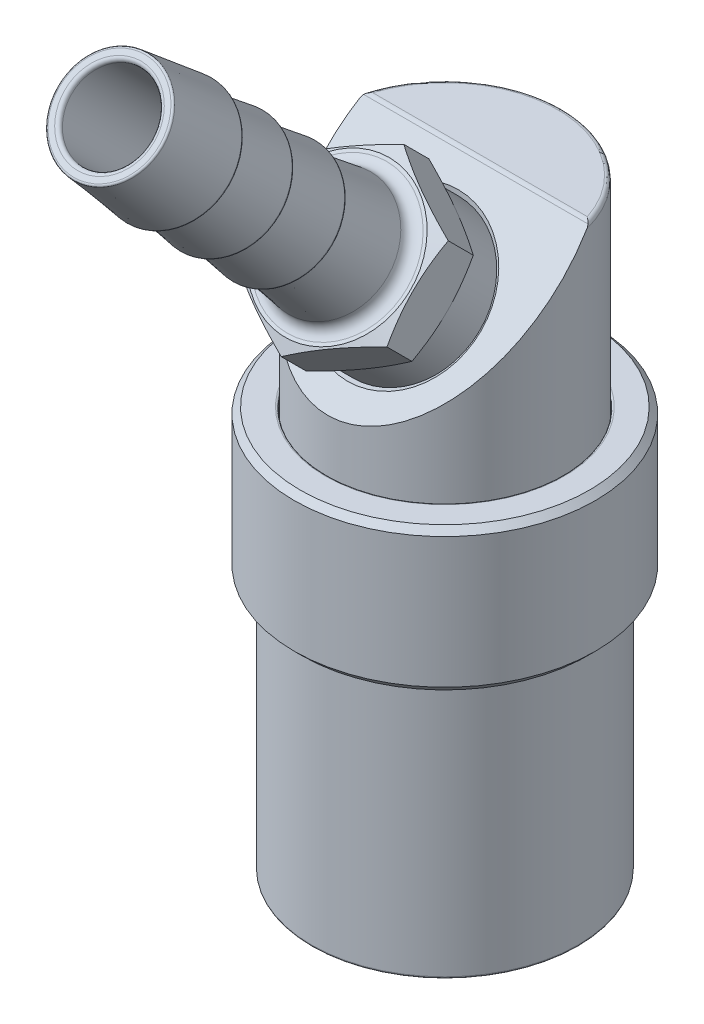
ISO-10303-21;
HEADER;
FILE_DESCRIPTION(('STEP AP214'),'2;1');
FILE_NAME('part.step','',(''),(''),'','','');
FILE_SCHEMA(('AUTOMOTIVE_DESIGN { 1 0 10303 214 1 1 1 1 }'));
ENDSEC;
DATA;
#1=APPLICATION_CONTEXT('core data for automotive mechanical design processes');
#2=APPLICATION_PROTOCOL_DEFINITION('international standard','automotive_design',2000,#1);
#3=PRODUCT_CONTEXT('',#1,'mechanical');
#4=PRODUCT('Part','Part','',(#3));
#5=PRODUCT_RELATED_PRODUCT_CATEGORY('part','',(#4));
#6=PRODUCT_DEFINITION_FORMATION('','',#4);
#7=PRODUCT_DEFINITION_CONTEXT('part definition',#1,'design');
#8=PRODUCT_DEFINITION('design','',#6,#7);
#9=PRODUCT_DEFINITION_SHAPE('','',#8);
#10=(LENGTH_UNIT() NAMED_UNIT(*) SI_UNIT(.MILLI.,.METRE.));
#11=(NAMED_UNIT(*) PLANE_ANGLE_UNIT() SI_UNIT($,.RADIAN.));
#12=(NAMED_UNIT(*) SI_UNIT($,.STERADIAN.) SOLID_ANGLE_UNIT());
#13=UNCERTAINTY_MEASURE_WITH_UNIT(LENGTH_MEASURE(1.E-05),#10,'distance_accuracy_value','');
#14=(GEOMETRIC_REPRESENTATION_CONTEXT(3) GLOBAL_UNCERTAINTY_ASSIGNED_CONTEXT((#13)) GLOBAL_UNIT_ASSIGNED_CONTEXT((#10,
#11,#12)) REPRESENTATION_CONTEXT('',''));
#15=CARTESIAN_POINT('',(0.,0.,0.));
#16=DIRECTION('',(0.,0.,1.));
#17=DIRECTION('',(1.,0.,0.));
#18=AXIS2_PLACEMENT_3D('',#15,#16,#17);
#19=CARTESIAN_POINT('',(0.,38.078985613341,7.35332790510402));
#20=DIRECTION('',(0.,-0.707106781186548,-0.707106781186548));
#21=DIRECTION('',(0.,0.707106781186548,-0.707106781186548));
#22=AXIS2_PLACEMENT_3D('',#19,#20,#21);
#23=TOROIDAL_SURFACE('',#22,4.44120276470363,0.762);
#24=CARTESIAN_POINT('',(0.,38.0225817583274,7.29692405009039));
#25=DIRECTION('',(0.,-0.707106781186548,-0.707106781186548));
#26=DIRECTION('',(0.,-0.707106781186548,0.707106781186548));
#27=AXIS2_PLACEMENT_3D('',#24,#25,#26);
#28=CIRCLE('',#27,3.68338932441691);
#29=CARTESIAN_POINT('',(0.,40.6271313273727,4.69237448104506));
#30=VERTEX_POINT('',#29);
#31=CARTESIAN_POINT('',(0.,35.4180321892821,9.90147361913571));
#32=VERTEX_POINT('',#31);
#33=EDGE_CURVE('P0_E11',#30,#32,#28,.T.);
#34=ORIENTED_EDGE('',*,*,#33,.T.);
#35=CARTESIAN_POINT('',(0.,34.9385810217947,10.4937324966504));
#36=DIRECTION('',(-1.,0.,0.));
#37=DIRECTION('',(0.,-0.707106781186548,0.707106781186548));
#38=AXIS2_PLACEMENT_3D('',#35,#36,#37);
#39=CIRCLE('',#38,0.762);
#40=CARTESIAN_POINT('',(0.,34.3997656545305,9.95491712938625));
#41=VERTEX_POINT('',#40);
#42=EDGE_CURVE('P0_E27',#32,#41,#39,.T.);
#43=ORIENTED_EDGE('',*,*,#42,.T.);
#44=CARTESIAN_POINT('',(0.,37.5401702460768,6.81451253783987));
#45=DIRECTION('',(0.,0.707106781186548,0.707106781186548));
#46=DIRECTION('',(0.,-0.707106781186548,0.707106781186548));
#47=AXIS2_PLACEMENT_3D('',#44,#45,#46);
#48=CIRCLE('',#47,4.44120276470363);
#49=CARTESIAN_POINT('',(0.,40.6805748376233,3.67410794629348));
#50=VERTEX_POINT('',#49);
#51=EDGE_CURVE('P0_E261',#41,#50,#48,.T.);
#52=ORIENTED_EDGE('',*,*,#51,.T.);
#53=CARTESIAN_POINT('',(0.,37.5401702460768,6.81451253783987));
#54=DIRECTION('',(0.,0.707106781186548,0.707106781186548));
#55=DIRECTION('',(0.,-0.707106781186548,0.707106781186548));
#56=AXIS2_PLACEMENT_3D('',#53,#54,#55);
#57=CIRCLE('',#56,4.44120276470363);
#58=EDGE_CURVE('P0_E264',#50,#41,#57,.T.);
#59=ORIENTED_EDGE('',*,*,#58,.T.);
#60=ORIENTED_EDGE('',*,*,#42,.F.);
#61=CARTESIAN_POINT('',(0.,38.0225817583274,7.29692405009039));
#62=DIRECTION('',(0.,-0.707106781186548,-0.707106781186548));
#63=DIRECTION('',(0.,-0.707106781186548,0.707106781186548));
#64=AXIS2_PLACEMENT_3D('',#61,#62,#63);
#65=CIRCLE('',#64,3.68338932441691);
#66=EDGE_CURVE('P0_E41',#32,#30,#65,.T.);
#67=ORIENTED_EDGE('',*,*,#66,.T.);
#68=EDGE_LOOP('',(#34,#43,#52,#59,#60,#67));
#69=FACE_BOUND('',#68,.T.);
#70=ADVANCED_FACE('P0_F16',(#69),#23,.F.);
#71=CARTESIAN_POINT('',(0.,41.7608906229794,2.59379216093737));
#72=DIRECTION('',(0.,0.707106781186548,0.707106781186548));
#73=DIRECTION('',(1.,0.,0.));
#74=AXIS2_PLACEMENT_3D('',#71,#72,#73);
#75=PLANE('',#74);
#76=CARTESIAN_POINT('',(0.,37.5401702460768,6.81451253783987));
#77=DIRECTION('',(0.,-0.707106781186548,-0.707106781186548));
#78=DIRECTION('',(0.,-0.707106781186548,0.707106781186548));
#79=AXIS2_PLACEMENT_3D('',#76,#77,#78);
#80=CIRCLE('',#79,4.64917728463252);
#81=CARTESIAN_POINT('',(0.,40.827635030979,3.52704775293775));
#82=VERTEX_POINT('',#81);
#83=EDGE_CURVE('P0_E364',#82,#82,#80,.T.);
#84=ORIENTED_EDGE('',*,*,#83,.F.);
#85=EDGE_LOOP('',(#84));
#86=FACE_BOUND('',#85,.T.);
#87=ORIENTED_EDGE('',*,*,#58,.F.);
#88=ORIENTED_EDGE('',*,*,#51,.F.);
#89=EDGE_LOOP('',(#87,#88));
#90=FACE_BOUND('',#89,.T.);
#91=ADVANCED_FACE('P0_F578',(#86,#90),#75,.T.);
#92=CARTESIAN_POINT('',(0.,39.4889909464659,8.76333323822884));
#93=DIRECTION('',(0.,-0.707106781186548,-0.707106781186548));
#94=DIRECTION('',(0.,0.707106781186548,-0.707106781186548));
#95=AXIS2_PLACEMENT_3D('',#92,#93,#94);
#96=CONICAL_SURFACE('',#95,3.46510042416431,0.104873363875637);
#97=ORIENTED_EDGE('',*,*,#33,.F.);
#98=ORIENTED_EDGE('',*,*,#66,.F.);
#99=DIRECTION('',(0.,0.777242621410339,0.629201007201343));
#100=VECTOR('',#99,1.);
#101=CARTESIAN_POINT('',(0.,37.0387949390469,11.2135292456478));
#102=LINE('',#101,#100);
#103=CARTESIAN_POINT('',(0.,39.1927476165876,12.9572179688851));
#104=VERTEX_POINT('',#103);
#105=EDGE_CURVE('P0_E423',#32,#104,#102,.T.);
#106=ORIENTED_EDGE('',*,*,#105,.T.);
#107=CARTESIAN_POINT('',(0.,41.4378116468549,10.7121539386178));
#108=DIRECTION('',(0.,-0.707106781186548,-0.707106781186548));
#109=DIRECTION('',(1.,0.,0.));
#110=AXIS2_PLACEMENT_3D('',#107,#108,#109);
#111=CIRCLE('',#110,3.175);
#112=CARTESIAN_POINT('',(0.,43.6828756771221,8.46708990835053));
#113=VERTEX_POINT('',#112);
#114=EDGE_CURVE('P0_E429',#104,#113,#111,.T.);
#115=ORIENTED_EDGE('',*,*,#114,.T.);
#116=CARTESIAN_POINT('',(0.,41.4378116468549,10.7121539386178));
#117=DIRECTION('',(0.,-0.707106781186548,-0.707106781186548));
#118=DIRECTION('',(1.,0.,0.));
#119=AXIS2_PLACEMENT_3D('',#116,#117,#118);
#120=CIRCLE('',#119,3.175);
#121=EDGE_CURVE('P0_E20',#113,#104,#120,.T.);
#122=ORIENTED_EDGE('',*,*,#121,.T.);
#123=ORIENTED_EDGE('',*,*,#105,.F.);
#124=EDGE_LOOP('',(#97,#98,#106,#115,#122,#123));
#125=FACE_BOUND('',#124,.T.);
#126=ADVANCED_FACE('P0_F583',(#125),#96,.T.);
#127=CARTESIAN_POINT('',(0.,51.7649263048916,21.0392685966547));
#128=DIRECTION('',(0.,-0.707106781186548,-0.707106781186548));
#129=DIRECTION('',(0.,0.707106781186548,-0.707106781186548));
#130=AXIS2_PLACEMENT_3D('',#127,#128,#129);
#131=TOROIDAL_SURFACE('',#130,2.8321,0.254);
#132=CARTESIAN_POINT('',(0.,51.944531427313,21.218873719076));
#133=DIRECTION('',(0.,0.707106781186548,0.707106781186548));
#134=DIRECTION('',(0.,-0.707106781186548,0.707106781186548));
#135=AXIS2_PLACEMENT_3D('',#132,#133,#134);
#136=CIRCLE('',#135,2.8321);
#137=CARTESIAN_POINT('',(0.,53.9471285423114,19.2162766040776));
#138=VERTEX_POINT('',#137);
#139=CARTESIAN_POINT('',(0.,49.9419343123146,23.2214708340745));
#140=VERTEX_POINT('',#139);
#141=EDGE_CURVE('P0_E403',#138,#140,#136,.T.);
#142=ORIENTED_EDGE('',*,*,#141,.T.);
#143=CARTESIAN_POINT('',(0.,49.7623291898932,23.041865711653));
#144=DIRECTION('',(-1.,0.,0.));
#145=DIRECTION('',(0.,-0.707106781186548,0.707106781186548));
#146=AXIS2_PLACEMENT_3D('',#143,#144,#145);
#147=CIRCLE('',#146,0.254);
#148=CARTESIAN_POINT('',(0.,49.9419343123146,22.8622605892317));
#149=VERTEX_POINT('',#148);
#150=EDGE_CURVE('P0_E397',#140,#149,#147,.T.);
#151=ORIENTED_EDGE('',*,*,#150,.T.);
#152=CARTESIAN_POINT('',(0.,51.7649263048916,21.0392685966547));
#153=DIRECTION('',(0.,-0.707106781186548,-0.707106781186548));
#154=DIRECTION('',(0.,-0.707106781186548,0.707106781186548));
#155=AXIS2_PLACEMENT_3D('',#152,#153,#154);
#156=CIRCLE('',#155,2.5781);
#157=CARTESIAN_POINT('',(0.,53.5879182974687,19.2162766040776));
#158=VERTEX_POINT('',#157);
#159=EDGE_CURVE('P0_E391',#149,#158,#156,.T.);
#160=ORIENTED_EDGE('',*,*,#159,.T.);
#161=CARTESIAN_POINT('',(0.,51.7649263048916,21.0392685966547));
#162=DIRECTION('',(0.,-0.707106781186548,-0.707106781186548));
#163=DIRECTION('',(0.,-0.707106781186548,0.707106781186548));
#164=AXIS2_PLACEMENT_3D('',#161,#162,#163);
#165=CIRCLE('',#164,2.5781);
#166=EDGE_CURVE('P0_E398',#158,#149,#165,.T.);
#167=ORIENTED_EDGE('',*,*,#166,.T.);
#168=ORIENTED_EDGE('',*,*,#150,.F.);
#169=CARTESIAN_POINT('',(0.,51.944531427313,21.218873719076));
#170=DIRECTION('',(0.,0.707106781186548,0.707106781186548));
#171=DIRECTION('',(0.,-0.707106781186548,0.707106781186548));
#172=AXIS2_PLACEMENT_3D('',#169,#170,#171);
#173=CIRCLE('',#172,2.8321);
#174=EDGE_CURVE('P0_E483',#140,#138,#173,.T.);
#175=ORIENTED_EDGE('',*,*,#174,.T.);
#176=EDGE_LOOP('',(#142,#151,#160,#167,#168,#175));
#177=FACE_BOUND('',#176,.T.);
#178=ADVANCED_FACE('P0_F615',(#177),#131,.T.);
#179=CARTESIAN_POINT('',(0.,41.3747548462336,10.6490971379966));
#180=DIRECTION('',(0.,-0.707106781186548,-0.707106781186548));
#181=DIRECTION('',(0.,0.707106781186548,-0.707106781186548));
#182=AXIS2_PLACEMENT_3D('',#179,#180,#181);
#183=CYLINDRICAL_SURFACE('',#182,2.5781);
#184=CARTESIAN_POINT('',(0.,30.9845832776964,0.258925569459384));
#185=DIRECTION('',(0.,0.707106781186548,0.707106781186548));
#186=DIRECTION('',(0.,-0.707106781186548,0.707106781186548));
#187=AXIS2_PLACEMENT_3D('',#184,#185,#186);
#188=CIRCLE('',#187,2.5781);
#189=CARTESIAN_POINT('',(0.,32.8075752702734,-1.56406642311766));
#190=VERTEX_POINT('',#189);
#191=CARTESIAN_POINT('',(0.,29.1615912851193,2.08191756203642));
#192=VERTEX_POINT('',#191);
#193=EDGE_CURVE('P0_E225',#190,#192,#188,.T.);
#194=ORIENTED_EDGE('',*,*,#193,.F.);
#195=CARTESIAN_POINT('',(0.,30.9845832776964,0.258925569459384));
#196=DIRECTION('',(0.,0.707106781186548,0.707106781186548));
#197=DIRECTION('',(0.,-0.707106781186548,0.707106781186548));
#198=AXIS2_PLACEMENT_3D('',#195,#196,#197);
#199=CIRCLE('',#198,2.5781);
#200=EDGE_CURVE('P0_E229',#192,#190,#199,.T.);
#201=ORIENTED_EDGE('',*,*,#200,.F.);
#202=DIRECTION('',(0.,0.707106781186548,0.707106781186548));
#203=VECTOR('',#202,1.);
#204=CARTESIAN_POINT('',(0.,39.5517628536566,12.4720891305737));
#205=LINE('',#204,#203);
#206=EDGE_CURVE('P0_E231',#192,#149,#205,.T.);
#207=ORIENTED_EDGE('',*,*,#206,.T.);
#208=ORIENTED_EDGE('',*,*,#166,.F.);
#209=ORIENTED_EDGE('',*,*,#159,.F.);
#210=ORIENTED_EDGE('',*,*,#206,.F.);
#211=EDGE_LOOP('',(#194,#201,#207,#208,#209,#210));
#212=FACE_BOUND('',#211,.T.);
#213=ADVANCED_FACE('P0_F227',(#212),#183,.F.);
#214=CARTESIAN_POINT('',(0.,54.2740517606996,18.8893533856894));
#215=DIRECTION('',(0.,0.707106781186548,0.707106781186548));
#216=DIRECTION('',(1.,0.,0.));
#217=AXIS2_PLACEMENT_3D('',#214,#215,#216);
#218=PLANE('',#217);
#219=CARTESIAN_POINT('',(0.,51.944531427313,21.218873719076));
#220=DIRECTION('',(0.,-0.707106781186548,-0.707106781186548));
#221=DIRECTION('',(0.,-0.707106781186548,0.707106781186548));
#222=AXIS2_PLACEMENT_3D('',#219,#220,#221);
#223=CIRCLE('',#222,3.17806519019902);
#224=CARTESIAN_POINT('',(0.,54.1917628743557,18.9716422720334));
#225=VERTEX_POINT('',#224);
#226=CARTESIAN_POINT('',(0.,49.6972999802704,23.4661051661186));
#227=VERTEX_POINT('',#226);
#228=EDGE_CURVE('P0_E281',#225,#227,#223,.T.);
#229=ORIENTED_EDGE('',*,*,#228,.F.);
#230=CARTESIAN_POINT('',(0.,51.944531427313,21.218873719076));
#231=DIRECTION('',(0.,-0.707106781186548,-0.707106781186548));
#232=DIRECTION('',(0.,-0.707106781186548,0.707106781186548));
#233=AXIS2_PLACEMENT_3D('',#230,#231,#232);
#234=CIRCLE('',#233,3.17806519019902);
#235=EDGE_CURVE('P0_E286',#227,#225,#234,.T.);
#236=ORIENTED_EDGE('',*,*,#235,.F.);
#237=EDGE_LOOP('',(#229,#236));
#238=FACE_BOUND('',#237,.T.);
#239=ORIENTED_EDGE('',*,*,#141,.F.);
#240=ORIENTED_EDGE('',*,*,#174,.F.);
#241=EDGE_LOOP('',(#239,#240));
#242=FACE_BOUND('',#241,.T.);
#243=ADVANCED_FACE('P0_F573',(#238,#242),#218,.T.);
#244=CARTESIAN_POINT('',(0.,30.9845832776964,0.258925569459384));
#245=DIRECTION('',(0.,-0.707106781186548,-0.707106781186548));
#246=DIRECTION('',(0.,0.707106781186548,-0.707106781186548));
#247=AXIS2_PLACEMENT_3D('',#244,#245,#246);
#248=TOROIDAL_SURFACE('',#247,2.8321,0.254);
#249=ORIENTED_EDGE('',*,*,#193,.T.);
#250=CARTESIAN_POINT('',(0.,28.981986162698,2.2615226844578));
#251=DIRECTION('',(-1.,0.,0.));
#252=DIRECTION('',(0.,-0.707106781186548,0.707106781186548));
#253=AXIS2_PLACEMENT_3D('',#250,#251,#252);
#254=CIRCLE('',#253,0.254);
#255=CARTESIAN_POINT('',(0.,28.8023810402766,2.08191756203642));
#256=VERTEX_POINT('',#255);
#257=EDGE_CURVE('P0_E236',#192,#256,#254,.T.);
#258=ORIENTED_EDGE('',*,*,#257,.T.);
#259=CARTESIAN_POINT('',(0.,30.804978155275,0.0793204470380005));
#260=DIRECTION('',(0.,-0.707106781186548,-0.707106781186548));
#261=DIRECTION('',(0.,-0.707106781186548,0.707106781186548));
#262=AXIS2_PLACEMENT_3D('',#259,#260,#261);
#263=CIRCLE('',#262,2.8321);
#264=CARTESIAN_POINT('',(0.,32.8075752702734,-1.92327666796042));
#265=VERTEX_POINT('',#264);
#266=EDGE_CURVE('P0_E248',#256,#265,#263,.T.);
#267=ORIENTED_EDGE('',*,*,#266,.T.);
#268=CARTESIAN_POINT('',(0.,30.804978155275,0.0793204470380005));
#269=DIRECTION('',(0.,-0.707106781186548,-0.707106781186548));
#270=DIRECTION('',(0.,-0.707106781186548,0.707106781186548));
#271=AXIS2_PLACEMENT_3D('',#268,#269,#270);
#272=CIRCLE('',#271,2.8321);
#273=EDGE_CURVE('P0_E241',#265,#256,#272,.T.);
#274=ORIENTED_EDGE('',*,*,#273,.T.);
#275=ORIENTED_EDGE('',*,*,#257,.F.);
#276=ORIENTED_EDGE('',*,*,#200,.T.);
#277=EDGE_LOOP('',(#249,#258,#267,#274,#275,#276));
#278=FACE_BOUND('',#277,.T.);
#279=ADVANCED_FACE('P0_F238',(#278),#248,.T.);
#280=CARTESIAN_POINT('',(0.,32.627970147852,-1.74367154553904));
#281=DIRECTION('',(0.,-0.707106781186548,-0.707106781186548));
#282=DIRECTION('',(0.,0.707106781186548,-0.707106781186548));
#283=AXIS2_PLACEMENT_3D('',#280,#281,#282);
#284=PLANE('',#283);
#285=CARTESIAN_POINT('',(0.,30.804978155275,0.0793204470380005));
#286=DIRECTION('',(0.,0.707106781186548,0.707106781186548));
#287=DIRECTION('',(0.,-0.707106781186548,0.707106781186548));
#288=AXIS2_PLACEMENT_3D('',#285,#286,#287);
#289=CIRCLE('',#288,3.937);
#290=CARTESIAN_POINT('',(0.,33.5888575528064,-2.70455895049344));
#291=VERTEX_POINT('',#290);
#292=EDGE_CURVE('P0_E269',#291,#291,#289,.T.);
#293=ORIENTED_EDGE('',*,*,#292,.F.);
#294=EDGE_LOOP('',(#293));
#295=FACE_BOUND('',#294,.T.);
#296=ORIENTED_EDGE('',*,*,#273,.F.);
#297=ORIENTED_EDGE('',*,*,#266,.F.);
#298=EDGE_LOOP('',(#296,#297));
#299=FACE_BOUND('',#298,.T.);
#300=ADVANCED_FACE('P0_F562',(#295,#299),#284,.T.);
#301=CARTESIAN_POINT('',(0.,41.5320334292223,10.8063757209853));
#302=DIRECTION('',(0.,-0.707106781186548,-0.707106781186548));
#303=DIRECTION('',(0.,0.707106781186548,-0.707106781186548));
#304=AXIS2_PLACEMENT_3D('',#301,#302,#303);
#305=TOROIDAL_SURFACE('',#304,3.52880393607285,0.127);
#306=CARTESIAN_POINT('',(0.,41.4422447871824,10.7165870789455));
#307=DIRECTION('',(0.,0.707106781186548,0.707106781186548));
#308=DIRECTION('',(0.,-0.707106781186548,0.707106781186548));
#309=AXIS2_PLACEMENT_3D('',#306,#307,#308);
#310=CIRCLE('',#309,3.53103989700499);
#311=CARTESIAN_POINT('',(0.,43.9390670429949,8.21976482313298));
#312=VERTEX_POINT('',#311);
#313=CARTESIAN_POINT('',(0.,38.94542253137,13.2134093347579));
#314=VERTEX_POINT('',#313);
#315=EDGE_CURVE('P0_E242',#312,#314,#310,.T.);
#316=ORIENTED_EDGE('',*,*,#315,.T.);
#317=CARTESIAN_POINT('',(0.,39.0367922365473,13.3016169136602));
#318=DIRECTION('',(-1.,0.,0.));
#319=DIRECTION('',(0.,-0.707106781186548,0.707106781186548));
#320=AXIS2_PLACEMENT_3D('',#317,#318,#319);
#321=CIRCLE('',#320,0.127);
#322=CARTESIAN_POINT('',(0.,38.9568837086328,13.4003267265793));
#323=VERTEX_POINT('',#322);
#324=EDGE_CURVE('P0_E252',#314,#323,#321,.T.);
#325=ORIENTED_EDGE('',*,*,#324,.T.);
#326=CARTESIAN_POINT('',(0.,41.5414340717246,10.8157763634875));
#327=DIRECTION('',(0.,-0.707106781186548,-0.707106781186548));
#328=DIRECTION('',(0.,-0.707106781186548,0.707106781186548));
#329=AXIS2_PLACEMENT_3D('',#326,#327,#328);
#330=CIRCLE('',#329,3.65510617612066);
#331=CARTESIAN_POINT('',(0.,44.1259844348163,8.2312260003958));
#332=VERTEX_POINT('',#331);
#333=EDGE_CURVE('P0_E285',#323,#332,#330,.T.);
#334=ORIENTED_EDGE('',*,*,#333,.T.);
#335=CARTESIAN_POINT('',(0.,41.5414340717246,10.8157763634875));
#336=DIRECTION('',(0.,-0.707106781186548,-0.707106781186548));
#337=DIRECTION('',(0.,-0.707106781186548,0.707106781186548));
#338=AXIS2_PLACEMENT_3D('',#335,#336,#337);
#339=CIRCLE('',#338,3.65510617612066);
#340=EDGE_CURVE('P0_E464',#332,#323,#339,.T.);
#341=ORIENTED_EDGE('',*,*,#340,.T.);
#342=ORIENTED_EDGE('',*,*,#324,.F.);
#343=CARTESIAN_POINT('',(0.,41.4422447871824,10.7165870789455));
#344=DIRECTION('',(0.,0.707106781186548,0.707106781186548));
#345=DIRECTION('',(0.,-0.707106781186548,0.707106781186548));
#346=AXIS2_PLACEMENT_3D('',#343,#344,#345);
#347=CIRCLE('',#346,3.53103989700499);
#348=EDGE_CURVE('P0_E457',#314,#312,#347,.T.);
#349=ORIENTED_EDGE('',*,*,#348,.T.);
#350=EDGE_LOOP('',(#316,#325,#334,#341,#342,#349));
#351=FACE_BOUND('',#350,.T.);
#352=ADVANCED_FACE('P0_F564',(#351),#305,.T.);
#353=CARTESIAN_POINT('',(0.,43.105317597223,12.379659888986));
#354=DIRECTION('',(0.,-0.707106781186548,-0.707106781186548));
#355=DIRECTION('',(0.,0.707106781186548,-0.707106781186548));
#356=AXIS2_PLACEMENT_3D('',#353,#354,#355);
#357=CONICAL_SURFACE('',#356,3.42230729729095,0.104873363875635);
#358=ORIENTED_EDGE('',*,*,#340,.F.);
#359=ORIENTED_EDGE('',*,*,#333,.F.);
#360=DIRECTION('',(0.,0.777242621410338,0.629201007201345));
#361=VECTOR('',#360,1.);
#362=CARTESIAN_POINT('',(0.,40.6853809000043,14.7995965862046));
#363=LINE('',#362,#361);
#364=CARTESIAN_POINT('',(0.,42.5216009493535,16.286071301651));
#365=VERTEX_POINT('',#364);
#366=EDGE_CURVE('P0_E402',#323,#365,#363,.T.);
#367=ORIENTED_EDGE('',*,*,#366,.T.);
#368=CARTESIAN_POINT('',(0.,44.7666649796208,14.0410072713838));
#369=DIRECTION('',(0.,-0.707106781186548,-0.707106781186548));
#370=DIRECTION('',(1.,0.,0.));
#371=AXIS2_PLACEMENT_3D('',#368,#369,#370);
#372=CIRCLE('',#371,3.175);
#373=CARTESIAN_POINT('',(0.,47.0117290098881,11.7959432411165));
#374=VERTEX_POINT('',#373);
#375=EDGE_CURVE('P0_E399',#365,#374,#372,.T.);
#376=ORIENTED_EDGE('',*,*,#375,.T.);
#377=CARTESIAN_POINT('',(0.,44.7666649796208,14.0410072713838));
#378=DIRECTION('',(0.,-0.707106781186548,-0.707106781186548));
#379=DIRECTION('',(1.,0.,0.));
#380=AXIS2_PLACEMENT_3D('',#377,#378,#379);
#381=CIRCLE('',#380,3.175);
#382=EDGE_CURVE('P0_E275',#374,#365,#381,.T.);
#383=ORIENTED_EDGE('',*,*,#382,.T.);
#384=ORIENTED_EDGE('',*,*,#366,.F.);
#385=EDGE_LOOP('',(#358,#359,#367,#376,#383,#384));
#386=FACE_BOUND('',#385,.T.);
#387=ADVANCED_FACE('P0_F571',(#386),#357,.T.);
#388=CARTESIAN_POINT('',(0.,41.44089093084,10.715233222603));
#389=DIRECTION('',(0.,0.707106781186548,0.707106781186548));
#390=DIRECTION('',(0.,0.707106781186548,-0.707106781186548));
#391=AXIS2_PLACEMENT_3D('',#388,#389,#390);
#392=CONICAL_SURFACE('',#391,3.42230729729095,1.55318942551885);
#393=ORIENTED_EDGE('',*,*,#121,.F.);
#394=ORIENTED_EDGE('',*,*,#114,.F.);
#395=DIRECTION('',(0.,-0.694547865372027,0.719446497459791));
#396=VECTOR('',#395,1.);
#397=CARTESIAN_POINT('',(0.,39.0209542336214,13.1351699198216));
#398=LINE('',#397,#396);
#399=EDGE_CURVE('P0_E271',#104,#314,#398,.T.);
#400=ORIENTED_EDGE('',*,*,#399,.T.);
#401=ORIENTED_EDGE('',*,*,#315,.F.);
#402=ORIENTED_EDGE('',*,*,#348,.F.);
#403=ORIENTED_EDGE('',*,*,#399,.F.);
#404=EDGE_LOOP('',(#393,#394,#400,#401,#402,#403));
#405=FACE_BOUND('',#404,.T.);
#406=ADVANCED_FACE('P0_F599',(#405),#392,.T.);
#407=CARTESIAN_POINT('',(0.,44.8521582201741,14.1265005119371));
#408=DIRECTION('',(0.,-0.707106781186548,-0.707106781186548));
#409=DIRECTION('',(0.,0.707106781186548,-0.707106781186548));
#410=AXIS2_PLACEMENT_3D('',#407,#408,#409);
#411=TOROIDAL_SURFACE('',#410,3.52828814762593,0.127);
#412=CARTESIAN_POINT('',(0.,44.7623691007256,14.0367113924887));
#413=DIRECTION('',(0.,0.707106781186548,0.707106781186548));
#414=DIRECTION('',(0.,-0.707106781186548,0.707106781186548));
#415=AXIS2_PLACEMENT_3D('',#412,#413,#414);
#416=CIRCLE('',#415,3.52609086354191);
#417=CARTESIAN_POINT('',(0.,47.2556918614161,11.5433886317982));
#418=VERTEX_POINT('',#417);
#419=CARTESIAN_POINT('',(0.,42.2690463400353,16.5300341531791));
#420=VERTEX_POINT('',#419);
#421=EDGE_CURVE('P0_E276',#418,#420,#416,.T.);
#422=ORIENTED_EDGE('',*,*,#421,.T.);
#423=CARTESIAN_POINT('',(0.,42.3572817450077,16.6213769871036));
#424=DIRECTION('',(-1.,0.,0.));
#425=DIRECTION('',(0.,-0.707106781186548,0.707106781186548));
#426=AXIS2_PLACEMENT_3D('',#423,#424,#425);
#427=CIRCLE('',#426,0.127);
#428=CARTESIAN_POINT('',(0.,42.2773732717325,16.7200868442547));
#429=VERTEX_POINT('',#428);
#430=EDGE_CURVE('P0_E294',#420,#429,#427,.T.);
#431=ORIENTED_EDGE('',*,*,#430,.T.);
#432=CARTESIAN_POINT('',(0.,44.8615589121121,14.1359012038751));
#433=DIRECTION('',(0.,-0.707106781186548,-0.707106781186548));
#434=DIRECTION('',(0.,-0.707106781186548,0.707106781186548));
#435=AXIS2_PLACEMENT_3D('',#432,#433,#434);
#436=CIRCLE('',#435,3.6545903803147);
#437=CARTESIAN_POINT('',(0.,47.4457445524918,11.5517155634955));
#438=VERTEX_POINT('',#437);
#439=EDGE_CURVE('P0_E413',#429,#438,#436,.T.);
#440=ORIENTED_EDGE('',*,*,#439,.T.);
#441=CARTESIAN_POINT('',(0.,44.8615589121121,14.1359012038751));
#442=DIRECTION('',(0.,-0.707106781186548,-0.707106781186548));
#443=DIRECTION('',(0.,-0.707106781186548,0.707106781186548));
#444=AXIS2_PLACEMENT_3D('',#441,#442,#443);
#445=CIRCLE('',#444,3.6545903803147);
#446=EDGE_CURVE('P0_E415',#438,#429,#445,.T.);
#447=ORIENTED_EDGE('',*,*,#446,.T.);
#448=ORIENTED_EDGE('',*,*,#430,.F.);
#449=CARTESIAN_POINT('',(0.,44.7623691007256,14.0367113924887));
#450=DIRECTION('',(0.,0.707106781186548,0.707106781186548));
#451=DIRECTION('',(0.,-0.707106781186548,0.707106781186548));
#452=AXIS2_PLACEMENT_3D('',#449,#450,#451);
#453=CIRCLE('',#452,3.52609086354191);
#454=EDGE_CURVE('P0_E553',#420,#418,#453,.T.);
#455=ORIENTED_EDGE('',*,*,#454,.T.);
#456=EDGE_LOOP('',(#422,#431,#440,#447,#448,#455));
#457=FACE_BOUND('',#456,.T.);
#458=ADVANCED_FACE('P0_F602',(#457),#411,.T.);
#459=CARTESIAN_POINT('',(0.,46.4219603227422,15.6963026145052));
#460=DIRECTION('',(0.,-0.707106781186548,-0.707106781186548));
#461=DIRECTION('',(0.,0.707106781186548,-0.707106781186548));
#462=AXIS2_PLACEMENT_3D('',#459,#460,#461);
#463=CONICAL_SURFACE('',#462,3.4223086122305,0.104873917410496);
#464=ORIENTED_EDGE('',*,*,#446,.F.);
#465=ORIENTED_EDGE('',*,*,#439,.F.);
#466=DIRECTION('',(0.,0.777242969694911,0.629200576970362));
#467=VECTOR('',#466,1.);
#468=CARTESIAN_POINT('',(0.,44.0020226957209,18.1162402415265));
#469=LINE('',#468,#467);
#470=CARTESIAN_POINT('',(0.,45.8382436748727,19.6027140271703));
#471=VERTEX_POINT('',#470);
#472=EDGE_CURVE('P0_E349',#429,#471,#469,.T.);
#473=ORIENTED_EDGE('',*,*,#472,.T.);
#474=CARTESIAN_POINT('',(0.,48.08330770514,17.357649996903));
#475=DIRECTION('',(0.,-0.707106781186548,-0.707106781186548));
#476=DIRECTION('',(1.,0.,0.));
#477=AXIS2_PLACEMENT_3D('',#474,#475,#476);
#478=CIRCLE('',#477,3.175);
#479=CARTESIAN_POINT('',(0.,50.3283717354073,15.1125859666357));
#480=VERTEX_POINT('',#479);
#481=EDGE_CURVE('P0_E304',#471,#480,#478,.T.);
#482=ORIENTED_EDGE('',*,*,#481,.T.);
#483=CARTESIAN_POINT('',(0.,48.08330770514,17.357649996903));
#484=DIRECTION('',(0.,-0.707106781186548,-0.707106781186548));
#485=DIRECTION('',(1.,0.,0.));
#486=AXIS2_PLACEMENT_3D('',#483,#484,#485);
#487=CIRCLE('',#486,3.175);
#488=EDGE_CURVE('P0_E299',#480,#471,#487,.T.);
#489=ORIENTED_EDGE('',*,*,#488,.T.);
#490=ORIENTED_EDGE('',*,*,#472,.F.);
#491=EDGE_LOOP('',(#464,#465,#473,#482,#489,#490));
#492=FACE_BOUND('',#491,.T.);
#493=ADVANCED_FACE('P0_F587',(#492),#463,.T.);
#494=CARTESIAN_POINT('',(0.,44.7636389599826,14.0379812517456));
#495=DIRECTION('',(0.,-0.707106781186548,-0.707106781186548));
#496=DIRECTION('',(0.,0.707106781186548,-0.707106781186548));
#497=AXIS2_PLACEMENT_3D('',#494,#495,#496);
#498=CONICAL_SURFACE('',#497,3.4223086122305,1.5534940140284);
#499=ORIENTED_EDGE('',*,*,#421,.F.);
#500=ORIENTED_EDGE('',*,*,#454,.F.);
#501=DIRECTION('',(0.,0.719234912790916,-0.694766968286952));
#502=VECTOR('',#501,1.);
#503=CARTESIAN_POINT('',(0.,42.3437013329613,16.457918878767));
#504=LINE('',#503,#502);
#505=EDGE_CURVE('P0_E295',#420,#365,#504,.T.);
#506=ORIENTED_EDGE('',*,*,#505,.T.);
#507=ORIENTED_EDGE('',*,*,#382,.F.);
#508=ORIENTED_EDGE('',*,*,#375,.F.);
#509=ORIENTED_EDGE('',*,*,#505,.F.);
#510=EDGE_LOOP('',(#499,#500,#506,#507,#508,#509));
#511=FACE_BOUND('',#510,.T.);
#512=ADVANCED_FACE('P0_F666',(#511),#498,.F.);
#513=CARTESIAN_POINT('',(0.,48.1731102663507,17.4474525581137));
#514=DIRECTION('',(0.,-0.707106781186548,-0.707106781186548));
#515=DIRECTION('',(0.,0.707106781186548,-0.707106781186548));
#516=AXIS2_PLACEMENT_3D('',#513,#514,#515);
#517=TOROIDAL_SURFACE('',#516,3.63358322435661,0.127);
#518=CARTESIAN_POINT('',(0.,48.08330770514,17.357649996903));
#519=DIRECTION('',(0.,0.707106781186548,0.707106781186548));
#520=DIRECTION('',(0.,-0.707106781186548,0.707106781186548));
#521=AXIS2_PLACEMENT_3D('',#518,#519,#520);
#522=CIRCLE('',#521,3.63358322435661);
#523=CARTESIAN_POINT('',(0.,50.6526390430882,14.7883186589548));
#524=VERTEX_POINT('',#523);
#525=CARTESIAN_POINT('',(0.,45.5139763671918,19.9269813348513));
#526=VERTEX_POINT('',#525);
#527=EDGE_CURVE('P0_E300',#524,#526,#522,.T.);
#528=ORIENTED_EDGE('',*,*,#527,.T.);
#529=CARTESIAN_POINT('',(0.,45.6037789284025,20.0167838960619));
#530=DIRECTION('',(-1.,0.,0.));
#531=DIRECTION('',(0.,-0.707106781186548,0.707106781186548));
#532=AXIS2_PLACEMENT_3D('',#529,#530,#531);
#533=CIRCLE('',#532,0.127);
#534=CARTESIAN_POINT('',(0.,45.5221449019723,20.1140715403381));
#535=VERTEX_POINT('',#534);
#536=EDGE_CURVE('P0_E319',#526,#535,#533,.T.);
#537=ORIENTED_EDGE('',*,*,#536,.T.);
#538=CARTESIAN_POINT('',(0.,48.1809370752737,17.4552793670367));
#539=DIRECTION('',(0.,-0.707106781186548,-0.707106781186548));
#540=DIRECTION('',(0.,-0.707106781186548,0.707106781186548));
#541=AXIS2_PLACEMENT_3D('',#538,#539,#540);
#542=CIRCLE('',#541,3.76009995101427);
#543=CARTESIAN_POINT('',(0.,50.8397292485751,14.7964871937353));
#544=VERTEX_POINT('',#543);
#545=EDGE_CURVE('P0_E313',#535,#544,#542,.T.);
#546=ORIENTED_EDGE('',*,*,#545,.T.);
#547=CARTESIAN_POINT('',(0.,48.1809370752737,17.4552793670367));
#548=DIRECTION('',(0.,-0.707106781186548,-0.707106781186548));
#549=DIRECTION('',(0.,-0.707106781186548,0.707106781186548));
#550=AXIS2_PLACEMENT_3D('',#547,#548,#549);
#551=CIRCLE('',#550,3.76009995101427);
#552=EDGE_CURVE('P0_E320',#544,#535,#551,.T.);
#553=ORIENTED_EDGE('',*,*,#552,.T.);
#554=ORIENTED_EDGE('',*,*,#536,.F.);
#555=CARTESIAN_POINT('',(0.,48.08330770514,17.357649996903));
#556=DIRECTION('',(0.,0.707106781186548,0.707106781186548));
#557=DIRECTION('',(0.,-0.707106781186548,0.707106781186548));
#558=AXIS2_PLACEMENT_3D('',#555,#556,#557);
#559=CIRCLE('',#558,3.63358322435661);
#560=EDGE_CURVE('P0_E327',#526,#524,#559,.T.);
#561=ORIENTED_EDGE('',*,*,#560,.T.);
#562=EDGE_LOOP('',(#528,#537,#546,#553,#554,#561));
#563=FACE_BOUND('',#562,.T.);
#564=ADVANCED_FACE('P0_F729',(#563),#517,.T.);
#565=CARTESIAN_POINT('',(0.,50.0139195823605,19.2882618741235));
#566=DIRECTION('',(0.,-0.707106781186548,-0.707106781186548));
#567=DIRECTION('',(0.,0.707106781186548,-0.707106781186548));
#568=AXIS2_PLACEMENT_3D('',#565,#566,#567);
#569=CONICAL_SURFACE('',#568,3.53330932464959,0.0872664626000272);
#570=ORIENTED_EDGE('',*,*,#552,.F.);
#571=ORIENTED_EDGE('',*,*,#545,.F.);
#572=DIRECTION('',(0.,0.766044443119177,0.642787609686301));
#573=VECTOR('',#572,1.);
#574=CARTESIAN_POINT('',(0.,47.5154925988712,21.7866888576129));
#575=LINE('',#574,#573);
#576=CARTESIAN_POINT('',(0.,49.5258633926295,23.4735902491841));
#577=VERTEX_POINT('',#576);
#578=EDGE_CURVE('P0_E372',#535,#577,#575,.T.);
#579=ORIENTED_EDGE('',*,*,#578,.T.);
#580=CARTESIAN_POINT('',(0.,51.8625556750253,21.1368979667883));
#581=DIRECTION('',(0.,0.707106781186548,0.707106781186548));
#582=DIRECTION('',(0.,-0.707106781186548,0.707106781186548));
#583=AXIS2_PLACEMENT_3D('',#580,#581,#582);
#584=CIRCLE('',#583,3.30458191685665);
#585=CARTESIAN_POINT('',(0.,54.1992479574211,18.8002056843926));
#586=VERTEX_POINT('',#585);
#587=EDGE_CURVE('P0_E382',#586,#577,#584,.T.);
#588=ORIENTED_EDGE('',*,*,#587,.F.);
#589=CARTESIAN_POINT('',(0.,51.8625556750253,21.1368979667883));
#590=DIRECTION('',(0.,0.707106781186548,0.707106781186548));
#591=DIRECTION('',(0.,-0.707106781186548,0.707106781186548));
#592=AXIS2_PLACEMENT_3D('',#589,#590,#591);
#593=CIRCLE('',#592,3.30458191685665);
#594=EDGE_CURVE('P0_E277',#577,#586,#593,.T.);
#595=ORIENTED_EDGE('',*,*,#594,.F.);
#596=ORIENTED_EDGE('',*,*,#578,.F.);
#597=EDGE_LOOP('',(#570,#571,#579,#588,#595,#596));
#598=FACE_BOUND('',#597,.T.);
#599=ADVANCED_FACE('P0_F720',(#598),#569,.T.);
#600=CARTESIAN_POINT('',(0.,50.3283717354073,15.1125859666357));
#601=DIRECTION('',(0.,-0.707106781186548,-0.707106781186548));
#602=DIRECTION('',(0.,0.707106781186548,-0.707106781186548));
#603=AXIS2_PLACEMENT_3D('',#600,#601,#602);
#604=PLANE('',#603);
#605=ORIENTED_EDGE('',*,*,#527,.F.);
#606=ORIENTED_EDGE('',*,*,#560,.F.);
#607=EDGE_LOOP('',(#605,#606));
#608=FACE_BOUND('',#607,.T.);
#609=ORIENTED_EDGE('',*,*,#488,.F.);
#610=ORIENTED_EDGE('',*,*,#481,.F.);
#611=EDGE_LOOP('',(#609,#610));
#612=FACE_BOUND('',#611,.T.);
#613=ADVANCED_FACE('P0_F619',(#608,#612),#604,.T.);
#614=CARTESIAN_POINT('',(0.,51.8547288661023,21.1290711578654));
#615=DIRECTION('',(0.,-0.707106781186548,-0.707106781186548));
#616=DIRECTION('',(0.,0.707106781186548,-0.707106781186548));
#617=AXIS2_PLACEMENT_3D('',#614,#615,#616);
#618=TOROIDAL_SURFACE('',#617,3.17806519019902,0.127);
#619=ORIENTED_EDGE('',*,*,#587,.T.);
#620=CARTESIAN_POINT('',(0.,49.6074974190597,23.3763026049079));
#621=DIRECTION('',(-1.,0.,0.));
#622=DIRECTION('',(0.,-0.707106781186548,0.707106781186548));
#623=AXIS2_PLACEMENT_3D('',#620,#621,#622);
#624=CIRCLE('',#623,0.127);
#625=EDGE_CURVE('P0_E290',#577,#227,#624,.T.);
#626=ORIENTED_EDGE('',*,*,#625,.T.);
#627=ORIENTED_EDGE('',*,*,#235,.T.);
#628=ORIENTED_EDGE('',*,*,#228,.T.);
#629=ORIENTED_EDGE('',*,*,#625,.F.);
#630=ORIENTED_EDGE('',*,*,#594,.T.);
#631=EDGE_LOOP('',(#619,#626,#627,#628,#629,#630));
#632=FACE_BOUND('',#631,.T.);
#633=ADVANCED_FACE('P0_F616',(#632),#618,.T.);
#634=CARTESIAN_POINT('',(0.,31.0743858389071,0.348728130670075));
#635=DIRECTION('',(0.,0.707106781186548,0.707106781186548));
#636=DIRECTION('',(0.,-0.707106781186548,0.707106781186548));
#637=AXIS2_PLACEMENT_3D('',#634,#635,#636);
#638=CONICAL_SURFACE('',#637,4.318,0.785398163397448);
#639=ORIENTED_EDGE('',*,*,#292,.T.);
#640=DIRECTION('',(0.,1.,0.));
#641=VECTOR('',#640,1.);
#642=CARTESIAN_POINT('',(0.,34.1276729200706,-2.70455895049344));
#643=LINE('',#642,#641);
#644=CARTESIAN_POINT('',(0.,34.67726459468,-2.70455895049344));
#645=VERTEX_POINT('',#644);
#646=EDGE_CURVE('P0_E265',#291,#645,#643,.T.);
#647=ORIENTED_EDGE('',*,*,#646,.T.);
#648=CARTESIAN_POINT('',(0.,31.3491816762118,0.623523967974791));
#649=DIRECTION('',(0.,-0.707106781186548,-0.707106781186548));
#650=DIRECTION('',(0.,0.707106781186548,-0.707106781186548));
#651=AXIS2_PLACEMENT_3D('',#648,#649,#650);
#652=CIRCLE('',#651,4.70662);
#653=CARTESIAN_POINT('',(0.,28.0210987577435,3.95160688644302));
#654=VERTEX_POINT('',#653);
#655=EDGE_CURVE('P0_E270',#645,#654,#652,.T.);
#656=ORIENTED_EDGE('',*,*,#655,.T.);
#657=CARTESIAN_POINT('',(0.,31.3491816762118,0.623523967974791));
#658=DIRECTION('',(0.,-0.707106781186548,-0.707106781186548));
#659=DIRECTION('',(0.,0.707106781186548,-0.707106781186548));
#660=AXIS2_PLACEMENT_3D('',#657,#658,#659);
#661=CIRCLE('',#660,4.70662);
#662=EDGE_CURVE('P0_E324',#654,#645,#661,.T.);
#663=ORIENTED_EDGE('',*,*,#662,.T.);
#664=ORIENTED_EDGE('',*,*,#646,.F.);
#665=EDGE_LOOP('',(#639,#647,#656,#663,#664));
#666=FACE_BOUND('',#665,.T.);
#667=ADVANCED_FACE('P0_F597',(#666),#638,.T.);
#668=CARTESIAN_POINT('',(0.,33.0500421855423,2.32438447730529));
#669=DIRECTION('',(0.,-0.707106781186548,-0.707106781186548));
#670=DIRECTION('',(0.,0.707106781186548,-0.707106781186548));
#671=AXIS2_PLACEMENT_3D('',#668,#669,#670);
#672=CYLINDRICAL_SURFACE('',#671,4.70662);
#673=ORIENTED_EDGE('',*,*,#662,.F.);
#674=DIRECTION('',(0.,0.707106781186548,0.707106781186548));
#675=VECTOR('',#674,1.);
#676=CARTESIAN_POINT('',(0.,29.721959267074,5.65246739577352));
#677=LINE('',#676,#675);
#678=CARTESIAN_POINT('',(0.,31.9701341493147,7.90064227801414));
#679=VERTEX_POINT('',#678);
#680=EDGE_CURVE('P0_E331',#654,#679,#677,.T.);
#681=ORIENTED_EDGE('',*,*,#680,.T.);
#682=CARTESIAN_POINT('',(0.,35.2982170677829,4.57255935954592));
#683=DIRECTION('',(0.,-0.707106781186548,-0.707106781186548));
#684=DIRECTION('',(0.,0.707106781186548,-0.707106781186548));
#685=AXIS2_PLACEMENT_3D('',#682,#683,#684);
#686=CIRCLE('',#685,4.70662);
#687=CARTESIAN_POINT('',(0.,38.6262999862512,1.24447644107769));
#688=VERTEX_POINT('',#687);
#689=EDGE_CURVE('P0_E339',#679,#688,#686,.T.);
#690=ORIENTED_EDGE('',*,*,#689,.T.);
#691=CARTESIAN_POINT('',(0.,35.2982170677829,4.57255935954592));
#692=DIRECTION('',(0.,-0.707106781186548,-0.707106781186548));
#693=DIRECTION('',(0.,0.707106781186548,-0.707106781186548));
#694=AXIS2_PLACEMENT_3D('',#691,#692,#693);
#695=CIRCLE('',#694,4.70662);
#696=EDGE_CURVE('P0_E346',#688,#679,#695,.T.);
#697=ORIENTED_EDGE('',*,*,#696,.T.);
#698=ORIENTED_EDGE('',*,*,#680,.F.);
#699=ORIENTED_EDGE('',*,*,#655,.F.);
#700=EDGE_LOOP('',(#673,#681,#690,#697,#698,#699));
#701=FACE_BOUND('',#700,.T.);
#702=ADVANCED_FACE('P0_F593',(#701),#672,.T.);
#703=CARTESIAN_POINT('',(0.,26.9267826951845,3.95751590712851));
#704=DIRECTION('',(0.5,0.612372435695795,-0.612372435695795));
#705=DIRECTION('',(0.,-0.707106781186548,-0.707106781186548));
#706=AXIS2_PLACEMENT_3D('',#703,#704,#705);
#707=PLANE('',#706);
#708=CARTESIAN_POINT('',(-4.7498,35.260014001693,8.41255175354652));
#709=CARTESIAN_POINT('',(-2.37489999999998,34.8502344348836,9.9418699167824));
#710=CARTESIAN_POINT('',(0.,33.3209162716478,10.3516494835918));
#711=(BOUNDED_CURVE() B_SPLINE_CURVE(2,(#708,#709,#710),.UNSPECIFIED.,.F.,
.F.) B_SPLINE_CURVE_WITH_KNOTS((3,3),(0.0756877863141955,0.66089469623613),
.UNSPECIFIED.) CURVE() GEOMETRIC_REPRESENTATION_ITEM() RATIONAL_B_SPLINE_CURVE((1.0473309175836,
1.20935357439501,1.0473309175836)) REPRESENTATION_ITEM(''));
#712=CARTESIAN_POINT('',(-4.7498,35.260014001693,8.41255175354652));
#713=VERTEX_POINT('',#712);
#714=CARTESIAN_POINT('',(0.,33.3209162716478,10.3516494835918));
#715=VERTEX_POINT('',#714);
#716=EDGE_CURVE('P0_E337',#713,#715,#711,.T.);
#717=ORIENTED_EDGE('',*,*,#716,.F.);
#718=DIRECTION('',(0.,0.707106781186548,0.707106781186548));
#719=VECTOR('',#718,1.);
#720=CARTESIAN_POINT('',(-4.7498,28.8658804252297,2.01841817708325));
#721=LINE('',#720,#719);
#722=CARTESIAN_POINT('',(-4.7498,33.6767269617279,6.82926471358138));
#723=VERTEX_POINT('',#722);
#724=EDGE_CURVE('P0_E440',#723,#713,#721,.T.);
#725=ORIENTED_EDGE('',*,*,#724,.F.);
#726=CARTESIAN_POINT('',(0.,31.7376292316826,8.76836244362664));
#727=CARTESIAN_POINT('',(-2.37490000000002,32.147408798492,7.23904428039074));
#728=CARTESIAN_POINT('',(-4.7498,33.6767269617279,6.82926471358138));
#729=(BOUNDED_CURVE() B_SPLINE_CURVE(2,(#726,#727,#728),.UNSPECIFIED.,.F.,
.F.) B_SPLINE_CURVE_WITH_KNOTS((3,3),(0.0756877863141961,0.660894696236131),
.UNSPECIFIED.) CURVE() GEOMETRIC_REPRESENTATION_ITEM() RATIONAL_B_SPLINE_CURVE((1.0473309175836,
1.20935357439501,1.0473309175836)) REPRESENTATION_ITEM(''));
#730=CARTESIAN_POINT('',(0.,31.7376292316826,8.76836244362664));
#731=VERTEX_POINT('',#730);
#732=EDGE_CURVE('P0_E305',#731,#723,#729,.T.);
#733=ORIENTED_EDGE('',*,*,#732,.F.);
#734=DIRECTION('',(0.,0.707106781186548,0.707106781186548));
#735=VECTOR('',#734,1.);
#736=CARTESIAN_POINT('',(0.,26.9267826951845,3.95751590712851));
#737=LINE('',#736,#735);
#738=EDGE_CURVE('P0_E381',#731,#715,#737,.T.);
#739=ORIENTED_EDGE('',*,*,#738,.T.);
#740=EDGE_LOOP('',(#717,#725,#733,#739));
#741=FACE_BOUND('',#740,.T.);
#742=ADVANCED_FACE('P0_F596',(#741),#707,.F.);
#743=CARTESIAN_POINT('',(4.7498,28.8658804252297,2.01841817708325));
#744=DIRECTION('',(-0.5,0.612372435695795,-0.612372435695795));
#745=DIRECTION('',(-0.866025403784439,-0.353553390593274,0.353553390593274));
#746=AXIS2_PLACEMENT_3D('',#743,#744,#745);
#747=PLANE('',#746);
#748=CARTESIAN_POINT('',(0.,33.3209162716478,10.3516494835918));
#749=CARTESIAN_POINT('',(2.37490000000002,34.8502344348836,9.94186991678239));
#750=CARTESIAN_POINT('',(4.7498,35.260014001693,8.41255175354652));
#751=(BOUNDED_CURVE() B_SPLINE_CURVE(2,(#748,#749,#750),.UNSPECIFIED.,.F.,
.F.) B_SPLINE_CURVE_WITH_KNOTS((3,3),(0.0756877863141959,0.66089469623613),
.UNSPECIFIED.) CURVE() GEOMETRIC_REPRESENTATION_ITEM() RATIONAL_B_SPLINE_CURVE((1.0473309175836,
1.20935357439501,1.0473309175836)) REPRESENTATION_ITEM(''));
#752=CARTESIAN_POINT('',(4.7498,35.260014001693,8.41255175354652));
#753=VERTEX_POINT('',#752);
#754=EDGE_CURVE('P0_E332',#715,#753,#751,.T.);
#755=ORIENTED_EDGE('',*,*,#754,.F.);
#756=ORIENTED_EDGE('',*,*,#738,.F.);
#757=CARTESIAN_POINT('',(4.7498,33.6767269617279,6.82926471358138));
#758=CARTESIAN_POINT('',(2.37489999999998,32.147408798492,7.23904428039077));
#759=CARTESIAN_POINT('',(0.,31.7376292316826,8.76836244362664));
#760=(BOUNDED_CURVE() B_SPLINE_CURVE(2,(#757,#758,#759),.UNSPECIFIED.,.F.,
.F.) B_SPLINE_CURVE_WITH_KNOTS((3,3),(0.0756877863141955,0.66089469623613),
.UNSPECIFIED.) CURVE() GEOMETRIC_REPRESENTATION_ITEM() RATIONAL_B_SPLINE_CURVE((1.0473309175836,
1.20935357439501,1.0473309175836)) REPRESENTATION_ITEM(''));
#761=CARTESIAN_POINT('',(4.7498,33.6767269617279,6.82926471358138));
#762=VERTEX_POINT('',#761);
#763=EDGE_CURVE('P0_E311',#762,#731,#760,.T.);
#764=ORIENTED_EDGE('',*,*,#763,.F.);
#765=DIRECTION('',(0.,0.707106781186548,0.707106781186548));
#766=VECTOR('',#765,1.);
#767=CARTESIAN_POINT('',(4.7498,28.8658804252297,2.01841817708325));
#768=LINE('',#767,#766);
#769=EDGE_CURVE('P0_E377',#762,#753,#768,.T.);
#770=ORIENTED_EDGE('',*,*,#769,.T.);
#771=EDGE_LOOP('',(#755,#756,#764,#770));
#772=FACE_BOUND('',#771,.T.);
#773=ADVANCED_FACE('P0_F608',(#772),#747,.F.);
#774=CARTESIAN_POINT('',(4.7498,32.7440758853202,-1.85977728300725));
#775=DIRECTION('',(-1.,0.,0.));
#776=DIRECTION('',(0.,0.707106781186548,0.707106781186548));
#777=AXIS2_PLACEMENT_3D('',#774,#775,#776);
#778=PLANE('',#777);
#779=CARTESIAN_POINT('',(4.7498,35.260014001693,8.41255175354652));
#780=CARTESIAN_POINT('',(4.7498,37.7588810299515,7.03322332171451));
#781=CARTESIAN_POINT('',(4.7498,39.1382094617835,4.53435629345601));
#782=(BOUNDED_CURVE() B_SPLINE_CURVE(2,(#779,#780,#781),.UNSPECIFIED.,.F.,
.F.) B_SPLINE_CURVE_WITH_KNOTS((3,3),(0.0756877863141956,0.66089469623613),
.UNSPECIFIED.) CURVE() GEOMETRIC_REPRESENTATION_ITEM() RATIONAL_B_SPLINE_CURVE((1.0473309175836,
1.20935357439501,1.0473309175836)) REPRESENTATION_ITEM(''));
#783=CARTESIAN_POINT('',(4.7498,39.1382094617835,4.53435629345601));
#784=VERTEX_POINT('',#783);
#785=EDGE_CURVE('P0_E338',#753,#784,#782,.T.);
#786=ORIENTED_EDGE('',*,*,#785,.F.);
#787=ORIENTED_EDGE('',*,*,#769,.F.);
#788=CARTESIAN_POINT('',(4.7498,37.5549224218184,2.95106925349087));
#789=CARTESIAN_POINT('',(4.7498,35.0560553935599,4.33039768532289));
#790=CARTESIAN_POINT('',(4.7498,33.6767269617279,6.82926471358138));
#791=(BOUNDED_CURVE() B_SPLINE_CURVE(2,(#788,#789,#790),.UNSPECIFIED.,.F.,
.F.) B_SPLINE_CURVE_WITH_KNOTS((3,3),(0.0756877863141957,0.660894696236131),
.UNSPECIFIED.) CURVE() GEOMETRIC_REPRESENTATION_ITEM() RATIONAL_B_SPLINE_CURVE((1.0473309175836,
1.20935357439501,1.0473309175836)) REPRESENTATION_ITEM(''));
#792=CARTESIAN_POINT('',(4.7498,37.5549224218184,2.95106925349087));
#793=VERTEX_POINT('',#792);
#794=EDGE_CURVE('P0_E505',#793,#762,#791,.T.);
#795=ORIENTED_EDGE('',*,*,#794,.F.);
#796=DIRECTION('',(0.,0.707106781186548,0.707106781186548));
#797=VECTOR('',#796,1.);
#798=CARTESIAN_POINT('',(4.7498,32.7440758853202,-1.85977728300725));
#799=LINE('',#798,#797);
#800=EDGE_CURVE('P0_E357',#793,#784,#799,.T.);
#801=ORIENTED_EDGE('',*,*,#800,.T.);
#802=EDGE_LOOP('',(#786,#787,#795,#801));
#803=FACE_BOUND('',#802,.T.);
#804=ADVANCED_FACE('P0_F604',(#803),#778,.F.);
#805=CARTESIAN_POINT('',(0.,34.6831736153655,-3.79887501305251));
#806=DIRECTION('',(-0.5,-0.612372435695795,0.612372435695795));
#807=DIRECTION('',(0.,0.707106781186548,0.707106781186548));
#808=AXIS2_PLACEMENT_3D('',#805,#806,#807);
#809=PLANE('',#808);
#810=CARTESIAN_POINT('',(4.7498,39.1382094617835,4.53435629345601));
#811=CARTESIAN_POINT('',(2.37489999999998,40.6675276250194,4.12457672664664));
#812=CARTESIAN_POINT('',(0.,41.0773071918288,2.59525856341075));
#813=(BOUNDED_CURVE() B_SPLINE_CURVE(2,(#810,#811,#812),.UNSPECIFIED.,.F.,
.F.) B_SPLINE_CURVE_WITH_KNOTS((3,3),(0.0756877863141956,0.66089469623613),
.UNSPECIFIED.) CURVE() GEOMETRIC_REPRESENTATION_ITEM() RATIONAL_B_SPLINE_CURVE((1.0473309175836,
1.20935357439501,1.0473309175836)) REPRESENTATION_ITEM(''));
#814=CARTESIAN_POINT('',(0.,41.0773071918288,2.59525856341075));
#815=VERTEX_POINT('',#814);
#816=EDGE_CURVE('P0_E435',#784,#815,#813,.T.);
#817=ORIENTED_EDGE('',*,*,#816,.F.);
#818=ORIENTED_EDGE('',*,*,#800,.F.);
#819=CARTESIAN_POINT('',(0.,39.4940201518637,1.01197152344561));
#820=CARTESIAN_POINT('',(2.37490000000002,37.9647019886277,1.421751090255));
#821=CARTESIAN_POINT('',(4.7498,37.5549224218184,2.95106925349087));
#822=(BOUNDED_CURVE() B_SPLINE_CURVE(2,(#819,#820,#821),.UNSPECIFIED.,.F.,
.F.) B_SPLINE_CURVE_WITH_KNOTS((3,3),(0.075687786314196,0.66089469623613),
.UNSPECIFIED.) CURVE() GEOMETRIC_REPRESENTATION_ITEM() RATIONAL_B_SPLINE_CURVE((1.0473309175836,
1.20935357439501,1.0473309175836)) REPRESENTATION_ITEM(''));
#823=CARTESIAN_POINT('',(0.,39.4940201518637,1.01197152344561));
#824=VERTEX_POINT('',#823);
#825=EDGE_CURVE('P0_E256',#824,#793,#822,.T.);
#826=ORIENTED_EDGE('',*,*,#825,.F.);
#827=DIRECTION('',(0.,0.707106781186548,0.707106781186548));
#828=VECTOR('',#827,1.);
#829=CARTESIAN_POINT('',(0.,34.6831736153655,-3.79887501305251));
#830=LINE('',#829,#828);
#831=EDGE_CURVE('P0_E353',#824,#815,#830,.T.);
#832=ORIENTED_EDGE('',*,*,#831,.T.);
#833=EDGE_LOOP('',(#817,#818,#826,#832));
#834=FACE_BOUND('',#833,.T.);
#835=ADVANCED_FACE('P0_F607',(#834),#809,.F.);
#836=CARTESIAN_POINT('',(-4.7498,32.7440758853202,-1.85977728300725));
#837=DIRECTION('',(0.5,-0.612372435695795,0.612372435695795));
#838=DIRECTION('',(0.,-0.707106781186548,-0.707106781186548));
#839=AXIS2_PLACEMENT_3D('',#836,#837,#838);
#840=PLANE('',#839);
#841=CARTESIAN_POINT('',(0.,41.0773071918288,2.59525856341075));
#842=CARTESIAN_POINT('',(-2.37490000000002,40.6675276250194,4.12457672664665));
#843=CARTESIAN_POINT('',(-4.7498,39.1382094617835,4.53435629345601));
#844=(BOUNDED_CURVE() B_SPLINE_CURVE(2,(#841,#842,#843),.UNSPECIFIED.,.F.,
.F.) B_SPLINE_CURVE_WITH_KNOTS((3,3),(0.0756877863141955,0.66089469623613),
.UNSPECIFIED.) CURVE() GEOMETRIC_REPRESENTATION_ITEM() RATIONAL_B_SPLINE_CURVE((1.0473309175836,
1.20935357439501,1.0473309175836)) REPRESENTATION_ITEM(''));
#845=CARTESIAN_POINT('',(-4.7498,39.1382094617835,4.53435629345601));
#846=VERTEX_POINT('',#845);
#847=EDGE_CURVE('P0_E359',#815,#846,#844,.T.);
#848=ORIENTED_EDGE('',*,*,#847,.F.);
#849=ORIENTED_EDGE('',*,*,#831,.F.);
#850=CARTESIAN_POINT('',(-4.7498,37.5549224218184,2.95106925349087));
#851=CARTESIAN_POINT('',(-2.37489999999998,37.9647019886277,1.42175109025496));
#852=CARTESIAN_POINT('',(0.,39.4940201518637,1.01197152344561));
#853=(BOUNDED_CURVE() B_SPLINE_CURVE(2,(#850,#851,#852),.UNSPECIFIED.,.F.,
.F.) B_SPLINE_CURVE_WITH_KNOTS((3,3),(0.0756877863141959,0.66089469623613),
.UNSPECIFIED.) CURVE() GEOMETRIC_REPRESENTATION_ITEM() RATIONAL_B_SPLINE_CURVE((1.0473309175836,
1.20935357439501,1.0473309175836)) REPRESENTATION_ITEM(''));
#854=CARTESIAN_POINT('',(-4.7498,37.5549224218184,2.95106925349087));
#855=VERTEX_POINT('',#854);
#856=EDGE_CURVE('P0_E451',#855,#824,#853,.T.);
#857=ORIENTED_EDGE('',*,*,#856,.F.);
#858=DIRECTION('',(0.,0.707106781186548,0.707106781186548));
#859=VECTOR('',#858,1.);
#860=CARTESIAN_POINT('',(-4.7498,32.7440758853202,-1.85977728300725));
#861=LINE('',#860,#859);
#862=EDGE_CURVE('P0_E358',#855,#846,#861,.T.);
#863=ORIENTED_EDGE('',*,*,#862,.T.);
#864=EDGE_LOOP('',(#848,#849,#857,#863));
#865=FACE_BOUND('',#864,.T.);
#866=ADVANCED_FACE('P0_F627',(#865),#840,.F.);
#867=CARTESIAN_POINT('',(-4.7498,28.8658804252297,2.01841817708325));
#868=DIRECTION('',(1.,0.,0.));
#869=DIRECTION('',(0.,0.707106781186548,0.707106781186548));
#870=AXIS2_PLACEMENT_3D('',#867,#868,#869);
#871=PLANE('',#870);
#872=CARTESIAN_POINT('',(-4.7498,39.1382094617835,4.53435629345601));
#873=CARTESIAN_POINT('',(-4.7498,37.7588810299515,7.03322332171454));
#874=CARTESIAN_POINT('',(-4.7498,35.260014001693,8.41255175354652));
#875=(BOUNDED_CURVE() B_SPLINE_CURVE(2,(#872,#873,#874),.UNSPECIFIED.,.F.,
.F.) B_SPLINE_CURVE_WITH_KNOTS((3,3),(0.0756877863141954,0.66089469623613),
.UNSPECIFIED.) CURVE() GEOMETRIC_REPRESENTATION_ITEM() RATIONAL_B_SPLINE_CURVE((1.0473309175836,
1.20935357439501,1.0473309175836)) REPRESENTATION_ITEM(''));
#876=EDGE_CURVE('P0_E365',#846,#713,#875,.T.);
#877=ORIENTED_EDGE('',*,*,#876,.F.);
#878=ORIENTED_EDGE('',*,*,#862,.F.);
#879=CARTESIAN_POINT('',(-4.7498,33.6767269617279,6.82926471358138));
#880=CARTESIAN_POINT('',(-4.7498,35.0560553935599,4.33039768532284));
#881=CARTESIAN_POINT('',(-4.7498,37.5549224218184,2.95106925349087));
#882=(BOUNDED_CURVE() B_SPLINE_CURVE(2,(#879,#880,#881),.UNSPECIFIED.,.F.,
.F.) B_SPLINE_CURVE_WITH_KNOTS((3,3),(0.0756877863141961,0.660894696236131),
.UNSPECIFIED.) CURVE() GEOMETRIC_REPRESENTATION_ITEM() RATIONAL_B_SPLINE_CURVE((1.0473309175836,
1.20935357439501,1.0473309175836)) REPRESENTATION_ITEM(''));
#883=EDGE_CURVE('P0_E312',#723,#855,#882,.T.);
#884=ORIENTED_EDGE('',*,*,#883,.F.);
#885=ORIENTED_EDGE('',*,*,#724,.T.);
#886=EDGE_LOOP('',(#877,#878,#884,#885));
#887=FACE_BOUND('',#886,.T.);
#888=ADVANCED_FACE('P0_F18',(#887),#871,.F.);
#889=CARTESIAN_POINT('',(0.,37.2707625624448,6.54510485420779));
#890=DIRECTION('',(0.,-0.707106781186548,-0.707106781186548));
#891=DIRECTION('',(0.,-0.707106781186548,0.707106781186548));
#892=AXIS2_PLACEMENT_3D('',#889,#890,#891);
#893=CONICAL_SURFACE('',#892,5.30908864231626,1.0471975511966);
#894=ORIENTED_EDGE('',*,*,#816,.T.);
#895=DIRECTION('',(0.,-0.258819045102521,0.965925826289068));
#896=VECTOR('',#895,1.);
#897=CARTESIAN_POINT('',(0.,41.0248551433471,2.79101227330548));
#898=LINE('',#897,#896);
#899=EDGE_CURVE('P0_E376',#815,#82,#898,.T.);
#900=ORIENTED_EDGE('',*,*,#899,.T.);
#901=ORIENTED_EDGE('',*,*,#83,.T.);
#902=ORIENTED_EDGE('',*,*,#899,.F.);
#903=ORIENTED_EDGE('',*,*,#847,.T.);
#904=ORIENTED_EDGE('',*,*,#876,.T.);
#905=ORIENTED_EDGE('',*,*,#716,.T.);
#906=ORIENTED_EDGE('',*,*,#754,.T.);
#907=ORIENTED_EDGE('',*,*,#785,.T.);
#908=EDGE_LOOP('',(#894,#900,#901,#902,#903,#904,#905,#906,#907));
#909=FACE_BOUND('',#908,.T.);
#910=ADVANCED_FACE('P0_F640',(#909),#893,.T.);
#911=CARTESIAN_POINT('',(0.,35.5543438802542,4.82868617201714));
#912=DIRECTION('',(0.,0.707106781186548,0.707106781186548));
#913=DIRECTION('',(0.,-0.707106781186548,0.707106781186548));
#914=AXIS2_PLACEMENT_3D('',#911,#912,#913);
#915=CONICAL_SURFACE('',#914,5.334,1.0471975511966);
#916=ORIENTED_EDGE('',*,*,#689,.F.);
#917=ORIENTED_EDGE('',*,*,#696,.F.);
#918=DIRECTION('',(0.,0.965925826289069,-0.258819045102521));
#919=VECTOR('',#918,1.);
#920=CARTESIAN_POINT('',(0.,39.3260514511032,1.05697860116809));
#921=LINE('',#920,#919);
#922=EDGE_CURVE('P0_E390',#688,#824,#921,.T.);
#923=ORIENTED_EDGE('',*,*,#922,.T.);
#924=ORIENTED_EDGE('',*,*,#825,.T.);
#925=ORIENTED_EDGE('',*,*,#794,.T.);
#926=ORIENTED_EDGE('',*,*,#763,.T.);
#927=ORIENTED_EDGE('',*,*,#732,.T.);
#928=ORIENTED_EDGE('',*,*,#883,.T.);
#929=ORIENTED_EDGE('',*,*,#856,.T.);
#930=ORIENTED_EDGE('',*,*,#922,.F.);
#931=EDGE_LOOP('',(#916,#917,#923,#924,#925,#926,#927,#928,#929,#930));
#932=FACE_BOUND('',#931,.T.);
#933=ADVANCED_FACE('P0_F645',(#932),#915,.T.);
#934=CLOSED_SHELL('',(#70,#91,#126,#178,#213,#243,#279,#300,#352,#387,#406,#458,#493,#512,#564,
#599,#613,#633,#667,#702,#742,#773,#804,#835,#866,#888,#910,#933));
#935=MANIFOLD_SOLID_BREP('P0_B1',#934);
#936=CARTESIAN_POINT('',(0.,25.2095,0.));
#937=DIRECTION('',(0.,-1.,0.));
#938=DIRECTION('',(0.,0.,-1.));
#939=AXIS2_PLACEMENT_3D('',#936,#937,#938);
#940=CONICAL_SURFACE('',#939,9.3345,0.785398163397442);
#941=CARTESIAN_POINT('',(0.,25.4,0.));
#942=DIRECTION('',(0.,-1.,0.));
#943=DIRECTION('',(0.,0.,-1.));
#944=AXIS2_PLACEMENT_3D('',#941,#942,#943);
#945=CIRCLE('',#944,9.144);
#946=CARTESIAN_POINT('',(0.,25.4,9.144));
#947=VERTEX_POINT('',#946);
#948=EDGE_CURVE('P1_E11',#947,#947,#945,.T.);
#949=ORIENTED_EDGE('',*,*,#948,.T.);
#950=DIRECTION('',(0.,-0.707106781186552,0.707106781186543));
#951=VECTOR('',#950,1.);
#952=CARTESIAN_POINT('',(0.,25.2095,9.3345));
#953=LINE('',#952,#951);
#954=CARTESIAN_POINT('',(0.,25.019,9.525));
#955=VERTEX_POINT('',#954);
#956=EDGE_CURVE('P1_E27',#947,#955,#953,.T.);
#957=ORIENTED_EDGE('',*,*,#956,.T.);
#958=CARTESIAN_POINT('',(0.,25.019,0.));
#959=DIRECTION('',(0.,1.,0.));
#960=DIRECTION('',(0.,0.,-1.));
#961=AXIS2_PLACEMENT_3D('',#958,#959,#960);
#962=CIRCLE('',#961,9.525);
#963=CARTESIAN_POINT('',(0.,25.019,-9.525));
#964=VERTEX_POINT('',#963);
#965=EDGE_CURVE('P1_E247',#955,#964,#962,.T.);
#966=ORIENTED_EDGE('',*,*,#965,.T.);
#967=CARTESIAN_POINT('',(0.,25.019,0.));
#968=DIRECTION('',(0.,1.,0.));
#969=DIRECTION('',(0.,0.,-1.));
#970=AXIS2_PLACEMENT_3D('',#967,#968,#969);
#971=CIRCLE('',#970,9.525);
#972=EDGE_CURVE('P1_E250',#964,#955,#971,.T.);
#973=ORIENTED_EDGE('',*,*,#972,.T.);
#974=ORIENTED_EDGE('',*,*,#956,.F.);
#975=EDGE_LOOP('',(#949,#957,#966,#973,#974));
#976=FACE_BOUND('',#975,.T.);
#977=ADVANCED_FACE('P1_F16',(#976),#940,.T.);
#978=CARTESIAN_POINT('',(0.,20.828,0.));
#979=DIRECTION('',(0.,1.,0.));
#980=DIRECTION('',(0.,0.,1.));
#981=AXIS2_PLACEMENT_3D('',#978,#979,#980);
#982=CYLINDRICAL_SURFACE('',#981,9.525);
#983=ORIENTED_EDGE('',*,*,#965,.F.);
#984=ORIENTED_EDGE('',*,*,#972,.F.);
#985=DIRECTION('',(0.,-1.,0.));
#986=VECTOR('',#985,1.);
#987=CARTESIAN_POINT('',(0.,20.828,-9.525));
#988=LINE('',#987,#986);
#989=CARTESIAN_POINT('',(0.,16.764,-9.525));
#990=VERTEX_POINT('',#989);
#991=EDGE_CURVE('P1_E259',#964,#990,#988,.T.);
#992=ORIENTED_EDGE('',*,*,#991,.T.);
#993=CARTESIAN_POINT('',(0.,16.764,0.));
#994=DIRECTION('',(0.,-1.,0.));
#995=DIRECTION('',(0.,0.,-1.));
#996=AXIS2_PLACEMENT_3D('',#993,#994,#995);
#997=CIRCLE('',#996,9.525);
#998=CARTESIAN_POINT('',(0.,16.764,9.525));
#999=VERTEX_POINT('',#998);
#1000=EDGE_CURVE('P1_E208',#999,#990,#997,.T.);
#1001=ORIENTED_EDGE('',*,*,#1000,.F.);
#1002=CARTESIAN_POINT('',(0.,16.764,0.));
#1003=DIRECTION('',(0.,-1.,0.));
#1004=DIRECTION('',(0.,0.,-1.));
#1005=AXIS2_PLACEMENT_3D('',#1002,#1003,#1004);
#1006=CIRCLE('',#1005,9.525);
#1007=EDGE_CURVE('P1_E211',#990,#999,#1006,.T.);
#1008=ORIENTED_EDGE('',*,*,#1007,.F.);
#1009=ORIENTED_EDGE('',*,*,#991,.F.);
#1010=EDGE_LOOP('',(#983,#984,#992,#1001,#1008,#1009));
#1011=FACE_BOUND('',#1010,.T.);
#1012=ADVANCED_FACE('P1_F359',(#1011),#982,.T.);
#1013=CARTESIAN_POINT('',(0.,25.4,7.4549));
#1014=DIRECTION('',(0.,1.,0.));
#1015=DIRECTION('',(1.,0.,0.));
#1016=AXIS2_PLACEMENT_3D('',#1013,#1014,#1015);
#1017=PLANE('',#1016);
#1018=ORIENTED_EDGE('',*,*,#948,.F.);
#1019=EDGE_LOOP('',(#1018));
#1020=FACE_BOUND('',#1019,.T.);
#1021=CARTESIAN_POINT('',(0.,25.4,0.));
#1022=DIRECTION('',(0.,1.,0.));
#1023=DIRECTION('',(0.,0.,-1.));
#1024=AXIS2_PLACEMENT_3D('',#1021,#1022,#1023);
#1025=CIRCLE('',#1024,7.5819);
#1026=CARTESIAN_POINT('',(0.,25.4,7.5819));
#1027=VERTEX_POINT('',#1026);
#1028=CARTESIAN_POINT('',(0.,25.4,-7.5819));
#1029=VERTEX_POINT('',#1028);
#1030=EDGE_CURVE('P1_E212',#1027,#1029,#1025,.T.);
#1031=ORIENTED_EDGE('',*,*,#1030,.F.);
#1032=CARTESIAN_POINT('',(0.,25.4,0.));
#1033=DIRECTION('',(0.,1.,0.));
#1034=DIRECTION('',(0.,0.,-1.));
#1035=AXIS2_PLACEMENT_3D('',#1032,#1033,#1034);
#1036=CIRCLE('',#1035,7.5819);
#1037=EDGE_CURVE('P1_E214',#1029,#1027,#1036,.T.);
#1038=ORIENTED_EDGE('',*,*,#1037,.F.);
#1039=EDGE_LOOP('',(#1031,#1038));
#1040=FACE_BOUND('',#1039,.T.);
#1041=ADVANCED_FACE('P1_F365',(#1020,#1040),#1017,.T.);
#1042=CARTESIAN_POINT('',(0.,6.096,0.));
#1043=DIRECTION('',(0.,1.,0.));
#1044=DIRECTION('',(0.,0.,1.));
#1045=AXIS2_PLACEMENT_3D('',#1042,#1043,#1044);
#1046=TOROIDAL_SURFACE('',#1045,6.6802,0.254);
#1047=CARTESIAN_POINT('',(0.,6.096,0.));
#1048=DIRECTION('',(0.,-1.,0.));
#1049=DIRECTION('',(0.,0.,-1.));
#1050=AXIS2_PLACEMENT_3D('',#1047,#1048,#1049);
#1051=CIRCLE('',#1050,6.4262);
#1052=CARTESIAN_POINT('',(0.,6.096,6.4262));
#1053=VERTEX_POINT('',#1052);
#1054=CARTESIAN_POINT('',(0.,6.096,-6.4262));
#1055=VERTEX_POINT('',#1054);
#1056=EDGE_CURVE('P1_E20',#1053,#1055,#1051,.T.);
#1057=ORIENTED_EDGE('',*,*,#1056,.T.);
#1058=CARTESIAN_POINT('',(0.,6.096,-6.6802));
#1059=DIRECTION('',(-1.,0.,0.));
#1060=DIRECTION('',(0.,0.,-1.));
#1061=AXIS2_PLACEMENT_3D('',#1058,#1059,#1060);
#1062=CIRCLE('',#1061,0.254);
#1063=CARTESIAN_POINT('',(0.,6.35,-6.6802));
#1064=VERTEX_POINT('',#1063);
#1065=EDGE_CURVE('P1_E268',#1055,#1064,#1062,.T.);
#1066=ORIENTED_EDGE('',*,*,#1065,.T.);
#1067=CARTESIAN_POINT('',(0.,6.35,0.));
#1068=DIRECTION('',(0.,1.,0.));
#1069=DIRECTION('',(0.,0.,-1.));
#1070=AXIS2_PLACEMENT_3D('',#1067,#1068,#1069);
#1071=CIRCLE('',#1070,6.6802);
#1072=CARTESIAN_POINT('',(0.,6.35,6.6802));
#1073=VERTEX_POINT('',#1072);
#1074=EDGE_CURVE('P1_E235',#1064,#1073,#1071,.T.);
#1075=ORIENTED_EDGE('',*,*,#1074,.T.);
#1076=CARTESIAN_POINT('',(0.,6.35,0.));
#1077=DIRECTION('',(0.,1.,0.));
#1078=DIRECTION('',(0.,0.,-1.));
#1079=AXIS2_PLACEMENT_3D('',#1076,#1077,#1078);
#1080=CIRCLE('',#1079,6.6802);
#1081=EDGE_CURVE('P1_E231',#1073,#1064,#1080,.T.);
#1082=ORIENTED_EDGE('',*,*,#1081,.T.);
#1083=ORIENTED_EDGE('',*,*,#1065,.F.);
#1084=CARTESIAN_POINT('',(0.,6.096,0.));
#1085=DIRECTION('',(0.,-1.,0.));
#1086=DIRECTION('',(0.,0.,-1.));
#1087=AXIS2_PLACEMENT_3D('',#1084,#1085,#1086);
#1088=CIRCLE('',#1087,6.4262);
#1089=EDGE_CURVE('P1_E228',#1055,#1053,#1088,.T.);
#1090=ORIENTED_EDGE('',*,*,#1089,.T.);
#1091=EDGE_LOOP('',(#1057,#1066,#1075,#1082,#1083,#1090));
#1092=FACE_BOUND('',#1091,.T.);
#1093=ADVANCED_FACE('P1_F376',(#1092),#1046,.T.);
#1094=CARTESIAN_POINT('',(0.,6.35,6.4262));
#1095=DIRECTION('',(0.,1.,0.));
#1096=DIRECTION('',(1.,0.,0.));
#1097=AXIS2_PLACEMENT_3D('',#1094,#1095,#1096);
#1098=PLANE('',#1097);
#1099=CARTESIAN_POINT('',(0.,6.35,0.));
#1100=DIRECTION('',(0.,-1.,0.));
#1101=DIRECTION('',(0.,0.,-1.));
#1102=AXIS2_PLACEMENT_3D('',#1099,#1100,#1101);
#1103=CIRCLE('',#1102,7.2009);
#1104=CARTESIAN_POINT('',(0.,6.35,7.2009));
#1105=VERTEX_POINT('',#1104);
#1106=CARTESIAN_POINT('',(0.,6.35,-7.2009));
#1107=VERTEX_POINT('',#1106);
#1108=EDGE_CURVE('P1_E224',#1105,#1107,#1103,.T.);
#1109=ORIENTED_EDGE('',*,*,#1108,.F.);
#1110=CARTESIAN_POINT('',(0.,6.35,0.));
#1111=DIRECTION('',(0.,-1.,0.));
#1112=DIRECTION('',(0.,0.,-1.));
#1113=AXIS2_PLACEMENT_3D('',#1110,#1111,#1112);
#1114=CIRCLE('',#1113,7.2009);
#1115=EDGE_CURVE('P1_E219',#1107,#1105,#1114,.T.);
#1116=ORIENTED_EDGE('',*,*,#1115,.F.);
#1117=EDGE_LOOP('',(#1109,#1116));
#1118=FACE_BOUND('',#1117,.T.);
#1119=ORIENTED_EDGE('',*,*,#1081,.F.);
#1120=ORIENTED_EDGE('',*,*,#1074,.F.);
#1121=EDGE_LOOP('',(#1119,#1120));
#1122=FACE_BOUND('',#1121,.T.);
#1123=ADVANCED_FACE('P1_F379',(#1118,#1122),#1098,.T.);
#1124=CARTESIAN_POINT('',(0.,4.1402,0.));
#1125=DIRECTION('',(0.,1.,0.));
#1126=DIRECTION('',(0.,0.,1.));
#1127=AXIS2_PLACEMENT_3D('',#1124,#1125,#1126);
#1128=CYLINDRICAL_SURFACE('',#1127,6.4262);
#1129=ORIENTED_EDGE('',*,*,#1056,.F.);
#1130=ORIENTED_EDGE('',*,*,#1089,.F.);
#1131=DIRECTION('',(0.,-1.,0.));
#1132=VECTOR('',#1131,1.);
#1133=CARTESIAN_POINT('',(0.,4.1402,-6.4262));
#1134=LINE('',#1133,#1132);
#1135=CARTESIAN_POINT('',(0.,1.9304,-6.4262));
#1136=VERTEX_POINT('',#1135);
#1137=EDGE_CURVE('P1_E225',#1055,#1136,#1134,.T.);
#1138=ORIENTED_EDGE('',*,*,#1137,.T.);
#1139=CARTESIAN_POINT('',(0.,1.9304,0.));
#1140=DIRECTION('',(0.,1.,0.));
#1141=DIRECTION('',(1.,0.,0.));
#1142=AXIS2_PLACEMENT_3D('',#1139,#1140,#1141);
#1143=CIRCLE('',#1142,6.4262);
#1144=CARTESIAN_POINT('',(0.,1.9304,6.4262));
#1145=VERTEX_POINT('',#1144);
#1146=EDGE_CURVE('P1_E255',#1145,#1136,#1143,.T.);
#1147=ORIENTED_EDGE('',*,*,#1146,.F.);
#1148=CARTESIAN_POINT('',(0.,1.9304,0.));
#1149=DIRECTION('',(0.,1.,0.));
#1150=DIRECTION('',(1.,0.,0.));
#1151=AXIS2_PLACEMENT_3D('',#1148,#1149,#1150);
#1152=CIRCLE('',#1151,6.4262);
#1153=EDGE_CURVE('P1_E256',#1136,#1145,#1152,.T.);
#1154=ORIENTED_EDGE('',*,*,#1153,.F.);
#1155=ORIENTED_EDGE('',*,*,#1137,.F.);
#1156=EDGE_LOOP('',(#1129,#1130,#1138,#1147,#1154,#1155));
#1157=FACE_BOUND('',#1156,.T.);
#1158=ADVANCED_FACE('P1_F369',(#1157),#1128,.F.);
#1159=CARTESIAN_POINT('',(0.,6.604,0.));
#1160=DIRECTION('',(0.,1.,0.));
#1161=DIRECTION('',(0.,0.,1.));
#1162=AXIS2_PLACEMENT_3D('',#1159,#1160,#1161);
#1163=TOROIDAL_SURFACE('',#1162,7.2009,0.254);
#1164=CARTESIAN_POINT('',(0.,6.604,0.));
#1165=DIRECTION('',(0.,1.,0.));
#1166=DIRECTION('',(0.,0.,-1.));
#1167=AXIS2_PLACEMENT_3D('',#1164,#1165,#1166);
#1168=CIRCLE('',#1167,7.4549);
#1169=CARTESIAN_POINT('',(0.,6.604,7.4549));
#1170=VERTEX_POINT('',#1169);
#1171=CARTESIAN_POINT('',(0.,6.604,-7.4549));
#1172=VERTEX_POINT('',#1171);
#1173=EDGE_CURVE('P1_E229',#1170,#1172,#1168,.T.);
#1174=ORIENTED_EDGE('',*,*,#1173,.T.);
#1175=CARTESIAN_POINT('',(0.,6.604,-7.2009));
#1176=DIRECTION('',(-1.,0.,0.));
#1177=DIRECTION('',(0.,0.,-1.));
#1178=AXIS2_PLACEMENT_3D('',#1175,#1176,#1177);
#1179=CIRCLE('',#1178,0.254);
#1180=EDGE_CURVE('P1_E223',#1172,#1107,#1179,.T.);
#1181=ORIENTED_EDGE('',*,*,#1180,.T.);
#1182=ORIENTED_EDGE('',*,*,#1115,.T.);
#1183=ORIENTED_EDGE('',*,*,#1108,.T.);
#1184=ORIENTED_EDGE('',*,*,#1180,.F.);
#1185=CARTESIAN_POINT('',(0.,6.604,0.));
#1186=DIRECTION('',(0.,1.,0.));
#1187=DIRECTION('',(0.,0.,-1.));
#1188=AXIS2_PLACEMENT_3D('',#1185,#1186,#1187);
#1189=CIRCLE('',#1188,7.4549);
#1190=EDGE_CURVE('P1_E265',#1172,#1170,#1189,.T.);
#1191=ORIENTED_EDGE('',*,*,#1190,.T.);
#1192=EDGE_LOOP('',(#1174,#1181,#1182,#1183,#1184,#1191));
#1193=FACE_BOUND('',#1192,.T.);
#1194=ADVANCED_FACE('P1_F381',(#1193),#1163,.F.);
#1195=CARTESIAN_POINT('',(0.,15.875,0.));
#1196=DIRECTION('',(0.,1.,0.));
#1197=DIRECTION('',(0.,0.,1.));
#1198=AXIS2_PLACEMENT_3D('',#1195,#1196,#1197);
#1199=CYLINDRICAL_SURFACE('',#1198,7.4549);
#1200=CARTESIAN_POINT('',(0.,25.273,0.));
#1201=DIRECTION('',(0.,-1.,0.));
#1202=DIRECTION('',(0.,0.,-1.));
#1203=AXIS2_PLACEMENT_3D('',#1200,#1201,#1202);
#1204=CIRCLE('',#1203,7.4549);
#1205=CARTESIAN_POINT('',(0.,25.273,7.4549));
#1206=VERTEX_POINT('',#1205);
#1207=CARTESIAN_POINT('',(0.,25.273,-7.4549));
#1208=VERTEX_POINT('',#1207);
#1209=EDGE_CURVE('P1_E195',#1206,#1208,#1204,.T.);
#1210=ORIENTED_EDGE('',*,*,#1209,.F.);
#1211=CARTESIAN_POINT('',(0.,25.273,0.));
#1212=DIRECTION('',(0.,-1.,0.));
#1213=DIRECTION('',(0.,0.,-1.));
#1214=AXIS2_PLACEMENT_3D('',#1211,#1212,#1213);
#1215=CIRCLE('',#1214,7.4549);
#1216=EDGE_CURVE('P1_E215',#1208,#1206,#1215,.T.);
#1217=ORIENTED_EDGE('',*,*,#1216,.F.);
#1218=DIRECTION('',(0.,-1.,0.));
#1219=VECTOR('',#1218,1.);
#1220=CARTESIAN_POINT('',(0.,15.875,-7.4549));
#1221=LINE('',#1220,#1219);
#1222=EDGE_CURVE('P1_E210',#1208,#1172,#1221,.T.);
#1223=ORIENTED_EDGE('',*,*,#1222,.T.);
#1224=ORIENTED_EDGE('',*,*,#1173,.F.);
#1225=ORIENTED_EDGE('',*,*,#1190,.F.);
#1226=ORIENTED_EDGE('',*,*,#1222,.F.);
#1227=EDGE_LOOP('',(#1210,#1217,#1223,#1224,#1225,#1226));
#1228=FACE_BOUND('',#1227,.T.);
#1229=ADVANCED_FACE('P1_F356',(#1228),#1199,.F.);
#1230=CARTESIAN_POINT('',(0.,16.51,0.));
#1231=DIRECTION('',(0.,1.,0.));
#1232=DIRECTION('',(0.,0.,-1.));
#1233=AXIS2_PLACEMENT_3D('',#1230,#1231,#1232);
#1234=CONICAL_SURFACE('',#1233,9.271,0.785398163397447);
#1235=ORIENTED_EDGE('',*,*,#1000,.T.);
#1236=ORIENTED_EDGE('',*,*,#1007,.T.);
#1237=DIRECTION('',(0.,-0.707106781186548,-0.707106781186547));
#1238=VECTOR('',#1237,1.);
#1239=CARTESIAN_POINT('',(0.,16.51,9.271));
#1240=LINE('',#1239,#1238);
#1241=CARTESIAN_POINT('',(0.,16.256,9.017));
#1242=VERTEX_POINT('',#1241);
#1243=EDGE_CURVE('P1_E240',#999,#1242,#1240,.T.);
#1244=ORIENTED_EDGE('',*,*,#1243,.T.);
#1245=CARTESIAN_POINT('',(0.,16.256,0.));
#1246=DIRECTION('',(0.,1.,0.));
#1247=DIRECTION('',(0.,0.,-1.));
#1248=AXIS2_PLACEMENT_3D('',#1245,#1246,#1247);
#1249=CIRCLE('',#1248,9.017);
#1250=EDGE_CURVE('P1_E206',#1242,#1242,#1249,.T.);
#1251=ORIENTED_EDGE('',*,*,#1250,.T.);
#1252=ORIENTED_EDGE('',*,*,#1243,.F.);
#1253=EDGE_LOOP('',(#1235,#1236,#1244,#1251,#1252));
#1254=FACE_BOUND('',#1253,.T.);
#1255=ADVANCED_FACE('P1_F345',(#1254),#1234,.T.);
#1256=CARTESIAN_POINT('',(0.,16.256,9.525));
#1257=DIRECTION('',(0.,-1.,0.));
#1258=DIRECTION('',(0.,0.,-1.));
#1259=AXIS2_PLACEMENT_3D('',#1256,#1257,#1258);
#1260=PLANE('',#1259);
#1261=ORIENTED_EDGE('',*,*,#1250,.F.);
#1262=EDGE_LOOP('',(#1261));
#1263=FACE_BOUND('',#1262,.T.);
#1264=CARTESIAN_POINT('',(0.,16.256,0.));
#1265=DIRECTION('',(0.,1.,0.));
#1266=DIRECTION('',(1.,0.,0.));
#1267=AXIS2_PLACEMENT_3D('',#1264,#1265,#1266);
#1268=CIRCLE('',#1267,8.4328);
#1269=CARTESIAN_POINT('',(0.,16.256,8.4328));
#1270=VERTEX_POINT('',#1269);
#1271=CARTESIAN_POINT('',(0.,16.256,-8.4328));
#1272=VERTEX_POINT('',#1271);
#1273=EDGE_CURVE('P1_E246',#1270,#1272,#1268,.T.);
#1274=ORIENTED_EDGE('',*,*,#1273,.T.);
#1275=CARTESIAN_POINT('',(0.,16.256,0.));
#1276=DIRECTION('',(0.,1.,0.));
#1277=DIRECTION('',(1.,0.,0.));
#1278=AXIS2_PLACEMENT_3D('',#1275,#1276,#1277);
#1279=CIRCLE('',#1278,8.4328);
#1280=EDGE_CURVE('P1_E190',#1272,#1270,#1279,.T.);
#1281=ORIENTED_EDGE('',*,*,#1280,.T.);
#1282=EDGE_LOOP('',(#1274,#1281));
#1283=FACE_BOUND('',#1282,.T.);
#1284=ADVANCED_FACE('P1_F347',(#1263,#1283),#1260,.T.);
#1285=CARTESIAN_POINT('',(0.,0.127,0.));
#1286=DIRECTION('',(0.,1.,0.));
#1287=DIRECTION('',(0.,0.,1.));
#1288=AXIS2_PLACEMENT_3D('',#1285,#1286,#1287);
#1289=TOROIDAL_SURFACE('',#1288,8.3058,0.127);
#1290=CARTESIAN_POINT('',(0.,0.127,0.));
#1291=DIRECTION('',(0.,-1.,0.));
#1292=DIRECTION('',(0.,0.,-1.));
#1293=AXIS2_PLACEMENT_3D('',#1290,#1291,#1292);
#1294=CIRCLE('',#1293,8.4328);
#1295=CARTESIAN_POINT('',(0.,0.127,8.4328));
#1296=VERTEX_POINT('',#1295);
#1297=CARTESIAN_POINT('',(0.,0.127,-8.4328));
#1298=VERTEX_POINT('',#1297);
#1299=EDGE_CURVE('P1_E176',#1296,#1298,#1294,.T.);
#1300=ORIENTED_EDGE('',*,*,#1299,.T.);
#1301=CARTESIAN_POINT('',(0.,0.127,-8.3058));
#1302=DIRECTION('',(-1.,0.,0.));
#1303=DIRECTION('',(0.,0.,-1.));
#1304=AXIS2_PLACEMENT_3D('',#1301,#1302,#1303);
#1305=CIRCLE('',#1304,0.127);
#1306=CARTESIAN_POINT('',(0.,0.,-8.3058));
#1307=VERTEX_POINT('',#1306);
#1308=EDGE_CURVE('P1_E183',#1298,#1307,#1305,.T.);
#1309=ORIENTED_EDGE('',*,*,#1308,.T.);
#1310=CARTESIAN_POINT('',(0.,0.,0.));
#1311=DIRECTION('',(0.,1.,0.));
#1312=DIRECTION('',(0.,0.,-1.));
#1313=AXIS2_PLACEMENT_3D('',#1310,#1311,#1312);
#1314=CIRCLE('',#1313,8.3058);
#1315=CARTESIAN_POINT('',(0.,0.,8.3058));
#1316=VERTEX_POINT('',#1315);
#1317=EDGE_CURVE('P1_E187',#1307,#1316,#1314,.T.);
#1318=ORIENTED_EDGE('',*,*,#1317,.T.);
#1319=CARTESIAN_POINT('',(0.,0.,0.));
#1320=DIRECTION('',(0.,1.,0.));
#1321=DIRECTION('',(0.,0.,-1.));
#1322=AXIS2_PLACEMENT_3D('',#1319,#1320,#1321);
#1323=CIRCLE('',#1322,8.3058);
#1324=EDGE_CURVE('P1_E179',#1316,#1307,#1323,.T.);
#1325=ORIENTED_EDGE('',*,*,#1324,.T.);
#1326=ORIENTED_EDGE('',*,*,#1308,.F.);
#1327=CARTESIAN_POINT('',(0.,0.127,0.));
#1328=DIRECTION('',(0.,-1.,0.));
#1329=DIRECTION('',(0.,0.,-1.));
#1330=AXIS2_PLACEMENT_3D('',#1327,#1328,#1329);
#1331=CIRCLE('',#1330,8.4328);
#1332=EDGE_CURVE('P1_E170',#1298,#1296,#1331,.T.);
#1333=ORIENTED_EDGE('',*,*,#1332,.T.);
#1334=EDGE_LOOP('',(#1300,#1309,#1318,#1325,#1326,#1333));
#1335=FACE_BOUND('',#1334,.T.);
#1336=ADVANCED_FACE('P1_F184',(#1335),#1289,.T.);
#1337=CARTESIAN_POINT('',(0.,0.,8.4328));
#1338=DIRECTION('',(0.,-1.,0.));
#1339=DIRECTION('',(0.,0.,-1.));
#1340=AXIS2_PLACEMENT_3D('',#1337,#1338,#1339);
#1341=PLANE('',#1340);
#1342=ORIENTED_EDGE('',*,*,#1324,.F.);
#1343=ORIENTED_EDGE('',*,*,#1317,.F.);
#1344=EDGE_LOOP('',(#1342,#1343));
#1345=FACE_BOUND('',#1344,.T.);
#1346=CARTESIAN_POINT('',(0.,0.,0.));
#1347=DIRECTION('',(0.,-1.,0.));
#1348=DIRECTION('',(0.,0.,-1.));
#1349=AXIS2_PLACEMENT_3D('',#1346,#1347,#1348);
#1350=CIRCLE('',#1349,7.4422);
#1351=CARTESIAN_POINT('',(0.,0.,7.4422));
#1352=VERTEX_POINT('',#1351);
#1353=CARTESIAN_POINT('',(0.,0.,-7.4422));
#1354=VERTEX_POINT('',#1353);
#1355=EDGE_CURVE('P1_E273',#1352,#1354,#1350,.T.);
#1356=ORIENTED_EDGE('',*,*,#1355,.F.);
#1357=CARTESIAN_POINT('',(0.,0.,0.));
#1358=DIRECTION('',(0.,-1.,0.));
#1359=DIRECTION('',(0.,0.,-1.));
#1360=AXIS2_PLACEMENT_3D('',#1357,#1358,#1359);
#1361=CIRCLE('',#1360,7.4422);
#1362=EDGE_CURVE('P1_E278',#1354,#1352,#1361,.T.);
#1363=ORIENTED_EDGE('',*,*,#1362,.F.);
#1364=EDGE_LOOP('',(#1356,#1363));
#1365=FACE_BOUND('',#1364,.T.);
#1366=ADVANCED_FACE('P1_F18',(#1345,#1365),#1341,.T.);
#1367=CARTESIAN_POINT('',(0.,8.128,0.));
#1368=DIRECTION('',(0.,1.,0.));
#1369=DIRECTION('',(0.,0.,1.));
#1370=AXIS2_PLACEMENT_3D('',#1367,#1368,#1369);
#1371=CYLINDRICAL_SURFACE('',#1370,8.4328);
#1372=ORIENTED_EDGE('',*,*,#1273,.F.);
#1373=ORIENTED_EDGE('',*,*,#1280,.F.);
#1374=DIRECTION('',(0.,-1.,0.));
#1375=VECTOR('',#1374,1.);
#1376=CARTESIAN_POINT('',(0.,8.128,-8.4328));
#1377=LINE('',#1376,#1375);
#1378=EDGE_CURVE('P1_E174',#1272,#1298,#1377,.T.);
#1379=ORIENTED_EDGE('',*,*,#1378,.T.);
#1380=ORIENTED_EDGE('',*,*,#1299,.F.);
#1381=ORIENTED_EDGE('',*,*,#1332,.F.);
#1382=ORIENTED_EDGE('',*,*,#1378,.F.);
#1383=EDGE_LOOP('',(#1372,#1373,#1379,#1380,#1381,#1382));
#1384=FACE_BOUND('',#1383,.T.);
#1385=ADVANCED_FACE('P1_F172',(#1384),#1371,.T.);
#1386=CARTESIAN_POINT('',(0.,25.273,0.));
#1387=DIRECTION('',(0.,1.,0.));
#1388=DIRECTION('',(0.,0.,1.));
#1389=AXIS2_PLACEMENT_3D('',#1386,#1387,#1388);
#1390=TOROIDAL_SURFACE('',#1389,7.5819,0.127);
#1391=ORIENTED_EDGE('',*,*,#1209,.T.);
#1392=CARTESIAN_POINT('',(0.,25.273,-7.5819));
#1393=DIRECTION('',(-1.,0.,0.));
#1394=DIRECTION('',(0.,0.,-1.));
#1395=AXIS2_PLACEMENT_3D('',#1392,#1393,#1394);
#1396=CIRCLE('',#1395,0.127);
#1397=EDGE_CURVE('P1_E202',#1208,#1029,#1396,.T.);
#1398=ORIENTED_EDGE('',*,*,#1397,.T.);
#1399=ORIENTED_EDGE('',*,*,#1037,.T.);
#1400=ORIENTED_EDGE('',*,*,#1030,.T.);
#1401=ORIENTED_EDGE('',*,*,#1397,.F.);
#1402=ORIENTED_EDGE('',*,*,#1216,.T.);
#1403=EDGE_LOOP('',(#1391,#1398,#1399,#1400,#1401,#1402));
#1404=FACE_BOUND('',#1403,.T.);
#1405=ADVANCED_FACE('P1_F372',(#1404),#1390,.T.);
#1406=CARTESIAN_POINT('',(0.,0.127,0.));
#1407=DIRECTION('',(0.,1.,0.));
#1408=DIRECTION('',(0.,0.,1.));
#1409=AXIS2_PLACEMENT_3D('',#1406,#1407,#1408);
#1410=TOROIDAL_SURFACE('',#1409,7.4422,0.127);
#1411=ORIENTED_EDGE('',*,*,#1355,.T.);
#1412=CARTESIAN_POINT('',(0.,0.127,-7.4422));
#1413=DIRECTION('',(-1.,0.,0.));
#1414=DIRECTION('',(0.,0.,-1.));
#1415=AXIS2_PLACEMENT_3D('',#1412,#1413,#1414);
#1416=CIRCLE('',#1415,0.127);
#1417=CARTESIAN_POINT('',(0.,0.127,-7.3152));
#1418=VERTEX_POINT('',#1417);
#1419=EDGE_CURVE('P1_E269',#1354,#1418,#1416,.T.);
#1420=ORIENTED_EDGE('',*,*,#1419,.T.);
#1421=CARTESIAN_POINT('',(0.,0.127,0.));
#1422=DIRECTION('',(0.,1.,0.));
#1423=DIRECTION('',(0.,0.,-1.));
#1424=AXIS2_PLACEMENT_3D('',#1421,#1422,#1423);
#1425=CIRCLE('',#1424,7.3152);
#1426=CARTESIAN_POINT('',(0.,0.127,7.3152));
#1427=VERTEX_POINT('',#1426);
#1428=EDGE_CURVE('P1_E274',#1418,#1427,#1425,.T.);
#1429=ORIENTED_EDGE('',*,*,#1428,.T.);
#1430=CARTESIAN_POINT('',(0.,0.127,0.));
#1431=DIRECTION('',(0.,1.,0.));
#1432=DIRECTION('',(0.,0.,-1.));
#1433=AXIS2_PLACEMENT_3D('',#1430,#1431,#1432);
#1434=CIRCLE('',#1433,7.3152);
#1435=EDGE_CURVE('P1_E282',#1427,#1418,#1434,.T.);
#1436=ORIENTED_EDGE('',*,*,#1435,.T.);
#1437=ORIENTED_EDGE('',*,*,#1419,.F.);
#1438=ORIENTED_EDGE('',*,*,#1362,.T.);
#1439=EDGE_LOOP('',(#1411,#1420,#1429,#1436,#1437,#1438));
#1440=FACE_BOUND('',#1439,.T.);
#1441=ADVANCED_FACE('P1_F375',(#1440),#1410,.T.);
#1442=CARTESIAN_POINT('',(0.,0.5207,0.));
#1443=DIRECTION('',(0.,1.,0.));
#1444=DIRECTION('',(0.,0.,1.));
#1445=AXIS2_PLACEMENT_3D('',#1442,#1443,#1444);
#1446=CYLINDRICAL_SURFACE('',#1445,7.3152);
#1447=CARTESIAN_POINT('',(0.,1.0414,0.));
#1448=DIRECTION('',(0.,1.,0.));
#1449=DIRECTION('',(1.,0.,0.));
#1450=AXIS2_PLACEMENT_3D('',#1447,#1448,#1449);
#1451=CIRCLE('',#1450,7.3152);
#1452=CARTESIAN_POINT('',(0.,1.0414,7.3152));
#1453=VERTEX_POINT('',#1452);
#1454=CARTESIAN_POINT('',(0.,1.0414,-7.3152));
#1455=VERTEX_POINT('',#1454);
#1456=EDGE_CURVE('P1_E98',#1453,#1455,#1451,.T.);
#1457=ORIENTED_EDGE('',*,*,#1456,.T.);
#1458=DIRECTION('',(0.,-1.,0.));
#1459=VECTOR('',#1458,1.);
#1460=CARTESIAN_POINT('',(0.,0.5207,-7.3152));
#1461=LINE('',#1460,#1459);
#1462=EDGE_CURVE('P1_E236',#1455,#1418,#1461,.T.);
#1463=ORIENTED_EDGE('',*,*,#1462,.T.);
#1464=ORIENTED_EDGE('',*,*,#1435,.F.);
#1465=ORIENTED_EDGE('',*,*,#1428,.F.);
#1466=ORIENTED_EDGE('',*,*,#1462,.F.);
#1467=CARTESIAN_POINT('',(0.,1.0414,0.));
#1468=DIRECTION('',(0.,1.,0.));
#1469=DIRECTION('',(1.,0.,0.));
#1470=AXIS2_PLACEMENT_3D('',#1467,#1468,#1469);
#1471=CIRCLE('',#1470,7.3152);
#1472=EDGE_CURVE('P1_E85',#1455,#1453,#1471,.T.);
#1473=ORIENTED_EDGE('',*,*,#1472,.T.);
#1474=EDGE_LOOP('',(#1457,#1463,#1464,#1465,#1466,#1473));
#1475=FACE_BOUND('',#1474,.T.);
#1476=ADVANCED_FACE('P1_F387',(#1475),#1446,.F.);
#1477=CARTESIAN_POINT('',(0.,1.4859,0.));
#1478=DIRECTION('',(0.,-1.,0.));
#1479=DIRECTION('',(0.,0.,1.));
#1480=AXIS2_PLACEMENT_3D('',#1477,#1478,#1479);
#1481=CONICAL_SURFACE('',#1480,6.8707,0.78539816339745);
#1482=ORIENTED_EDGE('',*,*,#1146,.T.);
#1483=DIRECTION('',(0.,-0.707106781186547,-0.707106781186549));
#1484=VECTOR('',#1483,1.);
#1485=CARTESIAN_POINT('',(0.,1.4859,-6.8707));
#1486=LINE('',#1485,#1484);
#1487=EDGE_CURVE('P1_E252',#1136,#1455,#1486,.T.);
#1488=ORIENTED_EDGE('',*,*,#1487,.T.);
#1489=ORIENTED_EDGE('',*,*,#1456,.F.);
#1490=ORIENTED_EDGE('',*,*,#1472,.F.);
#1491=ORIENTED_EDGE('',*,*,#1487,.F.);
#1492=ORIENTED_EDGE('',*,*,#1153,.T.);
#1493=EDGE_LOOP('',(#1482,#1488,#1489,#1490,#1491,#1492));
#1494=FACE_BOUND('',#1493,.T.);
#1495=ADVANCED_FACE('P1_F391',(#1494),#1481,.F.);
#1496=CLOSED_SHELL('',(#977,#1012,#1041,#1093,#1123,#1158,#1194,#1229,#1255,#1284,#1336,#1366,
#1385,#1405,#1441,#1476,#1495));
#1497=MANIFOLD_SOLID_BREP('P1_B1',#1496);
#1498=CARTESIAN_POINT('',(0.,0.3937,0.));
#1499=DIRECTION('',(0.,-1.,0.));
#1500=DIRECTION('',(0.,0.,-1.));
#1501=AXIS2_PLACEMENT_3D('',#1498,#1499,#1500);
#1502=CONICAL_SURFACE('',#1501,5.1689,0.785398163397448);
#1503=CARTESIAN_POINT('',(0.,0.,0.));
#1504=DIRECTION('',(0.,-1.,0.));
#1505=DIRECTION('',(0.,0.,-1.));
#1506=AXIS2_PLACEMENT_3D('',#1503,#1504,#1505);
#1507=CIRCLE('',#1506,5.5626);
#1508=CARTESIAN_POINT('',(0.,0.,5.5626));
#1509=VERTEX_POINT('',#1508);
#1510=EDGE_CURVE('P2_E11',#1509,#1509,#1507,.T.);
#1511=ORIENTED_EDGE('',*,*,#1510,.T.);
#1512=DIRECTION('',(0.,0.707106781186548,-0.707106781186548));
#1513=VECTOR('',#1512,1.);
#1514=CARTESIAN_POINT('',(0.,0.3937,5.1689));
#1515=LINE('',#1514,#1513);
#1516=CARTESIAN_POINT('',(0.,0.7874,4.7752));
#1517=VERTEX_POINT('',#1516);
#1518=EDGE_CURVE('P2_E27',#1509,#1517,#1515,.T.);
#1519=ORIENTED_EDGE('',*,*,#1518,.T.);
#1520=CARTESIAN_POINT('',(0.,0.7874,0.));
#1521=DIRECTION('',(0.,1.,0.));
#1522=DIRECTION('',(0.,0.,-1.));
#1523=AXIS2_PLACEMENT_3D('',#1520,#1521,#1522);
#1524=CIRCLE('',#1523,4.7752);
#1525=CARTESIAN_POINT('',(0.,0.7874,-4.7752));
#1526=VERTEX_POINT('',#1525);
#1527=EDGE_CURVE('P2_E249',#1517,#1526,#1524,.T.);
#1528=ORIENTED_EDGE('',*,*,#1527,.T.);
#1529=CARTESIAN_POINT('',(0.,0.7874,0.));
#1530=DIRECTION('',(0.,1.,0.));
#1531=DIRECTION('',(0.,0.,-1.));
#1532=AXIS2_PLACEMENT_3D('',#1529,#1530,#1531);
#1533=CIRCLE('',#1532,4.7752);
#1534=EDGE_CURVE('P2_E228',#1526,#1517,#1533,.T.);
#1535=ORIENTED_EDGE('',*,*,#1534,.T.);
#1536=ORIENTED_EDGE('',*,*,#1518,.F.);
#1537=EDGE_LOOP('',(#1511,#1519,#1528,#1535,#1536));
#1538=FACE_BOUND('',#1537,.T.);
#1539=ADVANCED_FACE('P2_F16',(#1538),#1502,.F.);
#1540=CARTESIAN_POINT('',(0.,0.,6.35));
#1541=DIRECTION('',(0.,-1.,0.));
#1542=DIRECTION('',(0.,0.,-1.));
#1543=AXIS2_PLACEMENT_3D('',#1540,#1541,#1542);
#1544=PLANE('',#1543);
#1545=CARTESIAN_POINT('',(0.,0.,0.));
#1546=DIRECTION('',(0.,1.,0.));
#1547=DIRECTION('',(0.,0.,-1.));
#1548=AXIS2_PLACEMENT_3D('',#1545,#1546,#1547);
#1549=CIRCLE('',#1548,6.096);
#1550=CARTESIAN_POINT('',(0.,0.,6.096));
#1551=VERTEX_POINT('',#1550);
#1552=CARTESIAN_POINT('',(0.,0.,-6.096));
#1553=VERTEX_POINT('',#1552);
#1554=EDGE_CURVE('P2_E197',#1551,#1553,#1549,.T.);
#1555=ORIENTED_EDGE('',*,*,#1554,.F.);
#1556=CARTESIAN_POINT('',(0.,0.,0.));
#1557=DIRECTION('',(0.,1.,0.));
#1558=DIRECTION('',(0.,0.,-1.));
#1559=AXIS2_PLACEMENT_3D('',#1556,#1557,#1558);
#1560=CIRCLE('',#1559,6.096);
#1561=EDGE_CURVE('P2_E242',#1553,#1551,#1560,.T.);
#1562=ORIENTED_EDGE('',*,*,#1561,.F.);
#1563=EDGE_LOOP('',(#1555,#1562));
#1564=FACE_BOUND('',#1563,.T.);
#1565=ORIENTED_EDGE('',*,*,#1510,.F.);
#1566=EDGE_LOOP('',(#1565));
#1567=FACE_BOUND('',#1566,.T.);
#1568=ADVANCED_FACE('P2_F592',(#1564,#1567),#1544,.T.);
#1569=CARTESIAN_POINT('',(0.,4.05954416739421,0.));
#1570=DIRECTION('',(0.,1.,0.));
#1571=DIRECTION('',(0.,0.,1.));
#1572=AXIS2_PLACEMENT_3D('',#1569,#1570,#1571);
#1573=CYLINDRICAL_SURFACE('',#1572,4.7752);
#1574=CARTESIAN_POINT('',(0.,8.11908833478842,0.));
#1575=DIRECTION('',(0.,1.,0.));
#1576=DIRECTION('',(1.,0.,0.));
#1577=AXIS2_PLACEMENT_3D('',#1574,#1575,#1576);
#1578=CIRCLE('',#1577,4.7752);
#1579=CARTESIAN_POINT('',(0.,8.11908833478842,4.7752));
#1580=VERTEX_POINT('',#1579);
#1581=CARTESIAN_POINT('',(0.,8.11908833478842,-4.7752));
#1582=VERTEX_POINT('',#1581);
#1583=EDGE_CURVE('P2_E203',#1580,#1582,#1578,.T.);
#1584=ORIENTED_EDGE('',*,*,#1583,.T.);
#1585=DIRECTION('',(0.,-1.,0.));
#1586=VECTOR('',#1585,1.);
#1587=CARTESIAN_POINT('',(0.,4.05954416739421,-4.7752));
#1588=LINE('',#1587,#1586);
#1589=EDGE_CURVE('P2_E193',#1582,#1526,#1588,.T.);
#1590=ORIENTED_EDGE('',*,*,#1589,.T.);
#1591=ORIENTED_EDGE('',*,*,#1527,.F.);
#1592=ORIENTED_EDGE('',*,*,#1534,.F.);
#1593=ORIENTED_EDGE('',*,*,#1589,.F.);
#1594=CARTESIAN_POINT('',(0.,8.11908833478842,0.));
#1595=DIRECTION('',(0.,1.,0.));
#1596=DIRECTION('',(1.,0.,0.));
#1597=AXIS2_PLACEMENT_3D('',#1594,#1595,#1596);
#1598=CIRCLE('',#1597,4.7752);
#1599=EDGE_CURVE('P2_E189',#1582,#1580,#1598,.T.);
#1600=ORIENTED_EDGE('',*,*,#1599,.T.);
#1601=EDGE_LOOP('',(#1584,#1590,#1591,#1592,#1593,#1600));
#1602=FACE_BOUND('',#1601,.T.);
#1603=ADVANCED_FACE('P2_F597',(#1602),#1573,.F.);
#1604=CARTESIAN_POINT('',(0.,13.1064,0.));
#1605=DIRECTION('',(0.,1.,0.));
#1606=DIRECTION('',(0.,0.,1.));
#1607=AXIS2_PLACEMENT_3D('',#1604,#1605,#1606);
#1608=TOROIDAL_SURFACE('',#1607,3.8227,0.254);
#1609=CARTESIAN_POINT('',(0.,12.8524,0.));
#1610=DIRECTION('',(0.,-1.,0.));
#1611=DIRECTION('',(0.,0.,-1.));
#1612=AXIS2_PLACEMENT_3D('',#1609,#1610,#1611);
#1613=CIRCLE('',#1612,3.8227);
#1614=CARTESIAN_POINT('',(0.,12.8524,3.8227));
#1615=VERTEX_POINT('',#1614);
#1616=CARTESIAN_POINT('',(0.,12.8524,-3.8227));
#1617=VERTEX_POINT('',#1616);
#1618=EDGE_CURVE('P2_E148',#1615,#1617,#1613,.T.);
#1619=ORIENTED_EDGE('',*,*,#1618,.T.);
#1620=CARTESIAN_POINT('',(0.,13.1064,-3.8227));
#1621=DIRECTION('',(-1.,0.,0.));
#1622=DIRECTION('',(0.,0.,-1.));
#1623=AXIS2_PLACEMENT_3D('',#1620,#1621,#1622);
#1624=CIRCLE('',#1623,0.254);
#1625=CARTESIAN_POINT('',(0.,13.1064,-3.5687));
#1626=VERTEX_POINT('',#1625);
#1627=EDGE_CURVE('P2_E144',#1617,#1626,#1624,.T.);
#1628=ORIENTED_EDGE('',*,*,#1627,.T.);
#1629=CARTESIAN_POINT('',(0.,13.1064,0.));
#1630=DIRECTION('',(0.,1.,0.));
#1631=DIRECTION('',(0.,0.,-1.));
#1632=AXIS2_PLACEMENT_3D('',#1629,#1630,#1631);
#1633=CIRCLE('',#1632,3.5687);
#1634=CARTESIAN_POINT('',(0.,13.1064,3.5687));
#1635=VERTEX_POINT('',#1634);
#1636=EDGE_CURVE('P2_E149',#1626,#1635,#1633,.T.);
#1637=ORIENTED_EDGE('',*,*,#1636,.T.);
#1638=CARTESIAN_POINT('',(0.,13.1064,0.));
#1639=DIRECTION('',(0.,1.,0.));
#1640=DIRECTION('',(0.,0.,-1.));
#1641=AXIS2_PLACEMENT_3D('',#1638,#1639,#1640);
#1642=CIRCLE('',#1641,3.5687);
#1643=EDGE_CURVE('P2_E178',#1635,#1626,#1642,.T.);
#1644=ORIENTED_EDGE('',*,*,#1643,.T.);
#1645=ORIENTED_EDGE('',*,*,#1627,.F.);
#1646=CARTESIAN_POINT('',(0.,12.8524,0.));
#1647=DIRECTION('',(0.,-1.,0.));
#1648=DIRECTION('',(0.,0.,-1.));
#1649=AXIS2_PLACEMENT_3D('',#1646,#1647,#1648);
#1650=CIRCLE('',#1649,3.8227);
#1651=EDGE_CURVE('P2_E182',#1617,#1615,#1650,.T.);
#1652=ORIENTED_EDGE('',*,*,#1651,.T.);
#1653=EDGE_LOOP('',(#1619,#1628,#1637,#1644,#1645,#1652));
#1654=FACE_BOUND('',#1653,.T.);
#1655=ADVANCED_FACE('P2_F318',(#1654),#1608,.T.);
#1656=CARTESIAN_POINT('',(0.,20.7137,0.));
#1657=DIRECTION('',(0.,1.,0.));
#1658=DIRECTION('',(0.,0.,1.));
#1659=AXIS2_PLACEMENT_3D('',#1656,#1657,#1658);
#1660=CYLINDRICAL_SURFACE('',#1659,3.5687);
#1661=CARTESIAN_POINT('',(-3.56849620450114,27.0877821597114,-0.0381382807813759));
#1662=CARTESIAN_POINT('',(-3.56899073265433,27.1353680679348,0.00845881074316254));
#1663=CARTESIAN_POINT('',(-3.56858985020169,27.1820051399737,0.0560561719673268));
#1664=CARTESIAN_POINT('',(-3.56578118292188,27.2718046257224,0.151862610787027));
#1665=CARTESIAN_POINT('',(-3.56343045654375,27.3150279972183,0.200016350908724));
#1666=CARTESIAN_POINT('',(-3.55665352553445,27.3980077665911,0.296858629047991));
#1667=CARTESIAN_POINT('',(-3.55228510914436,27.4378262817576,0.345497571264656));
#1668=CARTESIAN_POINT('',(-3.54407319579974,27.4953063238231,0.419238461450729));
#1669=CARTESIAN_POINT('',(-3.54109680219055,27.5139177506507,0.443702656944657));
#1670=CARTESIAN_POINT('',(-3.53460728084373,27.550280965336,0.492721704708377));
#1671=CARTESIAN_POINT('',(-3.53110123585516,27.5680405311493,0.517271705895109));
#1672=CARTESIAN_POINT('',(-3.52354462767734,27.6026993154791,0.566449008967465));
#1673=CARTESIAN_POINT('',(-3.51950100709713,27.6196062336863,0.591071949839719));
#1674=CARTESIAN_POINT('',(-3.51086163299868,27.6525600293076,0.640382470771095));
#1675=CARTESIAN_POINT('',(-3.50627263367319,27.6686144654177,0.66506617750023));
#1676=CARTESIAN_POINT('',(-3.49653520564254,27.6998633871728,0.714484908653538));
#1677=CARTESIAN_POINT('',(-3.49139329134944,27.7150652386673,0.739216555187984));
#1678=CARTESIAN_POINT('',(-3.48054304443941,27.7446092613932,0.788717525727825));
#1679=CARTESIAN_POINT('',(-3.47484093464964,27.7589585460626,0.81348396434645));
#1680=CARTESIAN_POINT('',(-3.46286360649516,27.7867975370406,0.863040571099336));
#1681=CARTESIAN_POINT('',(-3.45659426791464,27.8002940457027,0.887828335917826));
#1682=CARTESIAN_POINT('',(-3.44347622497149,27.8264284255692,0.937413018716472));
#1683=CARTESIAN_POINT('',(-3.43663300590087,27.8390727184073,0.962207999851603));
#1684=CARTESIAN_POINT('',(-3.42236094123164,27.8635008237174,1.01179322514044));
#1685=CARTESIAN_POINT('',(-3.41493714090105,27.8752906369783,1.03658196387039));
#1686=CARTESIAN_POINT('',(-3.39949932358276,27.8980184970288,1.08613668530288));
#1687=CARTESIAN_POINT('',(-3.39148985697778,27.9089619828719,1.11090158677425));
#1688=CARTESIAN_POINT('',(-3.37537244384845,27.9293342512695,1.15891259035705));
#1689=CARTESIAN_POINT('',(-3.36730624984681,27.9388153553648,1.18215050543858));
#1690=CARTESIAN_POINT('',(-3.35045009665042,27.9572333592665,1.22912065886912));
#1691=CARTESIAN_POINT('',(-3.34164967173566,27.9661572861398,1.2528542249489));
#1692=CARTESIAN_POINT('',(-3.32328805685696,27.9834687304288,1.30078710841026));
#1693=CARTESIAN_POINT('',(-3.31371576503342,27.9918431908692,1.32498688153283));
#1694=CARTESIAN_POINT('',(-3.29377189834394,28.0080538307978,1.37382503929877));
#1695=CARTESIAN_POINT('',(-3.28338859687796,28.0158767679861,1.39846302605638));
#1696=CARTESIAN_POINT('',(-3.26178437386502,28.0309850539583,1.4481472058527));
#1697=CARTESIAN_POINT('',(-3.25055114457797,28.0382570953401,1.47319208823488));
#1698=CARTESIAN_POINT('',(-3.22720859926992,28.0522634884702,1.52365754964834));
#1699=CARTESIAN_POINT('',(-3.21508643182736,28.0589845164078,1.54907587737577));
#1700=CARTESIAN_POINT('',(-3.18992766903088,28.0718889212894,1.60025316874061));
#1701=CARTESIAN_POINT('',(-3.17687772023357,28.078059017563,1.62600891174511));
#1702=CARTESIAN_POINT('',(-3.14982529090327,28.0898614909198,1.67782342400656));
#1703=CARTESIAN_POINT('',(-3.13580899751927,28.0954806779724,1.70387798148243));
#1704=CARTESIAN_POINT('',(-3.10678617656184,28.1061812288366,1.75624984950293));
#1705=CARTESIAN_POINT('',(-3.09176542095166,28.1112495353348,1.78256193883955));
#1706=CARTESIAN_POINT('',(-3.06069653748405,28.1208481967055,1.83540585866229));
#1707=CARTESIAN_POINT('',(-3.04463381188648,28.1253656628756,1.86193144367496));
#1708=CARTESIAN_POINT('',(-3.0114445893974,28.1338624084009,1.91515652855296));
#1709=CARTESIAN_POINT('',(-2.99430317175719,28.1378289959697,1.94184874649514));
#1710=CARTESIAN_POINT('',(-2.95892109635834,28.1452240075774,1.99535838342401));
#1711=CARTESIAN_POINT('',(-2.94066524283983,28.1486399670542,2.02216747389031));
#1712=CARTESIAN_POINT('',(-2.90301993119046,28.1549326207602,2.0758592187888));
#1713=CARTESIAN_POINT('',(-2.88361505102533,28.1577970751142,2.10273249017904));
#1714=CARTESIAN_POINT('',(-2.84363871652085,28.1629898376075,2.15649789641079));
#1715=CARTESIAN_POINT('',(-2.82305166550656,28.1653062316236,2.18337958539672));
#1716=CARTESIAN_POINT('',(-2.78067930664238,28.1693896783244,2.23710437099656));
#1717=CARTESIAN_POINT('',(-2.7588782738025,28.1711448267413,2.26393595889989));
#1718=CARTESIAN_POINT('',(-2.71404902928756,28.174155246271,2.31749896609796));
#1719=CARTESIAN_POINT('',(-2.69100503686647,28.1753998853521,2.34421778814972));
#1720=CARTESIAN_POINT('',(-2.64234785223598,28.1772476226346,2.39897025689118));
#1721=CARTESIAN_POINT('',(-2.61667222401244,28.1777950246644,2.42695032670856));
#1722=CARTESIAN_POINT('',(-2.55954956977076,28.1783369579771,2.48723905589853));
#1723=CARTESIAN_POINT('',(-2.52792194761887,28.1782088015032,2.5193774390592));
#1724=CARTESIAN_POINT('',(-2.45838680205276,28.1774093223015,2.58740769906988));
#1725=CARTESIAN_POINT('',(-2.42027618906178,28.1766554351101,2.62309104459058));
#1726=CARTESIAN_POINT('',(-2.33722844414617,28.1745641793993,2.69749907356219));
#1727=CARTESIAN_POINT('',(-2.29206945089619,28.1731612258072,2.73597427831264));
#1728=CARTESIAN_POINT('',(-2.19435791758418,28.169761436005,2.8151065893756));
#1729=CARTESIAN_POINT('',(-2.14156891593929,28.1677135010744,2.85547051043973));
#1730=CARTESIAN_POINT('',(-2.05860463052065,28.1642755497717,2.91531384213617));
#1731=CARTESIAN_POINT('',(-2.02918959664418,28.163015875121,2.93586387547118));
#1732=CARTESIAN_POINT('',(-1.96827906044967,28.1603381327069,2.97706486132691));
#1733=CARTESIAN_POINT('',(-1.93675278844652,28.1589153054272,2.9976701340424));
#1734=CARTESIAN_POINT('',(-1.8715601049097,28.1559114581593,3.03882179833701));
#1735=CARTESIAN_POINT('',(-1.83786301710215,28.1543261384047,3.059319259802));
#1736=CARTESIAN_POINT('',(-1.76827327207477,28.1509951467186,3.10008517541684));
#1737=CARTESIAN_POINT('',(-1.73235021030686,28.1492454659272,3.12030142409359));
#1738=CARTESIAN_POINT('',(-1.65826037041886,28.1455921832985,3.16032289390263));
#1739=CARTESIAN_POINT('',(-1.62006373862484,28.1436851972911,3.18007254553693));
#1740=CARTESIAN_POINT('',(-1.54138798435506,28.1396901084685,3.21896683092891));
#1741=CARTESIAN_POINT('',(-1.50087987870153,28.1375977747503,3.23805245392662));
#1742=CARTESIAN_POINT('',(-1.42659795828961,28.133800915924,3.27135753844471));
#1743=CARTESIAN_POINT('',(-1.39293790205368,28.1320950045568,3.28583106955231));
#1744=CARTESIAN_POINT('',(-1.32584145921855,28.1288120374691,3.31346571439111));
#1745=CARTESIAN_POINT('',(-1.29241337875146,28.1272331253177,3.3266468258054));
#1746=CARTESIAN_POINT('',(-1.19354344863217,28.1227029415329,3.36391656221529));
#1747=CARTESIAN_POINT('',(-1.12756187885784,28.1198576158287,3.38660414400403));
#1748=CARTESIAN_POINT('',(-0.997085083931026,28.1146198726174,3.42723192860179));
#1749=CARTESIAN_POINT('',(-0.932638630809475,28.1122137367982,3.44532774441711));
#1750=CARTESIAN_POINT('',(-0.805570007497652,28.1078510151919,3.47718029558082));
#1751=CARTESIAN_POINT('',(-0.742986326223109,28.1058796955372,3.49108846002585));
#1752=CARTESIAN_POINT('',(-0.619935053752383,28.1023890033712,3.51497549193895));
#1753=CARTESIAN_POINT('',(-0.559496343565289,28.100853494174,3.52510097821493));
#1754=CARTESIAN_POINT('',(-0.440975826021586,28.0982355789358,3.54183203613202));
#1755=CARTESIAN_POINT('',(-0.382914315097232,28.0971354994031,3.54857876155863));
#1756=CARTESIAN_POINT('',(-0.269344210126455,28.0953901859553,3.55895566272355));
#1757=CARTESIAN_POINT('',(-0.213848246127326,28.0947254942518,3.56272101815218));
#1758=CARTESIAN_POINT('',(-0.10556427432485,28.0938527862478,3.5675287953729));
#1759=CARTESIAN_POINT('',(-0.0527821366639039,28.0936232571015,3.56869999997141));
#1760=CARTESIAN_POINT('',(0.0527754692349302,28.0936232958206,3.56870000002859));
#1761=CARTESIAN_POINT('',(0.10555093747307,28.0938528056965,3.56752909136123));
#1762=CARTESIAN_POINT('',(0.213823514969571,28.0947254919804,3.56272242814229));
#1763=CARTESIAN_POINT('',(0.269314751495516,28.0953901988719,3.55895781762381));
#1764=CARTESIAN_POINT('',(0.382877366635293,28.097135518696,3.54858270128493));
#1765=CARTESIAN_POINT('',(0.440936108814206,28.0982356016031,3.54183693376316));
#1766=CARTESIAN_POINT('',(0.559453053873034,28.1008535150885,3.52510783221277));
#1767=CARTESIAN_POINT('',(0.619890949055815,28.1023890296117,3.51498325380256));
#1768=CARTESIAN_POINT('',(0.742942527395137,28.1058797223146,3.49109779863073));
#1769=CARTESIAN_POINT('',(0.805527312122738,28.1078510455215,3.47719020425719));
#1770=CARTESIAN_POINT('',(0.932600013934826,28.1122137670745,3.44533825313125));
#1771=CARTESIAN_POINT('',(0.997049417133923,28.11461990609,3.42724236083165));
#1772=CARTESIAN_POINT('',(1.12753387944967,28.1198576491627,3.38661356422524));
#1773=CARTESIAN_POINT('',(1.19352013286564,28.1227029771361,3.36392493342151));
#1774=CARTESIAN_POINT('',(1.29239762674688,28.1272331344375,3.32665297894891));
#1775=CARTESIAN_POINT('',(1.32582864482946,28.1288120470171,3.31347087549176));
#1776=CARTESIAN_POINT('',(1.39293133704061,28.1320950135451,3.28583389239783));
#1777=CARTESIAN_POINT('',(1.42659469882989,28.1338009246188,3.27135899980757));
#1778=CARTESIAN_POINT('',(1.50086209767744,28.137596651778,3.23806042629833));
#1779=CARTESIAN_POINT('',(1.5413527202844,28.1396878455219,3.21898344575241));
#1780=CARTESIAN_POINT('',(1.61999650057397,28.143680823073,3.18010657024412));
#1781=CARTESIAN_POINT('',(1.65817858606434,28.1455868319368,3.16036557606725));
#1782=CARTESIAN_POINT('',(1.73224221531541,28.1492383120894,3.12036119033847));
#1783=CARTESIAN_POINT('',(1.76815355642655,28.1509871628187,3.10015326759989));
#1784=CARTESIAN_POINT('',(1.83772261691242,28.1543166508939,3.05940344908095));
#1785=CARTESIAN_POINT('',(1.87141068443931,28.1559012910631,3.03891366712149));
#1786=CARTESIAN_POINT('',(1.93658794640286,28.1589039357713,2.99777651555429));
#1787=CARTESIAN_POINT('',(1.96810776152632,28.160326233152,2.97717799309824));
#1788=CARTESIAN_POINT('',(2.02900785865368,28.1630030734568,2.93598940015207));
#1789=CARTESIAN_POINT('',(2.05841885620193,28.1642623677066,2.91544493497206));
#1790=CARTESIAN_POINT('',(2.14137758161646,28.1676995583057,2.85561387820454));
#1791=CARTESIAN_POINT('',(2.19416518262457,28.1697471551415,2.81525669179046));
#1792=CARTESIAN_POINT('',(2.29188224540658,28.1731469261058,2.73613121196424));
#1793=CARTESIAN_POINT('',(2.3370478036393,28.1745500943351,2.69765569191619));
#1794=CARTESIAN_POINT('',(2.42011590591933,28.1766426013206,2.62323923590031));
#1795=CARTESIAN_POINT('',(2.45824001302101,28.1773973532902,2.58754747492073));
#1796=CARTESIAN_POINT('',(2.52780843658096,28.1781990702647,2.51949179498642));
#1797=CARTESIAN_POINT('',(2.55945562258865,28.178328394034,2.48733620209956));
#1798=CARTESIAN_POINT('',(2.61662301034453,28.1777905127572,2.42700395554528));
#1799=CARTESIAN_POINT('',(2.64232366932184,28.1772454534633,2.39899746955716));
#1800=CARTESIAN_POINT('',(2.69098616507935,28.1754034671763,2.34423902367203));
#1801=CARTESIAN_POINT('',(2.71401195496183,28.1741635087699,2.31754195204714));
#1802=CARTESIAN_POINT('',(2.75880850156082,28.171161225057,2.26402060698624));
#1803=CARTESIAN_POINT('',(2.78059494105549,28.1694095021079,2.23720885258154));
#1804=CARTESIAN_POINT('',(2.82294158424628,28.1653325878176,2.18352158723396));
#1805=CARTESIAN_POINT('',(2.84351741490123,28.1630192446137,2.15665751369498));
#1806=CARTESIAN_POINT('',(2.88347451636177,28.1578320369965,2.10292493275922));
#1807=CARTESIAN_POINT('',(2.90287128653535,28.1549700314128,2.07606680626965));
#1808=CARTESIAN_POINT('',(2.94050332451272,28.148681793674,2.02240270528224));
#1809=CARTESIAN_POINT('',(2.95875391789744,28.1452677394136,1.99560605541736));
#1810=CARTESIAN_POINT('',(2.99412815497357,28.1378760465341,1.94211843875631));
#1811=CARTESIAN_POINT('',(3.01126689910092,28.1339108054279,1.9154357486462));
#1812=CARTESIAN_POINT('',(3.04445319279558,28.1254162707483,1.86222666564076));
#1813=CARTESIAN_POINT('',(3.06051556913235,28.1208995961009,1.83570750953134));
#1814=CARTESIAN_POINT('',(3.09158591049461,28.1113020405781,1.78287322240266));
#1815=CARTESIAN_POINT('',(3.10660838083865,28.1062339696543,1.75656429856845));
#1816=CARTESIAN_POINT('',(3.1356365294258,28.0955334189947,1.70419538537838));
#1817=CARTESIAN_POINT('',(3.14965634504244,28.089913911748,1.67814058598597));
#1818=CARTESIAN_POINT('',(3.17671746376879,28.0781103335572,1.62632208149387));
#1819=CARTESIAN_POINT('',(3.18977249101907,28.0719393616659,1.60056256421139));
#1820=CARTESIAN_POINT('',(3.21494280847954,28.0590327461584,1.54937410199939));
#1821=CARTESIAN_POINT('',(3.22707136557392,28.0523102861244,1.52394836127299));
#1822=CARTESIAN_POINT('',(3.25042784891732,28.0383005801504,1.47346435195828));
#1823=CARTESIAN_POINT('',(3.26166854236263,28.0310265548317,1.44840832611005));
#1824=CARTESIAN_POINT('',(3.28328861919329,28.0159138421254,1.39869806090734));
#1825=CARTESIAN_POINT('',(3.29368022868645,28.0080883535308,1.37404513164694));
#1826=CARTESIAN_POINT('',(3.31364142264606,27.9918722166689,1.3251731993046));
#1827=CARTESIAN_POINT('',(3.32322265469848,27.9834946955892,1.30095460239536));
#1828=CARTESIAN_POINT('',(3.34160262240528,27.9661765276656,1.25298020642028));
#1829=CARTESIAN_POINT('',(3.35041238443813,27.9572488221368,1.22922396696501));
#1830=CARTESIAN_POINT('',(3.36728758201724,27.9388234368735,1.18220426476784));
#1831=CARTESIAN_POINT('',(3.37536340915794,27.9293385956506,1.1589395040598));
#1832=CARTESIAN_POINT('',(3.39148577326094,27.9089747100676,1.11091375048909));
#1833=CARTESIAN_POINT('',(3.39949154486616,27.8980446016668,1.08616072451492));
#1834=CARTESIAN_POINT('',(3.41492292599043,27.8753412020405,1.03662852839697));
#1835=CARTESIAN_POINT('',(3.42234393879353,27.8635624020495,1.01185045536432));
#1836=CARTESIAN_POINT('',(3.43661138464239,27.8391548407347,0.962284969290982));
#1837=CARTESIAN_POINT('',(3.44345272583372,27.8265200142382,0.937499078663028));
#1838=CARTESIAN_POINT('',(3.4565678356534,27.8004028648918,0.887931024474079));
#1839=CARTESIAN_POINT('',(3.46283607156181,27.7869140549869,0.863150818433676));
#1840=CARTESIAN_POINT('',(3.4748119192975,27.7590888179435,0.813607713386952));
#1841=CARTESIAN_POINT('',(3.48051360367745,27.7447455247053,0.78884724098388));
#1842=CARTESIAN_POINT('',(3.49136361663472,27.7152118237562,0.739356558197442));
#1843=CARTESIAN_POINT('',(3.49650567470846,27.7000142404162,0.714629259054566));
#1844=CARTESIAN_POINT('',(3.50624390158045,27.6687721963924,0.665217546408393));
#1845=CARTESIAN_POINT('',(3.51083350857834,27.6527203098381,0.640536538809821));
#1846=CARTESIAN_POINT('',(3.51947450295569,27.6197699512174,0.591229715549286));
#1847=CARTESIAN_POINT('',(3.52351908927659,27.6028638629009,0.566607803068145));
#1848=CARTESIAN_POINT('',(3.53107792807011,27.5682050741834,0.517430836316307));
#1849=CARTESIAN_POINT('',(3.53458519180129,27.5504446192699,0.492880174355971));
#1850=CARTESIAN_POINT('',(3.54107734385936,27.514077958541,0.443858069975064));
#1851=CARTESIAN_POINT('',(3.5440551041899,27.4954639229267,0.419391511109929));
#1852=CARTESIAN_POINT('',(3.55227158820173,27.437971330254,0.34563808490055));
#1853=CARTESIAN_POINT('',(3.55664274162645,27.3981422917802,0.296989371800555));
#1854=CARTESIAN_POINT('',(3.56342485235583,27.3151349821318,0.200120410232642));
#1855=CARTESIAN_POINT('',(3.56577768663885,27.2718942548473,0.151950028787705));
#1856=CARTESIAN_POINT('',(3.56858942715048,27.1820534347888,0.0561032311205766));
#1857=CARTESIAN_POINT('',(3.56899095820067,27.1353920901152,0.00848241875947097));
#1858=CARTESIAN_POINT('',(3.56849620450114,27.0877821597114,-0.0381382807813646));
#1859=B_SPLINE_CURVE_WITH_KNOTS('',3,(#1661,#1662,#1663,#1664,#1665,#1666,#1667,#1668,#1669,
#1670,#1671,#1672,#1673,#1674,#1675,#1676,#1677,#1678,#1679,#1680,#1681,#1682,#1683,#1684,#1685,
#1686,#1687,#1688,#1689,#1690,#1691,#1692,#1693,#1694,#1695,#1696,#1697,#1698,#1699,#1700,#1701,
#1702,#1703,#1704,#1705,#1706,#1707,#1708,#1709,#1710,#1711,#1712,#1713,#1714,#1715,#1716,#1717,
#1718,#1719,#1720,#1721,#1722,#1723,#1724,#1725,#1726,#1727,#1728,#1729,#1730,#1731,#1732,#1733,
#1734,#1735,#1736,#1737,#1738,#1739,#1740,#1741,#1742,#1743,#1744,#1745,#1746,#1747,#1748,#1749,
#1750,#1751,#1752,#1753,#1754,#1755,#1756,#1757,#1758,#1759,#1760,#1761,#1762,#1763,#1764,#1765,
#1766,#1767,#1768,#1769,#1770,#1771,#1772,#1773,#1774,#1775,#1776,#1777,#1778,#1779,#1780,#1781,
#1782,#1783,#1784,#1785,#1786,#1787,#1788,#1789,#1790,#1791,#1792,#1793,#1794,#1795,#1796,#1797,
#1798,#1799,#1800,#1801,#1802,#1803,#1804,#1805,#1806,#1807,#1808,#1809,#1810,#1811,#1812,#1813,
#1814,#1815,#1816,#1817,#1818,#1819,#1820,#1821,#1822,#1823,#1824,#1825,#1826,#1827,#1828,#1829,
#1830,#1831,#1832,#1833,#1834,#1835,#1836,#1837,#1838,#1839,#1840,#1841,#1842,#1843,#1844,#1845,
#1846,#1847,#1848,#1849,#1850,#1851,#1852,#1853,#1854,#1855,#1856,#1857,#1858),.UNSPECIFIED.,
.F.,.F.,(4,2,2,2,2,2,2,2,2,2,2,2,2,2,2,2,2,2,2,2,2,2,2,2,2,2,2,2,2,2,2,2,2,2,2,2,2,2,2,2,2,2,2,
2,2,2,2,2,2,2,2,2,2,2,2,2,2,2,2,2,2,2,2,2,2,2,2,2,2,2,2,2,2,2,2,2,2,2,2,2,2,2,2,2,2,2,2,2,2,2,2,
2,2,2,2,2,2,2,4),(0.,0.199809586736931,0.393970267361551,0.582885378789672,0.675521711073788,
0.767013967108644,0.857422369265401,0.946809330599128,1.03523942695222,1.12277935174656,
1.20949785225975,1.29546564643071,1.38075531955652,1.46544120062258,1.54451122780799,
1.62501391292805,1.70701324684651,1.79056978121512,1.87574074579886,1.96258017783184,
2.05113905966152,2.14146546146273,2.23360468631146,2.32759941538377,2.42348985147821,
2.52131385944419,2.6211071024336,2.72290317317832,2.82673371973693,2.93262856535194,
3.04653954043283,3.18177574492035,3.3383640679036,3.51632109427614,3.7156574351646,
3.82335741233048,3.9364064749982,4.05480529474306,4.17855444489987,4.30765441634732,
4.44210563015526,4.55212691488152,4.66001612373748,4.86937774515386,5.07022004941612,
5.26254778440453,5.44636640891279,5.62168222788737,5.78850256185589,5.94683596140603,
6.10514936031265,6.27195540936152,6.44726265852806,6.63107842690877,6.8234090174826,
7.02425988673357,7.23363578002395,7.34153426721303,7.45156625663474,7.58595892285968,
7.71500815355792,7.83871436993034,7.95707806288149,8.07009980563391,8.1777802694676,
8.37710100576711,8.55507363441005,8.71170875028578,8.84702289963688,8.96104288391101,
9.06685225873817,9.1706086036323,9.27234179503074,9.3720835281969,9.46986743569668,
9.5657292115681,9.65970674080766,9.75184023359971,9.84217236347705,9.93074840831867,
10.0176163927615,10.1028272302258,10.1864348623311,10.2684963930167,10.3490722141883,
10.4282261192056,10.5128620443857,10.5981078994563,10.6840382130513,10.7707257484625,
10.8582413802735,10.9466539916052,11.0360303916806,11.1264352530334,11.2179310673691,
11.3105781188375,11.4995363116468,11.6937690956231,11.8936798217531),.UNSPECIFIED.);
#1860=CARTESIAN_POINT('',(-3.56849620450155,27.0877821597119,-0.0381382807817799));
#1861=VERTEX_POINT('',#1860);
#1862=CARTESIAN_POINT('',(3.56849620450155,27.0877821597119,-0.0381382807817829));
#1863=VERTEX_POINT('',#1862);
#1864=EDGE_CURVE('P2_E110',#1861,#1863,#1859,.T.);
#1865=ORIENTED_EDGE('',*,*,#1864,.T.);
#1866=CARTESIAN_POINT('',(3.56849620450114,27.0877821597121,-0.0381382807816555));
#1867=CARTESIAN_POINT('',(3.5680044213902,27.1097606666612,-0.0841692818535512));
#1868=CARTESIAN_POINT('',(3.56662094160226,27.131603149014,-0.130256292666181));
#1869=CARTESIAN_POINT('',(3.56212352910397,27.1743576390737,-0.221144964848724));
#1870=CARTESIAN_POINT('',(3.55906096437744,27.1952782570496,-0.265945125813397));
#1871=CARTESIAN_POINT('',(3.55134660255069,27.2361893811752,-0.354203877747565));
#1872=CARTESIAN_POINT('',(3.54674494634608,27.256189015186,-0.397662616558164));
#1873=CARTESIAN_POINT('',(3.53609171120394,27.2952573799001,-0.48319233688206));
#1874=CARTESIAN_POINT('',(3.5300889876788,27.3143358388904,-0.52526495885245));
#1875=CARTESIAN_POINT('',(3.51677015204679,27.3515612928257,-0.607985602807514));
#1876=CARTESIAN_POINT('',(3.50950157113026,27.3697186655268,-0.648636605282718));
#1877=CARTESIAN_POINT('',(3.49378439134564,27.4051012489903,-0.728485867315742));
#1878=CARTESIAN_POINT('',(3.48538196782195,27.4223375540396,-0.767688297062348));
#1879=CARTESIAN_POINT('',(3.46752688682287,27.4558772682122,-0.844620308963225));
#1880=CARTESIAN_POINT('',(3.45811902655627,27.4721925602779,-0.88235510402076));
#1881=CARTESIAN_POINT('',(3.43837892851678,27.5038893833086,-0.956339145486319));
#1882=CARTESIAN_POINT('',(3.42809009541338,27.5192836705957,-0.992594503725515));
#1883=CARTESIAN_POINT('',(3.40670971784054,27.5491377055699,-1.06361368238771));
#1884=CARTESIAN_POINT('',(3.39566017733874,27.5636111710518,-1.0983843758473));
#1885=CARTESIAN_POINT('',(3.37287556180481,27.5916220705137,-1.16643450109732));
#1886=CARTESIAN_POINT('',(3.36118109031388,27.6051743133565,-1.19972142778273));
#1887=CARTESIAN_POINT('',(3.33721937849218,27.6313433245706,-1.26480931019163));
#1888=CARTESIAN_POINT('',(3.32499133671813,27.6439760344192,-1.29661827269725));
#1889=CARTESIAN_POINT('',(3.30006981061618,27.6682987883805,-1.3587621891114));
#1890=CARTESIAN_POINT('',(3.28741415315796,27.6800063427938,-1.38910547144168));
#1891=CARTESIAN_POINT('',(3.25675493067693,27.7068678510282,-1.45983373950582));
#1892=CARTESIAN_POINT('',(3.23839387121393,27.7218432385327,-1.50013237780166));
#1893=CARTESIAN_POINT('',(3.2004714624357,27.7506400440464,-1.57939565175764));
#1894=CARTESIAN_POINT('',(3.18094463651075,27.7644794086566,-1.61837029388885));
#1895=CARTESIAN_POINT('',(3.14078454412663,27.7909965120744,-1.69496938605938));
#1896=CARTESIAN_POINT('',(3.12018452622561,27.8036929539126,-1.73260477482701));
#1897=CARTESIAN_POINT('',(3.07797189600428,27.8279254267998,-1.80651045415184));
#1898=CARTESIAN_POINT('',(3.05639114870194,27.8394807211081,-1.84279261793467));
#1899=CARTESIAN_POINT('',(3.01230856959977,27.861429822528,-1.91398304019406));
#1900=CARTESIAN_POINT('',(2.98983715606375,27.8718434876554,-1.9489039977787));
#1901=CARTESIAN_POINT('',(2.94406277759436,27.8915088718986,-2.01736769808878));
#1902=CARTESIAN_POINT('',(2.92078870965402,27.9007810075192,-2.05092388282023));
#1903=CARTESIAN_POINT('',(2.87349626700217,27.9181627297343,-2.11665829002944));
#1904=CARTESIAN_POINT('',(2.84950519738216,27.926293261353,-2.14885060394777));
#1905=CARTESIAN_POINT('',(2.80086360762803,27.941391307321,-2.2118617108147));
#1906=CARTESIAN_POINT('',(2.77623873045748,27.9483802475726,-2.24269514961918));
#1907=CARTESIAN_POINT('',(2.72641183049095,27.9611944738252,-2.3029969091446));
#1908=CARTESIAN_POINT('',(2.70123372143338,27.9670416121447,-2.33248032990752));
#1909=CARTESIAN_POINT('',(2.65038011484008,27.9775724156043,-2.39009405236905));
#1910=CARTESIAN_POINT('',(2.62472673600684,27.9822782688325,-2.41823980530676));
#1911=CARTESIAN_POINT('',(2.57299932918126,27.9905240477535,-2.47319384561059));
#1912=CARTESIAN_POINT('',(2.54694557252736,27.994086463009,-2.5000178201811));
#1913=CARTESIAN_POINT('',(2.49449244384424,28.000052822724,-2.55234618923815));
#1914=CARTESIAN_POINT('',(2.46811142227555,28.0024792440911,-2.57786640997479));
#1915=CARTESIAN_POINT('',(2.40988942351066,28.0065039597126,-2.63247204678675));
#1916=CARTESIAN_POINT('',(2.3778940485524,28.0078860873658,-2.66140956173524));
#1917=CARTESIAN_POINT('',(2.31318420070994,28.0089758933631,-2.71783423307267));
#1918=CARTESIAN_POINT('',(2.28048014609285,28.0087002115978,-2.74533301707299));
#1919=CARTESIAN_POINT('',(2.21442579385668,28.0064853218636,-2.79888013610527));
#1920=CARTESIAN_POINT('',(2.18108350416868,28.0045604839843,-2.82493893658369));
#1921=CARTESIAN_POINT('',(2.11382433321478,27.9990472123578,-2.87560888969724));
#1922=CARTESIAN_POINT('',(2.07991326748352,27.9954707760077,-2.90022906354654));
#1923=CARTESIAN_POINT('',(2.01158622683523,27.9866573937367,-2.94802800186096));
#1924=CARTESIAN_POINT('',(1.97717415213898,27.9814298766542,-2.97121407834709));
#1925=CARTESIAN_POINT('',(1.90791280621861,27.9693168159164,-3.01615413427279));
#1926=CARTESIAN_POINT('',(1.87306584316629,27.9624380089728,-3.03791348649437));
#1927=CARTESIAN_POINT('',(1.80300032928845,27.9470251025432,-3.0800123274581));
#1928=CARTESIAN_POINT('',(1.76778285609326,27.9384949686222,-3.10035506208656));
#1929=CARTESIAN_POINT('',(1.69703957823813,27.9197824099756,-3.13963566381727));
#1930=CARTESIAN_POINT('',(1.66151400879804,27.9096011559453,-3.15857451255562));
#1931=CARTESIAN_POINT('',(1.5902159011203,27.8875884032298,-3.19506470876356));
#1932=CARTESIAN_POINT('',(1.55444315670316,27.8757553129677,-3.21261469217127));
#1933=CARTESIAN_POINT('',(1.48270804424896,27.850444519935,-3.24634740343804));
#1934=CARTESIAN_POINT('',(1.4467454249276,27.8369625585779,-3.26252640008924));
#1935=CARTESIAN_POINT('',(1.37469155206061,27.8083459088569,-3.29353737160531));
#1936=CARTESIAN_POINT('',(1.33860040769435,27.7932043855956,-3.3083632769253));
#1937=CARTESIAN_POINT('',(1.26632518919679,27.7613115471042,-3.33669815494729));
#1938=CARTESIAN_POINT('',(1.23014182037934,27.744551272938,-3.35019885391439));
#1939=CARTESIAN_POINT('',(1.16220851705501,27.7114203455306,-3.37432029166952));
#1940=CARTESIAN_POINT('',(1.13042670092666,27.695226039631,-3.3850937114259));
#1941=CARTESIAN_POINT('',(1.06594374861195,27.6609450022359,-3.4059619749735));
#1942=CARTESIAN_POINT('',(1.03325496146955,27.6428091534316,-3.41601410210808));
#1943=CARTESIAN_POINT('',(0.96695055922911,27.6046786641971,-3.43538417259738));
#1944=CARTESIAN_POINT('',(0.933348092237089,27.5846392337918,-3.44465859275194));
#1945=CARTESIAN_POINT('',(0.865235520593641,27.5426846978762,-3.46240862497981));
#1946=CARTESIAN_POINT('',(0.830740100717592,27.520727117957,-3.47083989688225));
#1947=CARTESIAN_POINT('',(0.760845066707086,27.4749519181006,-3.48684198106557));
#1948=CARTESIAN_POINT('',(0.72546076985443,27.4510953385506,-3.49436803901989));
#1949=CARTESIAN_POINT('',(0.653850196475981,27.4014568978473,-3.50848723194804));
#1950=CARTESIAN_POINT('',(0.617641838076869,27.3756364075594,-3.51503501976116));
#1951=CARTESIAN_POINT('',(0.549781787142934,27.3263387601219,-3.52624460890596));
#1952=CARTESIAN_POINT('',(0.518093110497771,27.3029413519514,-3.53103748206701));
#1953=CARTESIAN_POINT('',(0.45452686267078,27.2556822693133,-3.53978206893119));
#1954=CARTESIAN_POINT('',(0.422649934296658,27.2318183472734,-3.54372639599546));
#1955=CARTESIAN_POINT('',(0.358942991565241,27.1833464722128,-3.55074972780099));
#1956=CARTESIAN_POINT('',(0.327115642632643,27.158733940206,-3.55382115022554));
#1957=CARTESIAN_POINT('',(0.285128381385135,27.1266242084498,-3.55730548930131));
#1958=CARTESIAN_POINT('',(0.275107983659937,27.1189877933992,-3.55809493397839));
#1959=CARTESIAN_POINT('',(0.255347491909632,27.1044450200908,-3.55956592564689));
#1960=CARTESIAN_POINT('',(0.245620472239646,27.0975213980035,-3.56025096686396));
#1961=CARTESIAN_POINT('',(0.226502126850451,27.0843347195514,-3.56151702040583));
#1962=CARTESIAN_POINT('',(0.217121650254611,27.0780562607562,-3.56210167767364));
#1963=CARTESIAN_POINT('',(0.198683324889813,27.066179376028,-3.5631762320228));
#1964=CARTESIAN_POINT('',(0.189637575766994,27.0605625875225,-3.56366963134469));
#1965=CARTESIAN_POINT('',(0.17187231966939,27.0500068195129,-3.56456925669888));
#1966=CARTESIAN_POINT('',(0.163165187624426,27.0450473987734,-3.56497891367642));
#1967=CARTESIAN_POINT('',(0.146076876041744,27.0358100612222,-3.5657186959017));
#1968=CARTESIAN_POINT('',(0.137708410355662,27.0315090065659,-3.56605215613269));
#1969=CARTESIAN_POINT('',(0.121297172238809,27.0235903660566,-3.56664685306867));
#1970=CARTESIAN_POINT('',(0.113267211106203,27.0199467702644,-3.56691132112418));
#1971=CARTESIAN_POINT('',(0.101272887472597,27.0149155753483,-3.56726484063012));
#1972=CARTESIAN_POINT('',(0.0973847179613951,27.0133469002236,-3.56737315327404));
#1973=CARTESIAN_POINT('',(0.089691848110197,27.0103782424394,-3.56757471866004));
#1974=CARTESIAN_POINT('',(0.0858886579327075,27.0089743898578,-3.56766835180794));
#1975=CARTESIAN_POINT('',(0.0783659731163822,27.0063355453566,-3.56784138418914));
#1976=CARTESIAN_POINT('',(0.0746479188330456,27.0050964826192,-3.56792115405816));
#1977=CARTESIAN_POINT('',(0.067295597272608,27.0027874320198,-3.56806727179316));
#1978=CARTESIAN_POINT('',(0.0636626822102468,27.0017131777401,-3.56813397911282));
#1979=CARTESIAN_POINT('',(0.0564807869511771,26.9997339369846,-3.56825476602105));
#1980=CARTESIAN_POINT('',(0.0529330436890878,26.9988245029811,-3.5683091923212));
#1981=CARTESIAN_POINT('',(0.0459216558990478,26.9971750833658,-3.56840619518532));
#1982=CARTESIAN_POINT('',(0.0424591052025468,26.9964304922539,-3.56844910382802));
#1983=CARTESIAN_POINT('',(0.0356182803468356,26.9951109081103,-3.56852383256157));
#1984=CARTESIAN_POINT('',(0.0322409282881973,26.9945311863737,-3.56855596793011));
#1985=CARTESIAN_POINT('',(0.0255707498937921,26.9935414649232,-3.56860989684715));
#1986=CARTESIAN_POINT('',(0.0222786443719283,26.9931266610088,-3.5686319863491));
#1987=CARTESIAN_POINT('',(0.0157790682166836,26.9924668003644,-3.56866654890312));
#1988=CARTESIAN_POINT('',(0.0125720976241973,26.9922169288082,-3.56867929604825));
#1989=CARTESIAN_POINT('',(0.0062435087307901,26.9918870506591,-3.56869590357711));
#1990=CARTESIAN_POINT('',(0.00312213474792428,26.9918022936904,-3.56870001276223));
#1991=CARTESIAN_POINT('',(0.,26.9918021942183,-3.5687));
#1992=B_SPLINE_CURVE_WITH_KNOTS('',3,(#1866,#1867,#1868,#1869,#1870,#1871,#1872,#1873,#1874,
#1875,#1876,#1877,#1878,#1879,#1880,#1881,#1882,#1883,#1884,#1885,#1886,#1887,#1888,#1889,#1890,
#1891,#1892,#1893,#1894,#1895,#1896,#1897,#1898,#1899,#1900,#1901,#1902,#1903,#1904,#1905,#1906,
#1907,#1908,#1909,#1910,#1911,#1912,#1913,#1914,#1915,#1916,#1917,#1918,#1919,#1920,#1921,#1922,
#1923,#1924,#1925,#1926,#1927,#1928,#1929,#1930,#1931,#1932,#1933,#1934,#1935,#1936,#1937,#1938,
#1939,#1940,#1941,#1942,#1943,#1944,#1945,#1946,#1947,#1948,#1949,#1950,#1951,#1952,#1953,#1954,
#1955,#1956,#1957,#1958,#1959,#1960,#1961,#1962,#1963,#1964,#1965,#1966,#1967,#1968,#1969,#1970,
#1971,#1972,#1973,#1974,#1975,#1976,#1977,#1978,#1979,#1980,#1981,#1982,#1983,#1984,#1985,#1986,
#1987,#1988,#1989,#1990,#1991),.UNSPECIFIED.,.F.,.F.,(4,2,2,2,2,2,2,2,2,2,2,2,2,2,2,2,2,2,2,2,2,
2,2,2,2,2,2,2,2,2,2,2,2,2,2,2,2,2,2,2,2,2,2,2,2,2,2,2,2,2,2,2,2,2,2,2,2,2,2,2,2,2,4),(0.,
0.153026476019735,0.301613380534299,0.445767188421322,0.585494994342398,0.720804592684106,
0.85170457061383,0.978204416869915,1.10031464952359,1.21804696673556,1.33141442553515,
1.44043165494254,1.54511511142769,1.68532007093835,1.82249445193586,1.95668907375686,
2.08795821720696,2.21635987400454,2.34195600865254,2.46481283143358,2.58500108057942,
2.70259631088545,2.81767918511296,2.93033576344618,3.04065778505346,3.17008405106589,
3.2982134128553,3.42523753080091,3.55135310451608,3.67676110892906,3.80166593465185,
3.92627444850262,4.05079499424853,4.1754363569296,4.30040671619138,4.42591261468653,
4.55215796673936,4.66390336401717,4.77999695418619,4.90058761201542,5.02580817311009,
5.15577727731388,5.29060102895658,5.40963356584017,5.52966374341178,5.65070672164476,
5.68857385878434,5.72444457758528,5.75834788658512,5.79031815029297,5.82039635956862,
5.84863174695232,5.87508383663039,5.88766450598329,5.89982781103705,5.91158535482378,
5.92294998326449,5.93393592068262,5.94455891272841,5.9548363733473,5.96478753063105,
5.97443356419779,5.98379772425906),.UNSPECIFIED.);
#1993=CARTESIAN_POINT('',(0.,26.9918021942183,-3.5687));
#1994=VERTEX_POINT('',#1993);
#1995=EDGE_CURVE('P2_E123',#1863,#1994,#1992,.T.);
#1996=ORIENTED_EDGE('',*,*,#1995,.T.);
#1997=DIRECTION('',(0.,-1.,0.));
#1998=VECTOR('',#1997,1.);
#1999=CARTESIAN_POINT('',(0.,20.7137,-3.5687));
#2000=LINE('',#1999,#1998);
#2001=EDGE_CURVE('P2_E341',#1994,#1626,#2000,.T.);
#2002=ORIENTED_EDGE('',*,*,#2001,.T.);
#2003=ORIENTED_EDGE('',*,*,#1643,.F.);
#2004=ORIENTED_EDGE('',*,*,#1636,.F.);
#2005=ORIENTED_EDGE('',*,*,#2001,.F.);
#2006=CARTESIAN_POINT('',(0.,26.9918021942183,-3.5687));
#2007=CARTESIAN_POINT('',(-0.00284802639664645,26.9918025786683,-3.56870001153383));
#2008=CARTESIAN_POINT('',(-0.00569496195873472,26.9918880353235,-3.56869659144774));
#2009=CARTESIAN_POINT('',(-0.0114986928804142,26.9922177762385,-3.56868270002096));
#2010=CARTESIAN_POINT('',(-0.0144551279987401,26.9924685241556,-3.56867194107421));
#2011=CARTESIAN_POINT('',(-0.0204775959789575,26.9931284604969,-3.56864257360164));
#2012=CARTESIAN_POINT('',(-0.0235429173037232,26.993543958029,-3.56862364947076));
#2013=CARTESIAN_POINT('',(-0.0297836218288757,26.9945336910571,-3.56857713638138));
#2014=CARTESIAN_POINT('',(-0.0329580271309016,26.9951140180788,-3.56854920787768));
#2015=CARTESIAN_POINT('',(-0.0394170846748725,26.9964336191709,-3.56848383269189));
#2016=CARTESIAN_POINT('',(-0.0427005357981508,26.9971787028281,-3.56844602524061));
#2017=CARTESIAN_POINT('',(-0.0493778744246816,26.9988281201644,-3.56836000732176));
#2018=CARTESIAN_POINT('',(-0.0527703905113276,26.9997379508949,-3.56831141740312));
#2019=CARTESIAN_POINT('',(-0.0596659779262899,27.0017171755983,-3.5682029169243));
#2020=CARTESIAN_POINT('',(-0.0631675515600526,27.0027917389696,-3.56814261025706));
#2021=CARTESIAN_POINT('',(-0.0702813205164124,27.0051007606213,-3.56800972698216));
#2022=CARTESIAN_POINT('',(-0.0738919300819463,27.0063400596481,-3.5679367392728));
#2023=CARTESIAN_POINT('',(-0.0812238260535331,27.0089788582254,-3.56777751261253));
#2024=CARTESIAN_POINT('',(-0.0849434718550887,27.0103828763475,-3.56769084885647));
#2025=CARTESIAN_POINT('',(-0.0924933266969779,27.013351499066,-3.56750325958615));
#2026=CARTESIAN_POINT('',(-0.0963218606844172,27.0149203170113,-3.56740189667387));
#2027=CARTESIAN_POINT('',(-0.108203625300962,27.0199652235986,-3.56706839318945));
#2028=CARTESIAN_POINT('',(-0.116185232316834,27.0236092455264,-3.5668169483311));
#2029=CARTESIAN_POINT('',(-0.13259601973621,27.0315274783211,-3.56624600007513));
#2030=CARTESIAN_POINT('',(-0.141011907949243,27.0358286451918,-3.56592273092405));
#2031=CARTESIAN_POINT('',(-0.158291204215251,27.0450650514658,-3.56519897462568));
#2032=CARTESIAN_POINT('',(-0.167141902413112,27.050023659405,-3.56479455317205));
#2033=CARTESIAN_POINT('',(-0.185287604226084,27.0605803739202,-3.56389905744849));
#2034=CARTESIAN_POINT('',(-0.194570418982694,27.0661989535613,-3.56340390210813));
#2035=CARTESIAN_POINT('',(-0.213585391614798,27.0780691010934,-3.56231626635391));
#2036=CARTESIAN_POINT('',(-0.223306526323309,27.0843379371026,-3.56171950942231));
#2037=CARTESIAN_POINT('',(-0.254013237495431,27.1047629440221,-3.55971145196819));
#2038=CARTESIAN_POINT('',(-0.274645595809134,27.119432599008,-3.55817549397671));
#2039=CARTESIAN_POINT('',(-0.327315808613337,27.1575909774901,-3.55380440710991));
#2040=CARTESIAN_POINT('',(-0.359141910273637,27.1813342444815,-3.55072813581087));
#2041=CARTESIAN_POINT('',(-0.422866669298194,27.22891099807,-3.54370216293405));
#2042=CARTESIAN_POINT('',(-0.454764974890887,27.2527443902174,-3.53974846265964));
#2043=CARTESIAN_POINT('',(-0.518268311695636,27.3009551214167,-3.53101423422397));
#2044=CARTESIAN_POINT('',(-0.549871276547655,27.3253344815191,-3.52622992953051));
#2045=CARTESIAN_POINT('',(-0.613489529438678,27.3736945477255,-3.51572082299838));
#2046=CARTESIAN_POINT('',(-0.645506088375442,27.3976726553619,-3.50999144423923));
#2047=CARTESIAN_POINT('',(-0.710507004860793,27.4443053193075,-3.49741229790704));
#2048=CARTESIAN_POINT('',(-0.743495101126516,27.4669533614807,-3.49055755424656));
#2049=CARTESIAN_POINT('',(-0.810218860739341,27.5111639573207,-3.47567900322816));
#2050=CARTESIAN_POINT('',(-0.843957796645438,27.532719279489,-3.46764850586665));
#2051=CARTESIAN_POINT('',(-0.912179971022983,27.574684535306,-3.45033233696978));
#2052=CARTESIAN_POINT('',(-0.946666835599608,27.5950850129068,-3.44103797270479));
#2053=CARTESIAN_POINT('',(-1.01632055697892,27.6347518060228,-3.4211161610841));
#2054=CARTESIAN_POINT('',(-1.05149070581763,27.6540069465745,-3.41047800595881));
#2055=CARTESIAN_POINT('',(-1.12244047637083,27.6914097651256,-3.387793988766));
#2056=CARTESIAN_POINT('',(-1.15822269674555,27.7095448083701,-3.37573540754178));
#2057=CARTESIAN_POINT('',(-1.23015311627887,27.7444881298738,-3.35019499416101));
#2058=CARTESIAN_POINT('',(-1.26630224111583,27.7612899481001,-3.33670689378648));
#2059=CARTESIAN_POINT('',(-1.33853675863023,27.7932099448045,-3.30838848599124));
#2060=CARTESIAN_POINT('',(-1.37462130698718,27.8083373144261,-3.29356640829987));
#2061=CARTESIAN_POINT('',(-1.44665842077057,27.8369412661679,-3.26256503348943));
#2062=CARTESIAN_POINT('',(-1.48261090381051,27.8504245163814,-3.24639169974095));
#2063=CARTESIAN_POINT('',(-1.5543304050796,27.8757345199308,-3.21266908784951));
#2064=CARTESIAN_POINT('',(-1.59009766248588,27.8875654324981,-3.19512344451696));
#2065=CARTESIAN_POINT('',(-1.66138715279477,27.9095755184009,-3.1586412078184));
#2066=CARTESIAN_POINT('',(-1.69690957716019,27.9197561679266,-3.1397058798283));
#2067=CARTESIAN_POINT('',(-1.76764939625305,27.9384678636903,-3.10043112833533));
#2068=CARTESIAN_POINT('',(-1.80286653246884,27.9469976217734,-3.08009062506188));
#2069=CARTESIAN_POINT('',(-1.87293391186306,27.9624104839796,-3.03799484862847));
#2070=CARTESIAN_POINT('',(-1.90778304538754,27.9692895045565,-3.01623623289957));
#2071=CARTESIAN_POINT('',(-1.97705115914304,27.9814036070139,-2.97129597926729));
#2072=CARTESIAN_POINT('',(-2.0114677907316,27.9866318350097,-2.94810887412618));
#2073=CARTESIAN_POINT('',(-2.07980618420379,27.9954472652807,-2.90030596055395));
#2074=CARTESIAN_POINT('',(-2.11372399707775,27.9990249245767,-2.87568274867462));
#2075=CARTESIAN_POINT('',(-2.18099870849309,28.0045413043,-2.82500455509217));
#2076=CARTESIAN_POINT('',(-2.21434973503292,28.0064679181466,-2.79894046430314));
#2077=CARTESIAN_POINT('',(-2.28042338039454,28.0086868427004,-2.74538037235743));
#2078=CARTESIAN_POINT('',(-2.31313792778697,28.0089646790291,-2.71787382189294));
#2079=CARTESIAN_POINT('',(-2.37787036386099,28.0078803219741,-2.661430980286));
#2080=CARTESIAN_POINT('',(-2.4098777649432,28.0065013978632,-2.63248298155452));
#2081=CARTESIAN_POINT('',(-2.46809924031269,28.0024829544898,-2.57787783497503));
#2082=CARTESIAN_POINT('',(-2.49446849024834,28.0000607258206,-2.55236936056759));
#2083=CARTESIAN_POINT('',(-2.54690094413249,27.9941017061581,-2.50006308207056));
#2084=CARTESIAN_POINT('',(-2.5729457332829,27.9905423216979,-2.47324939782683));
#2085=CARTESIAN_POINT('',(-2.62465794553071,27.9823021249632,-2.41831430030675));
#2086=CARTESIAN_POINT('',(-2.65030502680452,27.9775987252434,-2.39017714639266));
#2087=CARTESIAN_POINT('',(-2.70114859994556,27.9670721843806,-2.33257877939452));
#2088=CARTESIAN_POINT('',(-2.72632289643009,27.9612267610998,-2.30310206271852));
#2089=CARTESIAN_POINT('',(-2.77614454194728,27.9484153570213,-2.24281166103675));
#2090=CARTESIAN_POINT('',(-2.80076789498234,27.9414274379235,-2.21198282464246));
#2091=CARTESIAN_POINT('',(-2.84940859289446,27.9263308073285,-2.14897867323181));
#2092=CARTESIAN_POINT('',(-2.8734002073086,27.9182005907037,-2.11678866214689));
#2093=CARTESIAN_POINT('',(-2.92069566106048,27.9008188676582,-2.05105642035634));
#2094=CARTESIAN_POINT('',(-2.9439721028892,27.8915463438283,-2.01750004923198));
#2095=CARTESIAN_POINT('',(-2.98975289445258,27.8718795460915,-1.94903335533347));
#2096=CARTESIAN_POINT('',(-3.01222825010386,27.86146478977,-1.91410954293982));
#2097=CARTESIAN_POINT('',(-3.0563201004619,27.8395128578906,-1.84291062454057));
#2098=CARTESIAN_POINT('',(-3.07790607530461,27.8279557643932,-1.80662277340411));
#2099=CARTESIAN_POINT('',(-3.12013025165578,27.8037190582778,-1.73270277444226));
#2100=CARTESIAN_POINT('',(-3.1407364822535,27.7910201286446,-1.6950587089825));
#2101=CARTESIAN_POINT('',(-3.18090976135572,27.764497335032,-1.6184392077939));
#2102=CARTESIAN_POINT('',(-3.20044345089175,27.7506547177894,-1.57945279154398));
#2103=CARTESIAN_POINT('',(-3.23838004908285,27.7218509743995,-1.50016270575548));
#2104=CARTESIAN_POINT('',(-3.25674832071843,27.7068718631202,-1.45984898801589));
#2105=CARTESIAN_POINT('',(-3.28740989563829,27.6800114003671,-1.38911529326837));
#2106=CARTESIAN_POINT('',(-3.30006159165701,27.6683090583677,-1.35878189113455));
#2107=CARTESIAN_POINT('',(-3.32497646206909,27.6439956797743,-1.29665618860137));
#2108=CARTESIAN_POINT('',(-3.33720176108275,27.6313670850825,-1.2648555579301));
#2109=CARTESIAN_POINT('',(-3.3611591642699,27.6052054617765,-1.19978265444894));
#2110=CARTESIAN_POINT('',(-3.37285201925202,27.5916564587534,-1.16650236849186));
#2111=CARTESIAN_POINT('',(-3.39563443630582,27.5636511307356,-1.09846379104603));
#2112=CARTESIAN_POINT('',(-3.40668334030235,27.5491799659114,-1.06369799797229));
#2113=CARTESIAN_POINT('',(-3.42806333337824,27.5193296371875,-0.992686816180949));
#2114=CARTESIAN_POINT('',(-3.43835236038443,27.5039367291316,-0.956434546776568));
#2115=CARTESIAN_POINT('',(-3.45809357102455,27.4722417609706,-0.882454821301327));
#2116=CARTESIAN_POINT('',(-3.46750228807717,27.4559269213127,-0.844721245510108));
#2117=CARTESIAN_POINT('',(-3.48535962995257,27.4223872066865,-0.76778975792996));
#2118=CARTESIAN_POINT('',(-3.49376339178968,27.4051504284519,-0.728586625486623));
#2119=CARTESIAN_POINT('',(-3.50948360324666,27.3697659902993,-0.648734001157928));
#2120=CARTESIAN_POINT('',(-3.51675380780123,27.3516072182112,-0.608080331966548));
#2121=CARTESIAN_POINT('',(-3.53007603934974,27.3143780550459,-0.525352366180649));
#2122=CARTESIAN_POINT('',(-3.53608046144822,27.2952972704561,-0.483275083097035));
#2123=CARTESIAN_POINT('',(-3.54673702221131,27.2562233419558,-0.397734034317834));
#2124=CARTESIAN_POINT('',(-3.55134022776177,27.2362204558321,-0.354268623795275));
#2125=CARTESIAN_POINT('',(-3.55905738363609,27.1953019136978,-0.265994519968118));
#2126=CARTESIAN_POINT('',(-3.56212111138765,27.1743771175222,-0.221185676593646));
#2127=CARTESIAN_POINT('',(-3.56662029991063,27.1316133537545,-0.130277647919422));
#2128=CARTESIAN_POINT('',(-3.56800430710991,27.1097657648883,-0.0841799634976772));
#2129=CARTESIAN_POINT('',(-3.56849620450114,27.0877821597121,-0.0381382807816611));
#2130=B_SPLINE_CURVE_WITH_KNOTS('',3,(#2006,#2007,#2008,#2009,#2010,#2011,#2012,#2013,#2014,
#2015,#2016,#2017,#2018,#2019,#2020,#2021,#2022,#2023,#2024,#2025,#2026,#2027,#2028,#2029,#2030,
#2031,#2032,#2033,#2034,#2035,#2036,#2037,#2038,#2039,#2040,#2041,#2042,#2043,#2044,#2045,#2046,
#2047,#2048,#2049,#2050,#2051,#2052,#2053,#2054,#2055,#2056,#2057,#2058,#2059,#2060,#2061,#2062,
#2063,#2064,#2065,#2066,#2067,#2068,#2069,#2070,#2071,#2072,#2073,#2074,#2075,#2076,#2077,#2078,
#2079,#2080,#2081,#2082,#2083,#2084,#2085,#2086,#2087,#2088,#2089,#2090,#2091,#2092,#2093,#2094,
#2095,#2096,#2097,#2098,#2099,#2100,#2101,#2102,#2103,#2104,#2105,#2106,#2107,#2108,#2109,#2110,
#2111,#2112,#2113,#2114,#2115,#2116,#2117,#2118,#2119,#2120,#2121,#2122,#2123,#2124,#2125,#2126,
#2127,#2128,#2129),.UNSPECIFIED.,.F.,.F.,(4,2,2,2,2,2,2,2,2,2,2,2,2,2,2,2,2,2,2,2,2,2,2,2,2,2,2,
2,2,2,2,2,2,2,2,2,2,2,2,2,2,2,2,2,2,2,2,2,2,2,2,2,2,2,2,2,2,2,2,2,2,4),(0.,0.00854124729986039,
0.0174380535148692,0.0267148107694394,0.0363930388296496,0.0464916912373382,0.0570274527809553,
0.0680150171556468,0.0794673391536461,0.091395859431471,0.103810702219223,0.130132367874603,
0.15849528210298,0.188947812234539,0.221529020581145,0.256270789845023,0.332331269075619,
0.451805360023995,0.571835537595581,0.692426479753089,0.813619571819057,0.935363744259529,
1.05782969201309,1.18118511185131,1.3055941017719,1.43121662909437,1.55741476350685,
1.68288169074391,1.80782152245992,1.93244096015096,2.05694830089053,2.18155240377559,
2.30646164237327,2.43188286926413,2.5580204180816,2.68507516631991,2.81324367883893,
2.94271744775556,3.05298887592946,3.16560387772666,3.28065430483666,3.39822630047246,
3.51840058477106,3.64125274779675,3.76685354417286,3.89526918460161,4.02656162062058,
4.16078881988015,4.29800503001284,4.43826102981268,4.54290916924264,4.65189746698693,
4.76524240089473,4.88295861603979,5.00505918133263,5.13155580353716,5.26245900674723,
5.39777828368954,5.53752222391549,5.68169862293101,5.83031457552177,5.98337655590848),.UNSPECIFIED.);
#2131=EDGE_CURVE('P2_E208',#1994,#1861,#2130,.T.);
#2132=ORIENTED_EDGE('',*,*,#2131,.T.);
#2133=EDGE_LOOP('',(#1865,#1996,#2002,#2003,#2004,#2005,#2132));
#2134=FACE_BOUND('',#2133,.T.);
#2135=ADVANCED_FACE('P2_F307',(#2134),#1660,.F.);
#2136=CARTESIAN_POINT('',(0.,12.8524,5.0546));
#2137=DIRECTION('',(0.,-1.,0.));
#2138=DIRECTION('',(0.,0.,-1.));
#2139=AXIS2_PLACEMENT_3D('',#2136,#2137,#2138);
#2140=PLANE('',#2139);
#2141=CARTESIAN_POINT('',(0.,12.8524,0.));
#2142=DIRECTION('',(0.,1.,0.));
#2143=DIRECTION('',(1.,0.,0.));
#2144=AXIS2_PLACEMENT_3D('',#2141,#2142,#2143);
#2145=CIRCLE('',#2144,5.0546);
#2146=CARTESIAN_POINT('',(0.,12.8524,5.0546));
#2147=VERTEX_POINT('',#2146);
#2148=CARTESIAN_POINT('',(0.,12.8524,-5.0546));
#2149=VERTEX_POINT('',#2148);
#2150=EDGE_CURVE('P2_E234',#2147,#2149,#2145,.T.);
#2151=ORIENTED_EDGE('',*,*,#2150,.F.);
#2152=CARTESIAN_POINT('',(0.,12.8524,0.));
#2153=DIRECTION('',(0.,1.,0.));
#2154=DIRECTION('',(1.,0.,0.));
#2155=AXIS2_PLACEMENT_3D('',#2152,#2153,#2154);
#2156=CIRCLE('',#2155,5.0546);
#2157=EDGE_CURVE('P2_E264',#2149,#2147,#2156,.T.);
#2158=ORIENTED_EDGE('',*,*,#2157,.F.);
#2159=EDGE_LOOP('',(#2151,#2158));
#2160=FACE_BOUND('',#2159,.T.);
#2161=ORIENTED_EDGE('',*,*,#1618,.F.);
#2162=ORIENTED_EDGE('',*,*,#1651,.F.);
#2163=EDGE_LOOP('',(#2161,#2162));
#2164=FACE_BOUND('',#2163,.T.);
#2165=ADVANCED_FACE('P2_F317',(#2160,#2164),#2140,.T.);
#2166=CARTESIAN_POINT('',(0.,0.254,0.));
#2167=DIRECTION('',(0.,1.,0.));
#2168=DIRECTION('',(0.,0.,1.));
#2169=AXIS2_PLACEMENT_3D('',#2166,#2167,#2168);
#2170=TOROIDAL_SURFACE('',#2169,6.096,0.254);
#2171=CARTESIAN_POINT('',(0.,0.254,0.));
#2172=DIRECTION('',(0.,-1.,0.));
#2173=DIRECTION('',(0.,0.,-1.));
#2174=AXIS2_PLACEMENT_3D('',#2171,#2172,#2173);
#2175=CIRCLE('',#2174,6.35);
#2176=CARTESIAN_POINT('',(0.,0.254,6.35));
#2177=VERTEX_POINT('',#2176);
#2178=CARTESIAN_POINT('',(0.,0.254,-6.35));
#2179=VERTEX_POINT('',#2178);
#2180=EDGE_CURVE('P2_E204',#2177,#2179,#2175,.T.);
#2181=ORIENTED_EDGE('',*,*,#2180,.T.);
#2182=CARTESIAN_POINT('',(0.,0.254,-6.096));
#2183=DIRECTION('',(-1.,0.,0.));
#2184=DIRECTION('',(0.,0.,-1.));
#2185=AXIS2_PLACEMENT_3D('',#2182,#2183,#2184);
#2186=CIRCLE('',#2185,0.254);
#2187=EDGE_CURVE('P2_E209',#2179,#1553,#2186,.T.);
#2188=ORIENTED_EDGE('',*,*,#2187,.T.);
#2189=ORIENTED_EDGE('',*,*,#1561,.T.);
#2190=ORIENTED_EDGE('',*,*,#1554,.T.);
#2191=ORIENTED_EDGE('',*,*,#2187,.F.);
#2192=CARTESIAN_POINT('',(0.,0.254,0.));
#2193=DIRECTION('',(0.,-1.,0.));
#2194=DIRECTION('',(0.,0.,-1.));
#2195=AXIS2_PLACEMENT_3D('',#2192,#2193,#2194);
#2196=CIRCLE('',#2195,6.35);
#2197=EDGE_CURVE('P2_E194',#2179,#2177,#2196,.T.);
#2198=ORIENTED_EDGE('',*,*,#2197,.T.);
#2199=EDGE_LOOP('',(#2181,#2188,#2189,#2190,#2191,#2198));
#2200=FACE_BOUND('',#2199,.T.);
#2201=ADVANCED_FACE('P2_F703',(#2200),#2170,.T.);
#2202=CARTESIAN_POINT('',(0.,7.62,0.));
#2203=DIRECTION('',(0.,1.,0.));
#2204=DIRECTION('',(0.,0.,1.));
#2205=AXIS2_PLACEMENT_3D('',#2202,#2203,#2204);
#2206=CYLINDRICAL_SURFACE('',#2205,6.35);
#2207=CARTESIAN_POINT('',(0.,15.24,0.));
#2208=DIRECTION('',(0.,1.,0.));
#2209=DIRECTION('',(1.,0.,0.));
#2210=AXIS2_PLACEMENT_3D('',#2207,#2208,#2209);
#2211=CIRCLE('',#2210,6.35);
#2212=CARTESIAN_POINT('',(0.,15.24,6.35));
#2213=VERTEX_POINT('',#2212);
#2214=CARTESIAN_POINT('',(0.,15.24,-6.35));
#2215=VERTEX_POINT('',#2214);
#2216=EDGE_CURVE('P2_E187',#2213,#2215,#2211,.T.);
#2217=ORIENTED_EDGE('',*,*,#2216,.F.);
#2218=CARTESIAN_POINT('',(0.,15.24,0.));
#2219=DIRECTION('',(0.,1.,0.));
#2220=DIRECTION('',(1.,0.,0.));
#2221=AXIS2_PLACEMENT_3D('',#2218,#2219,#2220);
#2222=CIRCLE('',#2221,6.35);
#2223=EDGE_CURVE('P2_E183',#2215,#2213,#2222,.T.);
#2224=ORIENTED_EDGE('',*,*,#2223,.F.);
#2225=DIRECTION('',(0.,-1.,0.));
#2226=VECTOR('',#2225,1.);
#2227=CARTESIAN_POINT('',(0.,7.62,-6.35));
#2228=LINE('',#2227,#2226);
#2229=EDGE_CURVE('P2_E198',#2215,#2179,#2228,.T.);
#2230=ORIENTED_EDGE('',*,*,#2229,.T.);
#2231=ORIENTED_EDGE('',*,*,#2180,.F.);
#2232=ORIENTED_EDGE('',*,*,#2197,.F.);
#2233=ORIENTED_EDGE('',*,*,#2229,.F.);
#2234=EDGE_LOOP('',(#2217,#2224,#2230,#2231,#2232,#2233));
#2235=FACE_BOUND('',#2234,.T.);
#2236=ADVANCED_FACE('P2_F419',(#2235),#2206,.T.);
#2237=CARTESIAN_POINT('',(0.,15.494,0.));
#2238=DIRECTION('',(0.,1.,0.));
#2239=DIRECTION('',(0.,0.,1.));
#2240=AXIS2_PLACEMENT_3D('',#2237,#2238,#2239);
#2241=TOROIDAL_SURFACE('',#2240,7.1501,0.254);
#2242=CARTESIAN_POINT('',(0.,15.494,0.));
#2243=DIRECTION('',(0.,-1.,0.));
#2244=DIRECTION('',(0.,0.,-1.));
#2245=AXIS2_PLACEMENT_3D('',#2242,#2243,#2244);
#2246=CIRCLE('',#2245,7.4041);
#2247=CARTESIAN_POINT('',(0.,15.494,7.4041));
#2248=VERTEX_POINT('',#2247);
#2249=CARTESIAN_POINT('',(0.,15.494,-7.4041));
#2250=VERTEX_POINT('',#2249);
#2251=EDGE_CURVE('P2_E224',#2248,#2250,#2246,.T.);
#2252=ORIENTED_EDGE('',*,*,#2251,.T.);
#2253=CARTESIAN_POINT('',(0.,15.494,-7.1501));
#2254=DIRECTION('',(-1.,0.,0.));
#2255=DIRECTION('',(0.,0.,-1.));
#2256=AXIS2_PLACEMENT_3D('',#2253,#2254,#2255);
#2257=CIRCLE('',#2256,0.254);
#2258=CARTESIAN_POINT('',(0.,15.24,-7.1501));
#2259=VERTEX_POINT('',#2258);
#2260=EDGE_CURVE('P2_E257',#2250,#2259,#2257,.T.);
#2261=ORIENTED_EDGE('',*,*,#2260,.T.);
#2262=CARTESIAN_POINT('',(0.,15.24,0.));
#2263=DIRECTION('',(0.,1.,0.));
#2264=DIRECTION('',(0.,0.,-1.));
#2265=AXIS2_PLACEMENT_3D('',#2262,#2263,#2264);
#2266=CIRCLE('',#2265,7.1501);
#2267=CARTESIAN_POINT('',(0.,15.24,7.1501));
#2268=VERTEX_POINT('',#2267);
#2269=EDGE_CURVE('P2_E154',#2259,#2268,#2266,.T.);
#2270=ORIENTED_EDGE('',*,*,#2269,.T.);
#2271=CARTESIAN_POINT('',(0.,15.24,0.));
#2272=DIRECTION('',(0.,1.,0.));
#2273=DIRECTION('',(0.,0.,-1.));
#2274=AXIS2_PLACEMENT_3D('',#2271,#2272,#2273);
#2275=CIRCLE('',#2274,7.1501);
#2276=EDGE_CURVE('P2_E150',#2268,#2259,#2275,.T.);
#2277=ORIENTED_EDGE('',*,*,#2276,.T.);
#2278=ORIENTED_EDGE('',*,*,#2260,.F.);
#2279=CARTESIAN_POINT('',(0.,15.494,0.));
#2280=DIRECTION('',(0.,-1.,0.));
#2281=DIRECTION('',(0.,0.,-1.));
#2282=AXIS2_PLACEMENT_3D('',#2279,#2280,#2281);
#2283=CIRCLE('',#2282,7.4041);
#2284=EDGE_CURVE('P2_E155',#2250,#2248,#2283,.T.);
#2285=ORIENTED_EDGE('',*,*,#2284,.T.);
#2286=EDGE_LOOP('',(#2252,#2261,#2270,#2277,#2278,#2285));
#2287=FACE_BOUND('',#2286,.T.);
#2288=ADVANCED_FACE('P2_F421',(#2287),#2241,.T.);
#2289=CARTESIAN_POINT('',(0.,26.67,0.));
#2290=DIRECTION('',(0.,1.,0.));
#2291=DIRECTION('',(0.,0.,1.));
#2292=AXIS2_PLACEMENT_3D('',#2289,#2290,#2291);
#2293=CYLINDRICAL_SURFACE('',#2292,7.4041);
#2294=CARTESIAN_POINT('',(0.,37.846,0.));
#2295=DIRECTION('',(0.,1.,0.));
#2296=DIRECTION('',(0.,0.,-1.));
#2297=AXIS2_PLACEMENT_3D('',#2294,#2295,#2296);
#2298=CIRCLE('',#2297,7.4041);
#2299=CARTESIAN_POINT('',(7.17791596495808,37.846,-1.8161));
#2300=VERTEX_POINT('',#2299);
#2301=CARTESIAN_POINT('',(0.,37.846,-7.4041));
#2302=VERTEX_POINT('',#2301);
#2303=EDGE_CURVE('P2_E434',#2300,#2302,#2298,.T.);
#2304=ORIENTED_EDGE('',*,*,#2303,.F.);
#2305=CARTESIAN_POINT('',(0.,36.0299,0.));
#2306=DIRECTION('',(0.,-0.707106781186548,-0.707106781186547));
#2307=DIRECTION('',(0.,-0.707106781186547,0.707106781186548));
#2308=AXIS2_PLACEMENT_3D('',#2305,#2306,#2307);
#2309=ELLIPSE('',#2308,10.4709786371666,7.4041);
#2310=CARTESIAN_POINT('',(-7.17791596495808,37.846,-1.8161));
#2311=VERTEX_POINT('',#2310);
#2312=EDGE_CURVE('P2_E213',#2300,#2311,#2309,.T.);
#2313=ORIENTED_EDGE('',*,*,#2312,.T.);
#2314=CARTESIAN_POINT('',(0.,37.846,0.));
#2315=DIRECTION('',(0.,1.,0.));
#2316=DIRECTION('',(0.,0.,-1.));
#2317=AXIS2_PLACEMENT_3D('',#2314,#2315,#2316);
#2318=CIRCLE('',#2317,7.4041);
#2319=EDGE_CURVE('P2_E426',#2302,#2311,#2318,.T.);
#2320=ORIENTED_EDGE('',*,*,#2319,.F.);
#2321=DIRECTION('',(0.,-1.,0.));
#2322=VECTOR('',#2321,1.);
#2323=CARTESIAN_POINT('',(0.,26.67,-7.4041));
#2324=LINE('',#2323,#2322);
#2325=EDGE_CURVE('P2_E289',#2302,#2250,#2324,.T.);
#2326=ORIENTED_EDGE('',*,*,#2325,.T.);
#2327=ORIENTED_EDGE('',*,*,#2251,.F.);
#2328=ORIENTED_EDGE('',*,*,#2284,.F.);
#2329=ORIENTED_EDGE('',*,*,#2325,.F.);
#2330=EDGE_LOOP('',(#2304,#2313,#2320,#2326,#2327,#2328,#2329));
#2331=FACE_BOUND('',#2330,.T.);
#2332=ADVANCED_FACE('P2_F577',(#2331),#2293,.T.);
#2333=CARTESIAN_POINT('',(0.,15.24,7.4041));
#2334=DIRECTION('',(0.,-1.,0.));
#2335=DIRECTION('',(0.,0.,-1.));
#2336=AXIS2_PLACEMENT_3D('',#2333,#2334,#2335);
#2337=PLANE('',#2336);
#2338=ORIENTED_EDGE('',*,*,#2276,.F.);
#2339=ORIENTED_EDGE('',*,*,#2269,.F.);
#2340=EDGE_LOOP('',(#2338,#2339));
#2341=FACE_BOUND('',#2340,.T.);
#2342=ORIENTED_EDGE('',*,*,#2216,.T.);
#2343=ORIENTED_EDGE('',*,*,#2223,.T.);
#2344=EDGE_LOOP('',(#2342,#2343));
#2345=FACE_BOUND('',#2344,.T.);
#2346=ADVANCED_FACE('P2_F575',(#2341,#2345),#2337,.T.);
#2347=CARTESIAN_POINT('',(0.,37.719,-2.22791536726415));
#2348=DIRECTION('',(1.,0.,0.));
#2349=DIRECTION('',(0.,0.923879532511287,0.38268343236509));
#2350=AXIS2_PLACEMENT_3D('',#2347,#2348,#2349);
#2351=CYLINDRICAL_SURFACE('',#2350,0.381);
#2352=DIRECTION('',(-1.,0.,0.));
#2353=VECTOR('',#2352,1.);
#2354=CARTESIAN_POINT('',(0.,38.1,-2.22791536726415));
#2355=LINE('',#2354,#2353);
#2356=CARTESIAN_POINT('',(6.79413888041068,38.1,-2.22791536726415));
#2357=VERTEX_POINT('',#2356);
#2358=CARTESIAN_POINT('',(-6.79413888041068,38.1,-2.22791536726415));
#2359=VERTEX_POINT('',#2358);
#2360=EDGE_CURVE('P2_E188',#2357,#2359,#2355,.T.);
#2361=ORIENTED_EDGE('',*,*,#2360,.T.);
#2362=CARTESIAN_POINT('',(-6.79413888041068,38.1,-2.22791536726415));
#2363=CARTESIAN_POINT('',(-6.79522934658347,38.1,-2.22699684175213));
#2364=CARTESIAN_POINT('',(-6.79631968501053,38.0999966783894,-2.22607815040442));
#2365=CARTESIAN_POINT('',(-6.85864284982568,38.099616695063,-2.17355024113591));
#2366=CARTESIAN_POINT('',(-6.92080398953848,38.0887434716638,-2.12029335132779));
#2367=CARTESIAN_POINT('',(-7.02412318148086,38.0463700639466,-2.02767668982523));
#2368=CARTESIAN_POINT('',(-7.06406120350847,38.020104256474,-1.99020425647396));
#2369=CARTESIAN_POINT('',(-7.09507466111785,37.9884076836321,-1.95850768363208));
#2370=(BOUNDED_CURVE() B_SPLINE_CURVE(3,(#2362,#2363,#2364,#2365,#2366,#2367,#2368,#2369),
.UNSPECIFIED.,.F.,.F.) B_SPLINE_CURVE_WITH_KNOTS((4,2,2,4),(-0.0366501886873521,
-0.036295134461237,-0.0163525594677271,0.),
.UNSPECIFIED.) CURVE() GEOMETRIC_REPRESENTATION_ITEM() RATIONAL_B_SPLINE_CURVE((1.,1.,1.,1.,1.,
1.,1.,1.)) REPRESENTATION_ITEM(''));
#2371=CARTESIAN_POINT('',(-7.09507466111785,37.9884076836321,-1.95850768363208));
#2372=VERTEX_POINT('',#2371);
#2373=EDGE_CURVE('P2_E279',#2359,#2372,#2370,.T.);
#2374=ORIENTED_EDGE('',*,*,#2373,.T.);
#2375=DIRECTION('',(1.,0.,0.));
#2376=VECTOR('',#2375,1.);
#2377=CARTESIAN_POINT('',(0.,37.9884076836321,-1.95850768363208));
#2378=LINE('',#2377,#2376);
#2379=CARTESIAN_POINT('',(7.09507466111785,37.9884076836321,-1.95850768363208));
#2380=VERTEX_POINT('',#2379);
#2381=EDGE_CURVE('P2_E442',#2372,#2380,#2378,.T.);
#2382=ORIENTED_EDGE('',*,*,#2381,.T.);
#2383=CARTESIAN_POINT('',(6.79413888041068,38.1,-2.22791536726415));
#2384=CARTESIAN_POINT('',(6.79522934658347,38.1,-2.22699684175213));
#2385=CARTESIAN_POINT('',(6.79631968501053,38.0999966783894,-2.22607815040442));
#2386=CARTESIAN_POINT('',(6.85864284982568,38.099616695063,-2.17355024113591));
#2387=CARTESIAN_POINT('',(6.92080398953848,38.0887434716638,-2.12029335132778));
#2388=CARTESIAN_POINT('',(7.02412318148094,38.0463700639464,-2.02767668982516));
#2389=CARTESIAN_POINT('',(7.06406120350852,38.0201042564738,-1.9902042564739));
#2390=CARTESIAN_POINT('',(7.09507466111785,37.9884076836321,-1.95850768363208));
#2391=(BOUNDED_CURVE() B_SPLINE_CURVE(3,(#2383,#2384,#2385,#2386,#2387,#2388,#2389,#2390),
.UNSPECIFIED.,.F.,.F.) B_SPLINE_CURVE_WITH_KNOTS((4,2,2,4),(-0.000427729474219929,0.,
0.0240245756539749,0.0437243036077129),
.UNSPECIFIED.) CURVE() GEOMETRIC_REPRESENTATION_ITEM() RATIONAL_B_SPLINE_CURVE((1.,1.,1.,1.,1.,
1.,1.,1.)) REPRESENTATION_ITEM(''));
#2392=EDGE_CURVE('P2_E409',#2357,#2380,#2391,.T.);
#2393=ORIENTED_EDGE('',*,*,#2392,.F.);
#2394=EDGE_LOOP('',(#2361,#2374,#2382,#2393));
#2395=FACE_BOUND('',#2394,.T.);
#2396=ADVANCED_FACE('P2_F386',(#2395),#2351,.T.);
#2397=CARTESIAN_POINT('',(0.,37.846,0.));
#2398=DIRECTION('',(0.,1.,0.));
#2399=DIRECTION('',(0.,0.,-1.));
#2400=AXIS2_PLACEMENT_3D('',#2397,#2398,#2399);
#2401=TOROIDAL_SURFACE('',#2400,7.1501,0.254);
#2402=ORIENTED_EDGE('',*,*,#2303,.T.);
#2403=ORIENTED_EDGE('',*,*,#2319,.T.);
#2404=CARTESIAN_POINT('',(-7.17791596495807,37.846,-1.8161));
#2405=CARTESIAN_POINT('',(-7.1762880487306,37.8522989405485,-1.82253590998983));
#2406=CARTESIAN_POINT('',(-7.17442350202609,37.8585978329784,-1.82891194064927));
#2407=CARTESIAN_POINT('',(-7.17022514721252,37.8711607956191,-1.84154133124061));
#2408=CARTESIAN_POINT('',(-7.16789138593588,37.8774248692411,-1.84779470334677));
#2409=CARTESIAN_POINT('',(-7.16275878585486,37.8898834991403,-1.86017591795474));
#2410=CARTESIAN_POINT('',(-7.15996003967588,37.8960780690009,-1.8663037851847));
#2411=CARTESIAN_POINT('',(-7.1539047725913,37.9083634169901,-1.87843199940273));
#2412=CARTESIAN_POINT('',(-7.1506483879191,37.9144542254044,-1.88443238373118));
#2413=CARTESIAN_POINT('',(-7.14368741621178,37.9264983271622,-1.89630431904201));
#2414=CARTESIAN_POINT('',(-7.13998300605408,37.9324516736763,-1.90217591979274));
#2415=CARTESIAN_POINT('',(-7.13213803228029,37.9441879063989,-1.91378974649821));
#2416=CARTESIAN_POINT('',(-7.12799768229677,37.9499708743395,-1.91953203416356));
#2417=CARTESIAN_POINT('',(-7.11929503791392,37.9613342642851,-1.93088739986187));
#2418=CARTESIAN_POINT('',(-7.1147329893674,37.9669148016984,-1.93650055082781));
#2419=CARTESIAN_POINT('',(-7.10520395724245,37.9778426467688,-1.94759877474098));
#2420=CARTESIAN_POINT('',(-7.10023724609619,37.9831901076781,-1.95308393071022));
#2421=CARTESIAN_POINT('',(-7.09507466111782,37.9884076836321,-1.95850768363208));
#2422=B_SPLINE_CURVE_WITH_KNOTS('',3,(#2404,#2405,#2406,#2407,#2408,#2409,#2410,#2411,#2412,
#2413,#2414,#2415,#2416,#2417,#2418,#2419,#2420,#2421),.UNSPECIFIED.,.F.,.F.,(4,2,2,2,2,2,2,2,
4),(0.,0.0274508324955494,0.054898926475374,0.0823415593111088,0.109776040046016,
0.137199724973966,0.164610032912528,0.192004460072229,0.219380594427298),.UNSPECIFIED.);
#2423=EDGE_CURVE('P2_E371',#2311,#2372,#2422,.T.);
#2424=ORIENTED_EDGE('',*,*,#2423,.T.);
#2425=ORIENTED_EDGE('',*,*,#2373,.F.);
#2426=CARTESIAN_POINT('',(0.,38.1,0.));
#2427=DIRECTION('',(0.,-1.,0.));
#2428=DIRECTION('',(0.,0.,-1.));
#2429=AXIS2_PLACEMENT_3D('',#2426,#2427,#2428);
#2430=CIRCLE('',#2429,7.1501);
#2431=EDGE_CURVE('P2_E466',#2359,#2357,#2430,.T.);
#2432=ORIENTED_EDGE('',*,*,#2431,.T.);
#2433=ORIENTED_EDGE('',*,*,#2392,.T.);
#2434=CARTESIAN_POINT('',(7.09507466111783,37.9884076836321,-1.95850768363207));
#2435=CARTESIAN_POINT('',(7.10023724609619,37.9831901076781,-1.95308393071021));
#2436=CARTESIAN_POINT('',(7.10520395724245,37.9778426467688,-1.94759877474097));
#2437=CARTESIAN_POINT('',(7.11473298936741,37.9669148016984,-1.93650055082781));
#2438=CARTESIAN_POINT('',(7.11929503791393,37.9613342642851,-1.93088739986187));
#2439=CARTESIAN_POINT('',(7.12799768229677,37.9499708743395,-1.91953203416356));
#2440=CARTESIAN_POINT('',(7.13213803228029,37.9441879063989,-1.91378974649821));
#2441=CARTESIAN_POINT('',(7.13998300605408,37.9324516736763,-1.90217591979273));
#2442=CARTESIAN_POINT('',(7.14368741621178,37.9264983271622,-1.89630431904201));
#2443=CARTESIAN_POINT('',(7.1506483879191,37.9144542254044,-1.88443238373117));
#2444=CARTESIAN_POINT('',(7.1539047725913,37.9083634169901,-1.87843199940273));
#2445=CARTESIAN_POINT('',(7.15996003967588,37.8960780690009,-1.8663037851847));
#2446=CARTESIAN_POINT('',(7.16275878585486,37.8898834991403,-1.86017591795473));
#2447=CARTESIAN_POINT('',(7.16789138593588,37.8774248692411,-1.84779470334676));
#2448=CARTESIAN_POINT('',(7.17022514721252,37.8711607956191,-1.8415413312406));
#2449=CARTESIAN_POINT('',(7.17442350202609,37.8585978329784,-1.82891194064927));
#2450=CARTESIAN_POINT('',(7.1762880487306,37.8522989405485,-1.82253590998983));
#2451=CARTESIAN_POINT('',(7.17791596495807,37.846,-1.8161));
#2452=B_SPLINE_CURVE_WITH_KNOTS('',3,(#2434,#2435,#2436,#2437,#2438,#2439,#2440,#2441,#2442,
#2443,#2444,#2445,#2446,#2447,#2448,#2449,#2450,#2451),.UNSPECIFIED.,.F.,.F.,(4,2,2,2,2,2,2,2,
4),(0.,0.0273761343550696,0.0547705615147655,0.0821808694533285,0.109604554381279,
0.137039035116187,0.164481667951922,0.191929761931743,0.219380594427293),.UNSPECIFIED.);
#2453=EDGE_CURVE('P2_E253',#2380,#2300,#2452,.T.);
#2454=ORIENTED_EDGE('',*,*,#2453,.T.);
#2455=EDGE_LOOP('',(#2402,#2403,#2424,#2425,#2432,#2433,#2454));
#2456=FACE_BOUND('',#2455,.T.);
#2457=ADVANCED_FACE('P2_F376',(#2456),#2401,.T.);
#2458=CARTESIAN_POINT('',(0.,25.8698996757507,10.1600003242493));
#2459=DIRECTION('',(0.,-0.707106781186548,-0.707106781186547));
#2460=DIRECTION('',(0.,0.707106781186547,-0.707106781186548));
#2461=AXIS2_PLACEMENT_3D('',#2458,#2459,#2460);
#2462=PLANE('',#2461);
#2463=ORIENTED_EDGE('',*,*,#2453,.F.);
#2464=ORIENTED_EDGE('',*,*,#2381,.F.);
#2465=ORIENTED_EDGE('',*,*,#2423,.F.);
#2466=ORIENTED_EDGE('',*,*,#2312,.F.);
#2467=EDGE_LOOP('',(#2463,#2464,#2465,#2466));
#2468=FACE_BOUND('',#2467,.T.);
#2469=CARTESIAN_POINT('',(0.,33.3756,2.6543));
#2470=DIRECTION('',(0.,-0.707106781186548,-0.707106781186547));
#2471=DIRECTION('',(0.,-0.707106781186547,0.707106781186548));
#2472=AXIS2_PLACEMENT_3D('',#2469,#2470,#2471);
#2473=CIRCLE('',#2472,4.953);
#2474=CARTESIAN_POINT('',(0.,29.8733001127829,6.15659988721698));
#2475=VERTEX_POINT('',#2474);
#2476=CARTESIAN_POINT('',(0.,36.8778998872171,-0.847999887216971));
#2477=VERTEX_POINT('',#2476);
#2478=EDGE_CURVE('P2_E217',#2475,#2477,#2473,.T.);
#2479=ORIENTED_EDGE('',*,*,#2478,.T.);
#2480=CARTESIAN_POINT('',(0.,33.3756,2.6543));
#2481=DIRECTION('',(0.,-0.707106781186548,-0.707106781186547));
#2482=DIRECTION('',(0.,-0.707106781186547,0.707106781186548));
#2483=AXIS2_PLACEMENT_3D('',#2480,#2481,#2482);
#2484=CIRCLE('',#2483,4.953);
#2485=EDGE_CURVE('P2_E130',#2477,#2475,#2484,.T.);
#2486=ORIENTED_EDGE('',*,*,#2485,.T.);
#2487=EDGE_LOOP('',(#2479,#2486));
#2488=FACE_BOUND('',#2487,.T.);
#2489=ADVANCED_FACE('P2_F385',(#2468,#2488),#2462,.F.);
#2490=CARTESIAN_POINT('',(0.,38.1,0.));
#2491=DIRECTION('',(0.,1.,0.));
#2492=DIRECTION('',(1.,0.,0.));
#2493=AXIS2_PLACEMENT_3D('',#2490,#2491,#2492);
#2494=PLANE('',#2493);
#2495=ORIENTED_EDGE('',*,*,#2360,.F.);
#2496=ORIENTED_EDGE('',*,*,#2431,.F.);
#2497=EDGE_LOOP('',(#2495,#2496));
#2498=FACE_BOUND('',#2497,.T.);
#2499=ADVANCED_FACE('P2_F352',(#2498),#2494,.T.);
#2500=CARTESIAN_POINT('',(0.,31.1305359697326,0.409235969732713));
#2501=DIRECTION('',(0.,-0.707106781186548,-0.707106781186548));
#2502=DIRECTION('',(0.,-0.707106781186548,0.707106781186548));
#2503=AXIS2_PLACEMENT_3D('',#2500,#2501,#2502);
#2504=CYLINDRICAL_SURFACE('',#2503,4.3815);
#2505=CARTESIAN_POINT('',(0.,32.9714884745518,2.25018847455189));
#2506=DIRECTION('',(0.,-0.707106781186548,-0.707106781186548));
#2507=DIRECTION('',(0.,-0.707106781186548,0.707106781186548));
#2508=AXIS2_PLACEMENT_3D('',#2505,#2506,#2507);
#2509=CIRCLE('',#2508,4.3815);
#2510=CARTESIAN_POINT('',(0.,36.0696768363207,-0.847999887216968));
#2511=VERTEX_POINT('',#2510);
#2512=EDGE_CURVE('P2_E128',#2511,#2511,#2509,.T.);
#2513=ORIENTED_EDGE('',*,*,#2512,.F.);
#2514=DIRECTION('',(0.,-0.707106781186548,-0.707106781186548));
#2515=VECTOR('',#2514,1.);
#2516=CARTESIAN_POINT('',(0.,34.2287243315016,-2.68895239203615));
#2517=LINE('',#2516,#2515);
#2518=CARTESIAN_POINT('',(0.,31.983660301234,-4.93401642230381));
#2519=VERTEX_POINT('',#2518);
#2520=EDGE_CURVE('P2_E106',#2511,#2519,#2517,.T.);
#2521=ORIENTED_EDGE('',*,*,#2520,.T.);
#2522=CARTESIAN_POINT('',(0.,28.8854719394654,-1.83582806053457));
#2523=DIRECTION('',(0.,-0.707106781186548,-0.707106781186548));
#2524=DIRECTION('',(0.,-0.707106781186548,0.707106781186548));
#2525=AXIS2_PLACEMENT_3D('',#2522,#2523,#2524);
#2526=CIRCLE('',#2525,4.3815);
#2527=EDGE_CURVE('P2_E116',#2519,#1863,#2526,.T.);
#2528=ORIENTED_EDGE('',*,*,#2527,.T.);
#2529=ORIENTED_EDGE('',*,*,#1864,.F.);
#2530=CARTESIAN_POINT('',(0.,28.8854719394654,-1.83582806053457));
#2531=DIRECTION('',(0.,-0.707106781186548,-0.707106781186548));
#2532=DIRECTION('',(0.,-0.707106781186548,0.707106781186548));
#2533=AXIS2_PLACEMENT_3D('',#2530,#2531,#2532);
#2534=CIRCLE('',#2533,4.3815);
#2535=EDGE_CURVE('P2_E102',#1861,#2519,#2534,.T.);
#2536=ORIENTED_EDGE('',*,*,#2535,.T.);
#2537=ORIENTED_EDGE('',*,*,#2520,.F.);
#2538=EDGE_LOOP('',(#2513,#2521,#2528,#2529,#2536,#2537));
#2539=FACE_BOUND('',#2538,.T.);
#2540=ADVANCED_FACE('P2_F104',(#2539),#2504,.F.);
#2541=CARTESIAN_POINT('',(0.,27.9136441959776,-2.80765580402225));
#2542=DIRECTION('',(0.,0.707106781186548,0.707106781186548));
#2543=DIRECTION('',(0.,-0.707106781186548,0.707106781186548));
#2544=AXIS2_PLACEMENT_3D('',#2541,#2542,#2543);
#2545=CONICAL_SURFACE('',#2544,2.09416092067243,1.02974425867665);
#2546=ORIENTED_EDGE('',*,*,#1995,.F.);
#2547=ORIENTED_EDGE('',*,*,#2527,.F.);
#2548=DIRECTION('',(0.,-0.970295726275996,0.241921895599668));
#2549=VECTOR('',#2548,1.);
#2550=CARTESIAN_POINT('',(0.,29.3944395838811,-4.28845119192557));
#2551=LINE('',#2550,#2549);
#2552=CARTESIAN_POINT('',(0.,27.023892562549,-3.697407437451));
#2553=VERTEX_POINT('',#2552);
#2554=EDGE_CURVE('P2_E117',#2519,#2553,#2551,.T.);
#2555=ORIENTED_EDGE('',*,*,#2554,.T.);
#2556=ORIENTED_EDGE('',*,*,#2554,.F.);
#2557=ORIENTED_EDGE('',*,*,#2535,.F.);
#2558=ORIENTED_EDGE('',*,*,#2131,.F.);
#2559=EDGE_LOOP('',(#2546,#2547,#2555,#2556,#2557,#2558));
#2560=FACE_BOUND('',#2559,.T.);
#2561=ADVANCED_FACE('P2_F120',(#2560),#2545,.F.);
#2562=CARTESIAN_POINT('',(0.,33.0280640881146,2.30676408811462));
#2563=DIRECTION('',(0.,0.707106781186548,0.707106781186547));
#2564=DIRECTION('',(0.,-0.707106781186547,0.707106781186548));
#2565=AXIS2_PLACEMENT_3D('',#2562,#2563,#2564);
#2566=CONICAL_SURFACE('',#2565,4.46151,0.785398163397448);
#2567=ORIENTED_EDGE('',*,*,#2478,.F.);
#2568=ORIENTED_EDGE('',*,*,#2485,.F.);
#2569=DIRECTION('',(0.,-1.,0.));
#2570=VECTOR('',#2569,1.);
#2571=CARTESIAN_POINT('',(0.,36.1828280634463,-0.847999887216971));
#2572=LINE('',#2571,#2570);
#2573=EDGE_CURVE('P2_E133',#2477,#2511,#2572,.T.);
#2574=ORIENTED_EDGE('',*,*,#2573,.T.);
#2575=ORIENTED_EDGE('',*,*,#2512,.T.);
#2576=ORIENTED_EDGE('',*,*,#2573,.F.);
#2577=EDGE_LOOP('',(#2567,#2568,#2574,#2575,#2576));
#2578=FACE_BOUND('',#2577,.T.);
#2579=ADVANCED_FACE('P2_F351',(#2578),#2566,.F.);
#2580=CARTESIAN_POINT('',(0.,12.2174,0.));
#2581=DIRECTION('',(0.,1.,0.));
#2582=DIRECTION('',(0.,0.,1.));
#2583=AXIS2_PLACEMENT_3D('',#2580,#2581,#2582);
#2584=CYLINDRICAL_SURFACE('',#2583,5.0546);
#2585=ORIENTED_EDGE('',*,*,#2150,.T.);
#2586=DIRECTION('',(0.,-1.,0.));
#2587=VECTOR('',#2586,1.);
#2588=CARTESIAN_POINT('',(0.,12.2174,-5.0546));
#2589=LINE('',#2588,#2587);
#2590=CARTESIAN_POINT('',(0.,11.5824,-5.0546));
#2591=VERTEX_POINT('',#2590);
#2592=EDGE_CURVE('P2_E238',#2149,#2591,#2589,.T.);
#2593=ORIENTED_EDGE('',*,*,#2592,.T.);
#2594=CARTESIAN_POINT('',(0.,11.5824,0.));
#2595=DIRECTION('',(0.,1.,0.));
#2596=DIRECTION('',(1.,0.,0.));
#2597=AXIS2_PLACEMENT_3D('',#2594,#2595,#2596);
#2598=CIRCLE('',#2597,5.0546);
#2599=CARTESIAN_POINT('',(0.,11.5824,5.0546));
#2600=VERTEX_POINT('',#2599);
#2601=EDGE_CURVE('P2_E233',#2600,#2591,#2598,.T.);
#2602=ORIENTED_EDGE('',*,*,#2601,.F.);
#2603=CARTESIAN_POINT('',(0.,11.5824,0.));
#2604=DIRECTION('',(0.,1.,0.));
#2605=DIRECTION('',(1.,0.,0.));
#2606=AXIS2_PLACEMENT_3D('',#2603,#2604,#2605);
#2607=CIRCLE('',#2606,5.0546);
#2608=EDGE_CURVE('P2_E142',#2591,#2600,#2607,.T.);
#2609=ORIENTED_EDGE('',*,*,#2608,.F.);
#2610=ORIENTED_EDGE('',*,*,#2592,.F.);
#2611=ORIENTED_EDGE('',*,*,#2157,.T.);
#2612=EDGE_LOOP('',(#2585,#2593,#2602,#2609,#2610,#2611));
#2613=FACE_BOUND('',#2612,.T.);
#2614=ADVANCED_FACE('P2_F321',(#2613),#2584,.F.);
#2615=CARTESIAN_POINT('',(0.,11.4650824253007,0.));
#2616=DIRECTION('',(0.,-1.,0.));
#2617=DIRECTION('',(0.,0.,1.));
#2618=AXIS2_PLACEMENT_3D('',#2615,#2616,#2617);
#2619=CONICAL_SURFACE('',#2618,5.2578,1.04719755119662);
#2620=ORIENTED_EDGE('',*,*,#2601,.T.);
#2621=DIRECTION('',(0.,-0.499999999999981,-0.86602540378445));
#2622=VECTOR('',#2621,1.);
#2623=CARTESIAN_POINT('',(0.,11.4650824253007,-5.2578));
#2624=LINE('',#2623,#2622);
#2625=CARTESIAN_POINT('',(0.,11.3477648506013,-5.461));
#2626=VERTEX_POINT('',#2625);
#2627=EDGE_CURVE('P2_E229',#2591,#2626,#2624,.T.);
#2628=ORIENTED_EDGE('',*,*,#2627,.T.);
#2629=CARTESIAN_POINT('',(0.,11.3477648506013,0.));
#2630=DIRECTION('',(0.,1.,0.));
#2631=DIRECTION('',(1.,0.,0.));
#2632=AXIS2_PLACEMENT_3D('',#2629,#2630,#2631);
#2633=CIRCLE('',#2632,5.461);
#2634=CARTESIAN_POINT('',(0.,11.3477648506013,5.461));
#2635=VERTEX_POINT('',#2634);
#2636=EDGE_CURVE('P2_E160',#2635,#2626,#2633,.T.);
#2637=ORIENTED_EDGE('',*,*,#2636,.F.);
#2638=CARTESIAN_POINT('',(0.,11.3477648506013,0.));
#2639=DIRECTION('',(0.,1.,0.));
#2640=DIRECTION('',(1.,0.,0.));
#2641=AXIS2_PLACEMENT_3D('',#2638,#2639,#2640);
#2642=CIRCLE('',#2641,5.461);
#2643=EDGE_CURVE('P2_E161',#2626,#2635,#2642,.T.);
#2644=ORIENTED_EDGE('',*,*,#2643,.F.);
#2645=ORIENTED_EDGE('',*,*,#2627,.F.);
#2646=ORIENTED_EDGE('',*,*,#2608,.T.);
#2647=EDGE_LOOP('',(#2620,#2628,#2637,#2644,#2645,#2646));
#2648=FACE_BOUND('',#2647,.T.);
#2649=ADVANCED_FACE('P2_F698',(#2648),#2619,.F.);
#2650=CARTESIAN_POINT('',(0.,10.3952648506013,0.));
#2651=DIRECTION('',(0.,1.,0.));
#2652=DIRECTION('',(0.,0.,1.));
#2653=AXIS2_PLACEMENT_3D('',#2650,#2651,#2652);
#2654=CYLINDRICAL_SURFACE('',#2653,5.461);
#2655=ORIENTED_EDGE('',*,*,#2636,.T.);
#2656=DIRECTION('',(0.,-1.,0.));
#2657=VECTOR('',#2656,1.);
#2658=CARTESIAN_POINT('',(0.,10.3952648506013,-5.461));
#2659=LINE('',#2658,#2657);
#2660=CARTESIAN_POINT('',(0.,9.44276485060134,-5.461));
#2661=VERTEX_POINT('',#2660);
#2662=EDGE_CURVE('P2_E156',#2626,#2661,#2659,.T.);
#2663=ORIENTED_EDGE('',*,*,#2662,.T.);
#2664=CARTESIAN_POINT('',(0.,9.44276485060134,0.));
#2665=DIRECTION('',(0.,1.,0.));
#2666=DIRECTION('',(1.,0.,0.));
#2667=AXIS2_PLACEMENT_3D('',#2664,#2665,#2666);
#2668=CIRCLE('',#2667,5.461);
#2669=CARTESIAN_POINT('',(0.,9.44276485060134,5.461));
#2670=VERTEX_POINT('',#2669);
#2671=EDGE_CURVE('P2_E174',#2670,#2661,#2668,.T.);
#2672=ORIENTED_EDGE('',*,*,#2671,.F.);
#2673=CARTESIAN_POINT('',(0.,9.44276485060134,0.));
#2674=DIRECTION('',(0.,1.,0.));
#2675=DIRECTION('',(1.,0.,0.));
#2676=AXIS2_PLACEMENT_3D('',#2673,#2674,#2675);
#2677=CIRCLE('',#2676,5.461);
#2678=EDGE_CURVE('P2_E168',#2661,#2670,#2677,.T.);
#2679=ORIENTED_EDGE('',*,*,#2678,.F.);
#2680=ORIENTED_EDGE('',*,*,#2662,.F.);
#2681=ORIENTED_EDGE('',*,*,#2643,.T.);
#2682=EDGE_LOOP('',(#2655,#2663,#2672,#2679,#2680,#2681));
#2683=FACE_BOUND('',#2682,.T.);
#2684=ADVANCED_FACE('P2_F614',(#2683),#2654,.F.);
#2685=CARTESIAN_POINT('',(0.,9.325447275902,0.));
#2686=DIRECTION('',(0.,1.,0.));
#2687=DIRECTION('',(0.,0.,1.));
#2688=AXIS2_PLACEMENT_3D('',#2685,#2686,#2687);
#2689=CONICAL_SURFACE('',#2688,5.2578,1.04719755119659);
#2690=ORIENTED_EDGE('',*,*,#2671,.T.);
#2691=DIRECTION('',(0.,-0.500000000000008,0.866025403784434));
#2692=VECTOR('',#2691,1.);
#2693=CARTESIAN_POINT('',(0.,9.325447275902,-5.2578));
#2694=LINE('',#2693,#2692);
#2695=CARTESIAN_POINT('',(0.,9.20812970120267,-5.0546));
#2696=VERTEX_POINT('',#2695);
#2697=EDGE_CURVE('P2_E172',#2661,#2696,#2694,.T.);
#2698=ORIENTED_EDGE('',*,*,#2697,.T.);
#2699=CARTESIAN_POINT('',(0.,9.20812970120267,0.));
#2700=DIRECTION('',(0.,1.,0.));
#2701=DIRECTION('',(1.,0.,0.));
#2702=AXIS2_PLACEMENT_3D('',#2699,#2700,#2701);
#2703=CIRCLE('',#2702,5.0546);
#2704=CARTESIAN_POINT('',(0.,9.20812970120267,5.0546));
#2705=VERTEX_POINT('',#2704);
#2706=EDGE_CURVE('P2_E173',#2705,#2696,#2703,.T.);
#2707=ORIENTED_EDGE('',*,*,#2706,.F.);
#2708=CARTESIAN_POINT('',(0.,9.20812970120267,0.));
#2709=DIRECTION('',(0.,1.,0.));
#2710=DIRECTION('',(1.,0.,0.));
#2711=AXIS2_PLACEMENT_3D('',#2708,#2709,#2710);
#2712=CIRCLE('',#2711,5.0546);
#2713=EDGE_CURVE('P2_E162',#2696,#2705,#2712,.T.);
#2714=ORIENTED_EDGE('',*,*,#2713,.F.);
#2715=ORIENTED_EDGE('',*,*,#2697,.F.);
#2716=ORIENTED_EDGE('',*,*,#2678,.T.);
#2717=EDGE_LOOP('',(#2690,#2698,#2707,#2714,#2715,#2716));
#2718=FACE_BOUND('',#2717,.T.);
#2719=ADVANCED_FACE('P2_F619',(#2718),#2689,.F.);
#2720=CARTESIAN_POINT('',(0.,8.74426485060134,0.));
#2721=DIRECTION('',(0.,1.,0.));
#2722=DIRECTION('',(0.,0.,1.));
#2723=AXIS2_PLACEMENT_3D('',#2720,#2721,#2722);
#2724=CYLINDRICAL_SURFACE('',#2723,5.0546);
#2725=ORIENTED_EDGE('',*,*,#2706,.T.);
#2726=DIRECTION('',(0.,-1.,0.));
#2727=VECTOR('',#2726,1.);
#2728=CARTESIAN_POINT('',(0.,8.74426485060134,-5.0546));
#2729=LINE('',#2728,#2727);
#2730=CARTESIAN_POINT('',(0.,8.2804,-5.0546));
#2731=VERTEX_POINT('',#2730);
#2732=EDGE_CURVE('P2_E166',#2696,#2731,#2729,.T.);
#2733=ORIENTED_EDGE('',*,*,#2732,.T.);
#2734=CARTESIAN_POINT('',(0.,8.2804,0.));
#2735=DIRECTION('',(0.,1.,0.));
#2736=DIRECTION('',(1.,0.,0.));
#2737=AXIS2_PLACEMENT_3D('',#2734,#2735,#2736);
#2738=CIRCLE('',#2737,5.0546);
#2739=CARTESIAN_POINT('',(0.,8.2804,5.0546));
#2740=VERTEX_POINT('',#2739);
#2741=EDGE_CURVE('P2_E167',#2740,#2731,#2738,.T.);
#2742=ORIENTED_EDGE('',*,*,#2741,.F.);
#2743=CARTESIAN_POINT('',(0.,8.2804,0.));
#2744=DIRECTION('',(0.,1.,0.));
#2745=DIRECTION('',(1.,0.,0.));
#2746=AXIS2_PLACEMENT_3D('',#2743,#2744,#2745);
#2747=CIRCLE('',#2746,5.0546);
#2748=EDGE_CURVE('P2_E265',#2731,#2740,#2747,.T.);
#2749=ORIENTED_EDGE('',*,*,#2748,.F.);
#2750=ORIENTED_EDGE('',*,*,#2732,.F.);
#2751=ORIENTED_EDGE('',*,*,#2713,.T.);
#2752=EDGE_LOOP('',(#2725,#2733,#2742,#2749,#2750,#2751));
#2753=FACE_BOUND('',#2752,.T.);
#2754=ADVANCED_FACE('P2_F726',(#2753),#2724,.F.);
#2755=CARTESIAN_POINT('',(0.,8.19974416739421,0.));
#2756=DIRECTION('',(0.,1.,0.));
#2757=DIRECTION('',(0.,0.,1.));
#2758=AXIS2_PLACEMENT_3D('',#2755,#2756,#2757);
#2759=CONICAL_SURFACE('',#2758,4.9149,1.04719755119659);
#2760=ORIENTED_EDGE('',*,*,#2741,.T.);
#2761=DIRECTION('',(0.,-0.5,0.866025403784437));
#2762=VECTOR('',#2761,1.);
#2763=CARTESIAN_POINT('',(0.,8.19974416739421,-4.9149));
#2764=LINE('',#2763,#2762);
#2765=EDGE_CURVE('P2_E268',#2731,#1582,#2764,.T.);
#2766=ORIENTED_EDGE('',*,*,#2765,.T.);
#2767=ORIENTED_EDGE('',*,*,#1583,.F.);
#2768=ORIENTED_EDGE('',*,*,#1599,.F.);
#2769=ORIENTED_EDGE('',*,*,#2765,.F.);
#2770=ORIENTED_EDGE('',*,*,#2748,.T.);
#2771=EDGE_LOOP('',(#2760,#2766,#2767,#2768,#2769,#2770));
#2772=FACE_BOUND('',#2771,.T.);
#2773=ADVANCED_FACE('P2_F18',(#2772),#2759,.F.);
#2774=CLOSED_SHELL('',(#1539,#1568,#1603,#1655,#2135,#2165,#2201,#2236,#2288,#2332,#2346,#2396,
#2457,#2489,#2499,#2540,#2561,#2579,#2614,#2649,#2684,#2719,#2754,#2773));
#2775=MANIFOLD_SOLID_BREP('P2_B1',#2774);
#2776=CARTESIAN_POINT('',(0.,10.6299000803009,0.));
#2777=DIRECTION('',(0.,1.,0.));
#2778=DIRECTION('',(0.,0.,1.));
#2779=AXIS2_PLACEMENT_3D('',#2776,#2777,#2778);
#2780=CYLINDRICAL_SURFACE('',#2779,3.5052);
#2781=CARTESIAN_POINT('',(0.,12.8524000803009,0.));
#2782=DIRECTION('',(0.,1.,0.));
#2783=DIRECTION('',(1.,0.,0.));
#2784=AXIS2_PLACEMENT_3D('',#2781,#2782,#2783);
#2785=CIRCLE('',#2784,3.5052);
#2786=CARTESIAN_POINT('',(0.,12.8524000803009,3.5052));
#2787=VERTEX_POINT('',#2786);
#2788=CARTESIAN_POINT('',(0.,12.8524000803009,-3.5052));
#2789=VERTEX_POINT('',#2788);
#2790=EDGE_CURVE('P3_E10',#2787,#2789,#2785,.T.);
#2791=ORIENTED_EDGE('',*,*,#2790,.T.);
#2792=DIRECTION('',(0.,-1.,0.));
#2793=VECTOR('',#2792,1.);
#2794=CARTESIAN_POINT('',(0.,10.6299000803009,-3.5052));
#2795=LINE('',#2794,#2793);
#2796=CARTESIAN_POINT('',(0.,8.40740008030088,-3.5052));
#2797=VERTEX_POINT('',#2796);
#2798=EDGE_CURVE('P3_E26',#2789,#2797,#2795,.T.);
#2799=ORIENTED_EDGE('',*,*,#2798,.T.);
#2800=CARTESIAN_POINT('',(0.,8.40740008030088,0.));
#2801=DIRECTION('',(0.,1.,0.));
#2802=DIRECTION('',(1.,0.,0.));
#2803=AXIS2_PLACEMENT_3D('',#2800,#2801,#2802);
#2804=CIRCLE('',#2803,3.5052);
#2805=CARTESIAN_POINT('',(0.,8.40740008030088,3.5052));
#2806=VERTEX_POINT('',#2805);
#2807=EDGE_CURVE('P3_E88',#2806,#2797,#2804,.T.);
#2808=ORIENTED_EDGE('',*,*,#2807,.F.);
#2809=CARTESIAN_POINT('',(0.,8.40740008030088,0.));
#2810=DIRECTION('',(0.,1.,0.));
#2811=DIRECTION('',(1.,0.,0.));
#2812=AXIS2_PLACEMENT_3D('',#2809,#2810,#2811);
#2813=CIRCLE('',#2812,3.5052);
#2814=EDGE_CURVE('P3_E82',#2797,#2806,#2813,.T.);
#2815=ORIENTED_EDGE('',*,*,#2814,.F.);
#2816=ORIENTED_EDGE('',*,*,#2798,.F.);
#2817=CARTESIAN_POINT('',(0.,12.8524000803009,0.));
#2818=DIRECTION('',(0.,1.,0.));
#2819=DIRECTION('',(1.,0.,0.));
#2820=AXIS2_PLACEMENT_3D('',#2817,#2818,#2819);
#2821=CIRCLE('',#2820,3.5052);
#2822=EDGE_CURVE('P3_E93',#2789,#2787,#2821,.T.);
#2823=ORIENTED_EDGE('',*,*,#2822,.T.);
#2824=EDGE_LOOP('',(#2791,#2799,#2808,#2815,#2816,#2823));
#2825=FACE_BOUND('',#2824,.T.);
#2826=ADVANCED_FACE('P3_F15',(#2825),#2780,.F.);
#2827=CARTESIAN_POINT('',(0.,8.40740008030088,4.9022));
#2828=DIRECTION('',(0.,-1.,0.));
#2829=DIRECTION('',(0.,0.,-1.));
#2830=AXIS2_PLACEMENT_3D('',#2827,#2828,#2829);
#2831=PLANE('',#2830);
#2832=CARTESIAN_POINT('',(0.,8.40740008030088,0.));
#2833=DIRECTION('',(0.,1.,0.));
#2834=DIRECTION('',(1.,0.,0.));
#2835=AXIS2_PLACEMENT_3D('',#2832,#2833,#2834);
#2836=CIRCLE('',#2835,4.9022);
#2837=CARTESIAN_POINT('',(0.,8.40740008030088,4.9022));
#2838=VERTEX_POINT('',#2837);
#2839=CARTESIAN_POINT('',(0.,8.40740008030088,-4.9022));
#2840=VERTEX_POINT('',#2839);
#2841=EDGE_CURVE('P3_E55',#2838,#2840,#2836,.T.);
#2842=ORIENTED_EDGE('',*,*,#2841,.F.);
#2843=CARTESIAN_POINT('',(0.,8.40740008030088,0.));
#2844=DIRECTION('',(0.,1.,0.));
#2845=DIRECTION('',(1.,0.,0.));
#2846=AXIS2_PLACEMENT_3D('',#2843,#2844,#2845);
#2847=CIRCLE('',#2846,4.9022);
#2848=EDGE_CURVE('P3_E83',#2840,#2838,#2847,.T.);
#2849=ORIENTED_EDGE('',*,*,#2848,.F.);
#2850=EDGE_LOOP('',(#2842,#2849));
#2851=FACE_BOUND('',#2850,.T.);
#2852=ORIENTED_EDGE('',*,*,#2807,.T.);
#2853=ORIENTED_EDGE('',*,*,#2814,.T.);
#2854=EDGE_LOOP('',(#2852,#2853));
#2855=FACE_BOUND('',#2854,.T.);
#2856=ADVANCED_FACE('P3_F104',(#2851,#2855),#2831,.T.);
#2857=CARTESIAN_POINT('',(0.,10.6299000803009,0.));
#2858=DIRECTION('',(0.,1.,0.));
#2859=DIRECTION('',(0.,0.,1.));
#2860=AXIS2_PLACEMENT_3D('',#2857,#2858,#2859);
#2861=CYLINDRICAL_SURFACE('',#2860,4.9022);
#2862=CARTESIAN_POINT('',(0.,12.8524000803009,0.));
#2863=DIRECTION('',(0.,1.,0.));
#2864=DIRECTION('',(1.,0.,0.));
#2865=AXIS2_PLACEMENT_3D('',#2862,#2863,#2864);
#2866=CIRCLE('',#2865,4.9022);
#2867=CARTESIAN_POINT('',(0.,12.8524000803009,4.9022));
#2868=VERTEX_POINT('',#2867);
#2869=CARTESIAN_POINT('',(0.,12.8524000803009,-4.9022));
#2870=VERTEX_POINT('',#2869);
#2871=EDGE_CURVE('P3_E19',#2868,#2870,#2866,.T.);
#2872=ORIENTED_EDGE('',*,*,#2871,.F.);
#2873=CARTESIAN_POINT('',(0.,12.8524000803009,0.));
#2874=DIRECTION('',(0.,1.,0.));
#2875=DIRECTION('',(1.,0.,0.));
#2876=AXIS2_PLACEMENT_3D('',#2873,#2874,#2875);
#2877=CIRCLE('',#2876,4.9022);
#2878=EDGE_CURVE('P3_E72',#2870,#2868,#2877,.T.);
#2879=ORIENTED_EDGE('',*,*,#2878,.F.);
#2880=DIRECTION('',(0.,-1.,0.));
#2881=VECTOR('',#2880,1.);
#2882=CARTESIAN_POINT('',(0.,10.6299000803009,-4.9022));
#2883=LINE('',#2882,#2881);
#2884=EDGE_CURVE('P3_E75',#2870,#2840,#2883,.T.);
#2885=ORIENTED_EDGE('',*,*,#2884,.T.);
#2886=ORIENTED_EDGE('',*,*,#2848,.T.);
#2887=ORIENTED_EDGE('',*,*,#2841,.T.);
#2888=ORIENTED_EDGE('',*,*,#2884,.F.);
#2889=EDGE_LOOP('',(#2872,#2879,#2885,#2886,#2887,#2888));
#2890=FACE_BOUND('',#2889,.T.);
#2891=ADVANCED_FACE('P3_F74',(#2890),#2861,.T.);
#2892=CARTESIAN_POINT('',(0.,12.8524000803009,3.5052));
#2893=DIRECTION('',(0.,1.,0.));
#2894=DIRECTION('',(1.,0.,0.));
#2895=AXIS2_PLACEMENT_3D('',#2892,#2893,#2894);
#2896=PLANE('',#2895);
#2897=ORIENTED_EDGE('',*,*,#2871,.T.);
#2898=ORIENTED_EDGE('',*,*,#2878,.T.);
#2899=EDGE_LOOP('',(#2897,#2898));
#2900=FACE_BOUND('',#2899,.T.);
#2901=ORIENTED_EDGE('',*,*,#2790,.F.);
#2902=ORIENTED_EDGE('',*,*,#2822,.F.);
#2903=EDGE_LOOP('',(#2901,#2902));
#2904=FACE_BOUND('',#2903,.T.);
#2905=ADVANCED_FACE('P3_F17',(#2900,#2904),#2896,.T.);
#2906=CLOSED_SHELL('',(#2826,#2856,#2891,#2905));
#2907=MANIFOLD_SOLID_BREP('P3_B1',#2906);
#2908=ADVANCED_BREP_SHAPE_REPRESENTATION('',(#18,#935,#1497,#2775,#2907),#14);
#2909=SHAPE_DEFINITION_REPRESENTATION(#9,#2908);
ENDSEC;
END-ISO-10303-21;
